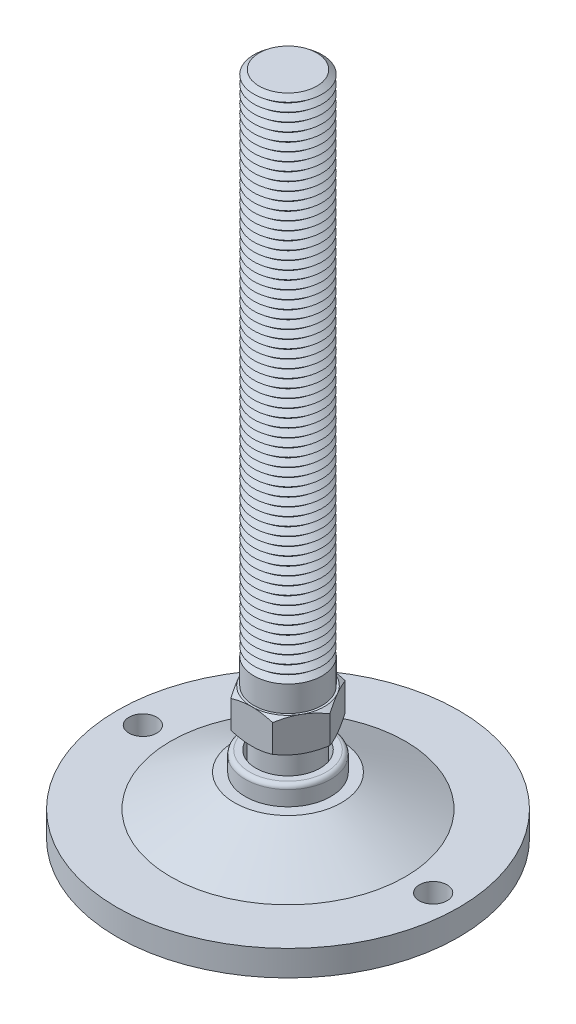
ISO-10303-21;
HEADER;
FILE_DESCRIPTION(('STEP AP214'),'2;1');
FILE_NAME('part.step','',(''),(''),'','','');
FILE_SCHEMA(('AUTOMOTIVE_DESIGN { 1 0 10303 214 1 1 1 1 }'));
ENDSEC;
DATA;
#1=APPLICATION_CONTEXT('core data for automotive mechanical design processes');
#2=APPLICATION_PROTOCOL_DEFINITION('international standard','automotive_design',2000,#1);
#3=PRODUCT_CONTEXT('',#1,'mechanical');
#4=PRODUCT('Part','Part','',(#3));
#5=PRODUCT_RELATED_PRODUCT_CATEGORY('part','',(#4));
#6=PRODUCT_DEFINITION_FORMATION('','',#4);
#7=PRODUCT_DEFINITION_CONTEXT('part definition',#1,'design');
#8=PRODUCT_DEFINITION('design','',#6,#7);
#9=PRODUCT_DEFINITION_SHAPE('','',#8);
#10=(LENGTH_UNIT() NAMED_UNIT(*) SI_UNIT(.MILLI.,.METRE.));
#11=(NAMED_UNIT(*) PLANE_ANGLE_UNIT() SI_UNIT($,.RADIAN.));
#12=(NAMED_UNIT(*) SI_UNIT($,.STERADIAN.) SOLID_ANGLE_UNIT());
#13=UNCERTAINTY_MEASURE_WITH_UNIT(LENGTH_MEASURE(1.E-05),#10,'distance_accuracy_value','');
#14=(GEOMETRIC_REPRESENTATION_CONTEXT(3) GLOBAL_UNCERTAINTY_ASSIGNED_CONTEXT((#13)) GLOBAL_UNIT_ASSIGNED_CONTEXT((#10,
#11,#12)) REPRESENTATION_CONTEXT('',''));
#15=CARTESIAN_POINT('',(0.,0.,0.));
#16=DIRECTION('',(0.,0.,1.));
#17=DIRECTION('',(1.,0.,0.));
#18=AXIS2_PLACEMENT_3D('',#15,#16,#17);
#19=CARTESIAN_POINT('',(0.,148.,0.));
#20=DIRECTION('',(0.,-1.,0.));
#21=DIRECTION('',(0.,0.,-1.));
#22=AXIS2_PLACEMENT_3D('',#19,#20,#21);
#23=CONICAL_SURFACE('',#22,6.75100040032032,0.895664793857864);
#24=CARTESIAN_POINT('',(0.,147.,0.));
#25=DIRECTION('',(0.,-1.,0.));
#26=DIRECTION('',(0.,0.,-1.));
#27=AXIS2_PLACEMENT_3D('',#24,#25,#26);
#28=CIRCLE('',#27,8.);
#29=CARTESIAN_POINT('',(0.,147.,-8.));
#30=VERTEX_POINT('',#29);
#31=EDGE_CURVE('P0_E2028',#30,#30,#28,.T.);
#32=ORIENTED_EDGE('',*,*,#31,.F.);
#33=EDGE_LOOP('',(#32));
#34=FACE_BOUND('',#33,.T.);
#35=CARTESIAN_POINT('',(0.,148.,0.));
#36=DIRECTION('',(0.,-1.,0.));
#37=DIRECTION('',(0.,0.,-1.));
#38=AXIS2_PLACEMENT_3D('',#35,#36,#37);
#39=CIRCLE('',#38,6.75100040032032);
#40=CARTESIAN_POINT('',(0.,148.,-6.75100040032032));
#41=VERTEX_POINT('',#40);
#42=EDGE_CURVE('P0_E2037',#41,#41,#39,.T.);
#43=ORIENTED_EDGE('',*,*,#42,.T.);
#44=EDGE_LOOP('',(#43));
#45=FACE_BOUND('',#44,.T.);
#46=ADVANCED_FACE('P0_F16',(#34,#45),#23,.T.);
#47=CARTESIAN_POINT('',(0.,149.,0.));
#48=DIRECTION('',(0.,1.,0.));
#49=DIRECTION('',(0.,0.,1.));
#50=AXIS2_PLACEMENT_3D('',#47,#48,#49);
#51=CONICAL_SURFACE('',#50,8.,0.895664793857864);
#52=ORIENTED_EDGE('',*,*,#42,.F.);
#53=EDGE_LOOP('',(#52));
#54=FACE_BOUND('',#53,.T.);
#55=CARTESIAN_POINT('',(0.,149.,0.));
#56=DIRECTION('',(0.,-1.,0.));
#57=DIRECTION('',(0.,0.,-1.));
#58=AXIS2_PLACEMENT_3D('',#55,#56,#57);
#59=CIRCLE('',#58,8.);
#60=CARTESIAN_POINT('',(0.,149.,-8.));
#61=VERTEX_POINT('',#60);
#62=EDGE_CURVE('P0_E2034',#61,#61,#59,.T.);
#63=ORIENTED_EDGE('',*,*,#62,.T.);
#64=EDGE_LOOP('',(#63));
#65=FACE_BOUND('',#64,.T.);
#66=ADVANCED_FACE('P0_F308',(#54,#65),#51,.T.);
#67=CARTESIAN_POINT('',(0.,156.,0.));
#68=DIRECTION('',(0.,1.,0.));
#69=DIRECTION('',(0.,0.,1.));
#70=AXIS2_PLACEMENT_3D('',#67,#68,#69);
#71=PLANE('',#70);
#72=CARTESIAN_POINT('',(0.,156.,0.));
#73=DIRECTION('',(0.,-1.,0.));
#74=DIRECTION('',(0.,0.,-1.));
#75=AXIS2_PLACEMENT_3D('',#72,#73,#74);
#76=CIRCLE('',#75,6.75100040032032);
#77=CARTESIAN_POINT('',(0.,156.,-6.75100040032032));
#78=VERTEX_POINT('',#77);
#79=EDGE_CURVE('P0_E143',#78,#78,#76,.T.);
#80=ORIENTED_EDGE('',*,*,#79,.F.);
#81=EDGE_LOOP('',(#80));
#82=FACE_BOUND('',#81,.T.);
#83=ADVANCED_FACE('P0_F314',(#82),#71,.T.);
#84=CARTESIAN_POINT('',(0.,156.,0.));
#85=DIRECTION('',(0.,-1.,0.));
#86=DIRECTION('',(0.,0.,-1.));
#87=AXIS2_PLACEMENT_3D('',#84,#85,#86);
#88=CONICAL_SURFACE('',#87,6.75100040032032,0.895664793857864);
#89=CARTESIAN_POINT('',(0.,155.,0.));
#90=DIRECTION('',(0.,-1.,0.));
#91=DIRECTION('',(0.,0.,-1.));
#92=AXIS2_PLACEMENT_3D('',#89,#90,#91);
#93=CIRCLE('',#92,8.);
#94=CARTESIAN_POINT('',(0.,155.,-8.));
#95=VERTEX_POINT('',#94);
#96=EDGE_CURVE('P0_E353',#95,#95,#93,.T.);
#97=ORIENTED_EDGE('',*,*,#96,.F.);
#98=EDGE_LOOP('',(#97));
#99=FACE_BOUND('',#98,.T.);
#100=ORIENTED_EDGE('',*,*,#79,.T.);
#101=EDGE_LOOP('',(#100));
#102=FACE_BOUND('',#101,.T.);
#103=ADVANCED_FACE('P0_F211',(#99,#102),#88,.T.);
#104=CARTESIAN_POINT('',(0.,155.,0.));
#105=DIRECTION('',(0.,1.,0.));
#106=DIRECTION('',(0.,0.,1.));
#107=AXIS2_PLACEMENT_3D('',#104,#105,#106);
#108=CONICAL_SURFACE('',#107,8.,0.895664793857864);
#109=CARTESIAN_POINT('',(0.,154.,0.));
#110=DIRECTION('',(0.,-1.,0.));
#111=DIRECTION('',(0.,0.,-1.));
#112=AXIS2_PLACEMENT_3D('',#109,#110,#111);
#113=CIRCLE('',#112,6.75100040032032);
#114=CARTESIAN_POINT('',(0.,154.,-6.75100040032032));
#115=VERTEX_POINT('',#114);
#116=EDGE_CURVE('P0_E352',#115,#115,#113,.T.);
#117=ORIENTED_EDGE('',*,*,#116,.F.);
#118=EDGE_LOOP('',(#117));
#119=FACE_BOUND('',#118,.T.);
#120=ORIENTED_EDGE('',*,*,#96,.T.);
#121=EDGE_LOOP('',(#120));
#122=FACE_BOUND('',#121,.T.);
#123=ADVANCED_FACE('P0_F339',(#119,#122),#108,.T.);
#124=CARTESIAN_POINT('',(0.,154.,0.));
#125=DIRECTION('',(0.,-1.,0.));
#126=DIRECTION('',(0.,0.,-1.));
#127=AXIS2_PLACEMENT_3D('',#124,#125,#126);
#128=CONICAL_SURFACE('',#127,6.75100040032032,0.895664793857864);
#129=CARTESIAN_POINT('',(0.,153.,0.));
#130=DIRECTION('',(0.,-1.,0.));
#131=DIRECTION('',(0.,0.,-1.));
#132=AXIS2_PLACEMENT_3D('',#129,#130,#131);
#133=CIRCLE('',#132,8.);
#134=CARTESIAN_POINT('',(0.,153.,-8.));
#135=VERTEX_POINT('',#134);
#136=EDGE_CURVE('P0_E349',#135,#135,#133,.T.);
#137=ORIENTED_EDGE('',*,*,#136,.F.);
#138=EDGE_LOOP('',(#137));
#139=FACE_BOUND('',#138,.T.);
#140=ORIENTED_EDGE('',*,*,#116,.T.);
#141=EDGE_LOOP('',(#140));
#142=FACE_BOUND('',#141,.T.);
#143=ADVANCED_FACE('P0_F334',(#139,#142),#128,.T.);
#144=CARTESIAN_POINT('',(0.,153.,0.));
#145=DIRECTION('',(0.,1.,0.));
#146=DIRECTION('',(0.,0.,1.));
#147=AXIS2_PLACEMENT_3D('',#144,#145,#146);
#148=CONICAL_SURFACE('',#147,8.,0.895664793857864);
#149=CARTESIAN_POINT('',(0.,152.,0.));
#150=DIRECTION('',(0.,-1.,0.));
#151=DIRECTION('',(0.,0.,-1.));
#152=AXIS2_PLACEMENT_3D('',#149,#150,#151);
#153=CIRCLE('',#152,6.75100040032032);
#154=CARTESIAN_POINT('',(0.,152.,-6.75100040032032));
#155=VERTEX_POINT('',#154);
#156=EDGE_CURVE('P0_E358',#155,#155,#153,.T.);
#157=ORIENTED_EDGE('',*,*,#156,.F.);
#158=EDGE_LOOP('',(#157));
#159=FACE_BOUND('',#158,.T.);
#160=ORIENTED_EDGE('',*,*,#136,.T.);
#161=EDGE_LOOP('',(#160));
#162=FACE_BOUND('',#161,.T.);
#163=ADVANCED_FACE('P0_F331',(#159,#162),#148,.T.);
#164=CARTESIAN_POINT('',(0.,152.,0.));
#165=DIRECTION('',(0.,-1.,0.));
#166=DIRECTION('',(0.,0.,-1.));
#167=AXIS2_PLACEMENT_3D('',#164,#165,#166);
#168=CONICAL_SURFACE('',#167,6.75100040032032,0.895664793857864);
#169=CARTESIAN_POINT('',(0.,151.,0.));
#170=DIRECTION('',(0.,-1.,0.));
#171=DIRECTION('',(0.,0.,-1.));
#172=AXIS2_PLACEMENT_3D('',#169,#170,#171);
#173=CIRCLE('',#172,8.);
#174=CARTESIAN_POINT('',(0.,151.,-8.));
#175=VERTEX_POINT('',#174);
#176=EDGE_CURVE('P0_E2040',#175,#175,#173,.T.);
#177=ORIENTED_EDGE('',*,*,#176,.F.);
#178=EDGE_LOOP('',(#177));
#179=FACE_BOUND('',#178,.T.);
#180=ORIENTED_EDGE('',*,*,#156,.T.);
#181=EDGE_LOOP('',(#180));
#182=FACE_BOUND('',#181,.T.);
#183=ADVANCED_FACE('P0_F325',(#179,#182),#168,.T.);
#184=CARTESIAN_POINT('',(0.,151.,0.));
#185=DIRECTION('',(0.,1.,0.));
#186=DIRECTION('',(0.,0.,1.));
#187=AXIS2_PLACEMENT_3D('',#184,#185,#186);
#188=CONICAL_SURFACE('',#187,8.,0.895664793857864);
#189=CARTESIAN_POINT('',(0.,150.,0.));
#190=DIRECTION('',(0.,-1.,0.));
#191=DIRECTION('',(0.,0.,-1.));
#192=AXIS2_PLACEMENT_3D('',#189,#190,#191);
#193=CIRCLE('',#192,6.75100040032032);
#194=CARTESIAN_POINT('',(0.,150.,-6.75100040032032));
#195=VERTEX_POINT('',#194);
#196=EDGE_CURVE('P0_E2043',#195,#195,#193,.T.);
#197=ORIENTED_EDGE('',*,*,#196,.F.);
#198=EDGE_LOOP('',(#197));
#199=FACE_BOUND('',#198,.T.);
#200=ORIENTED_EDGE('',*,*,#176,.T.);
#201=EDGE_LOOP('',(#200));
#202=FACE_BOUND('',#201,.T.);
#203=ADVANCED_FACE('P0_F321',(#199,#202),#188,.T.);
#204=CARTESIAN_POINT('',(0.,150.,0.));
#205=DIRECTION('',(0.,-1.,0.));
#206=DIRECTION('',(0.,0.,-1.));
#207=AXIS2_PLACEMENT_3D('',#204,#205,#206);
#208=CONICAL_SURFACE('',#207,6.75100040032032,0.895664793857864);
#209=ORIENTED_EDGE('',*,*,#62,.F.);
#210=EDGE_LOOP('',(#209));
#211=FACE_BOUND('',#210,.T.);
#212=ORIENTED_EDGE('',*,*,#196,.T.);
#213=EDGE_LOOP('',(#212));
#214=FACE_BOUND('',#213,.T.);
#215=ADVANCED_FACE('P0_F324',(#211,#214),#208,.T.);
#216=CARTESIAN_POINT('',(0.,146.,0.));
#217=DIRECTION('',(0.,-1.,0.));
#218=DIRECTION('',(0.,0.,-1.));
#219=AXIS2_PLACEMENT_3D('',#216,#217,#218);
#220=CONICAL_SURFACE('',#219,6.75100040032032,0.895664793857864);
#221=CARTESIAN_POINT('',(0.,145.,0.));
#222=DIRECTION('',(0.,-1.,0.));
#223=DIRECTION('',(0.,0.,-1.));
#224=AXIS2_PLACEMENT_3D('',#221,#222,#223);
#225=CIRCLE('',#224,8.);
#226=CARTESIAN_POINT('',(0.,145.,-8.));
#227=VERTEX_POINT('',#226);
#228=EDGE_CURVE('P0_E2022',#227,#227,#225,.T.);
#229=ORIENTED_EDGE('',*,*,#228,.F.);
#230=EDGE_LOOP('',(#229));
#231=FACE_BOUND('',#230,.T.);
#232=CARTESIAN_POINT('',(0.,146.,0.));
#233=DIRECTION('',(0.,-1.,0.));
#234=DIRECTION('',(0.,0.,-1.));
#235=AXIS2_PLACEMENT_3D('',#232,#233,#234);
#236=CIRCLE('',#235,6.75100040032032);
#237=CARTESIAN_POINT('',(0.,146.,-6.75100040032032));
#238=VERTEX_POINT('',#237);
#239=EDGE_CURVE('P0_E2031',#238,#238,#236,.T.);
#240=ORIENTED_EDGE('',*,*,#239,.T.);
#241=EDGE_LOOP('',(#240));
#242=FACE_BOUND('',#241,.T.);
#243=ADVANCED_FACE('P0_F329',(#231,#242),#220,.T.);
#244=CARTESIAN_POINT('',(0.,147.,0.));
#245=DIRECTION('',(0.,1.,0.));
#246=DIRECTION('',(0.,0.,1.));
#247=AXIS2_PLACEMENT_3D('',#244,#245,#246);
#248=CONICAL_SURFACE('',#247,8.,0.895664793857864);
#249=ORIENTED_EDGE('',*,*,#239,.F.);
#250=EDGE_LOOP('',(#249));
#251=FACE_BOUND('',#250,.T.);
#252=ORIENTED_EDGE('',*,*,#31,.T.);
#253=EDGE_LOOP('',(#252));
#254=FACE_BOUND('',#253,.T.);
#255=ADVANCED_FACE('P0_F1604',(#251,#254),#248,.T.);
#256=CARTESIAN_POINT('',(0.,144.,0.));
#257=DIRECTION('',(0.,-1.,0.));
#258=DIRECTION('',(0.,0.,-1.));
#259=AXIS2_PLACEMENT_3D('',#256,#257,#258);
#260=CONICAL_SURFACE('',#259,6.75100040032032,0.895664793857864);
#261=CARTESIAN_POINT('',(0.,143.,0.));
#262=DIRECTION('',(0.,-1.,0.));
#263=DIRECTION('',(0.,0.,-1.));
#264=AXIS2_PLACEMENT_3D('',#261,#262,#263);
#265=CIRCLE('',#264,8.);
#266=CARTESIAN_POINT('',(0.,143.,-8.));
#267=VERTEX_POINT('',#266);
#268=EDGE_CURVE('P0_E2016',#267,#267,#265,.T.);
#269=ORIENTED_EDGE('',*,*,#268,.F.);
#270=EDGE_LOOP('',(#269));
#271=FACE_BOUND('',#270,.T.);
#272=CARTESIAN_POINT('',(0.,144.,0.));
#273=DIRECTION('',(0.,-1.,0.));
#274=DIRECTION('',(0.,0.,-1.));
#275=AXIS2_PLACEMENT_3D('',#272,#273,#274);
#276=CIRCLE('',#275,6.75100040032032);
#277=CARTESIAN_POINT('',(0.,144.,-6.75100040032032));
#278=VERTEX_POINT('',#277);
#279=EDGE_CURVE('P0_E2025',#278,#278,#276,.T.);
#280=ORIENTED_EDGE('',*,*,#279,.T.);
#281=EDGE_LOOP('',(#280));
#282=FACE_BOUND('',#281,.T.);
#283=ADVANCED_FACE('P0_F1594',(#271,#282),#260,.T.);
#284=CARTESIAN_POINT('',(0.,145.,0.));
#285=DIRECTION('',(0.,1.,0.));
#286=DIRECTION('',(0.,0.,1.));
#287=AXIS2_PLACEMENT_3D('',#284,#285,#286);
#288=CONICAL_SURFACE('',#287,8.,0.895664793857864);
#289=ORIENTED_EDGE('',*,*,#279,.F.);
#290=EDGE_LOOP('',(#289));
#291=FACE_BOUND('',#290,.T.);
#292=ORIENTED_EDGE('',*,*,#228,.T.);
#293=EDGE_LOOP('',(#292));
#294=FACE_BOUND('',#293,.T.);
#295=ADVANCED_FACE('P0_F1584',(#291,#294),#288,.T.);
#296=CARTESIAN_POINT('',(0.,142.,0.));
#297=DIRECTION('',(0.,-1.,0.));
#298=DIRECTION('',(0.,0.,-1.));
#299=AXIS2_PLACEMENT_3D('',#296,#297,#298);
#300=CONICAL_SURFACE('',#299,6.75100040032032,0.895664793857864);
#301=CARTESIAN_POINT('',(0.,141.,0.));
#302=DIRECTION('',(0.,-1.,0.));
#303=DIRECTION('',(0.,0.,-1.));
#304=AXIS2_PLACEMENT_3D('',#301,#302,#303);
#305=CIRCLE('',#304,8.);
#306=CARTESIAN_POINT('',(0.,141.,-8.));
#307=VERTEX_POINT('',#306);
#308=EDGE_CURVE('P0_E2010',#307,#307,#305,.T.);
#309=ORIENTED_EDGE('',*,*,#308,.F.);
#310=EDGE_LOOP('',(#309));
#311=FACE_BOUND('',#310,.T.);
#312=CARTESIAN_POINT('',(0.,142.,0.));
#313=DIRECTION('',(0.,-1.,0.));
#314=DIRECTION('',(0.,0.,-1.));
#315=AXIS2_PLACEMENT_3D('',#312,#313,#314);
#316=CIRCLE('',#315,6.75100040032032);
#317=CARTESIAN_POINT('',(0.,142.,-6.75100040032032));
#318=VERTEX_POINT('',#317);
#319=EDGE_CURVE('P0_E2019',#318,#318,#316,.T.);
#320=ORIENTED_EDGE('',*,*,#319,.T.);
#321=EDGE_LOOP('',(#320));
#322=FACE_BOUND('',#321,.T.);
#323=ADVANCED_FACE('P0_F1574',(#311,#322),#300,.T.);
#324=CARTESIAN_POINT('',(0.,143.,0.));
#325=DIRECTION('',(0.,1.,0.));
#326=DIRECTION('',(0.,0.,1.));
#327=AXIS2_PLACEMENT_3D('',#324,#325,#326);
#328=CONICAL_SURFACE('',#327,8.,0.895664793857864);
#329=ORIENTED_EDGE('',*,*,#319,.F.);
#330=EDGE_LOOP('',(#329));
#331=FACE_BOUND('',#330,.T.);
#332=ORIENTED_EDGE('',*,*,#268,.T.);
#333=EDGE_LOOP('',(#332));
#334=FACE_BOUND('',#333,.T.);
#335=ADVANCED_FACE('P0_F1564',(#331,#334),#328,.T.);
#336=CARTESIAN_POINT('',(0.,140.,0.));
#337=DIRECTION('',(0.,-1.,0.));
#338=DIRECTION('',(0.,0.,-1.));
#339=AXIS2_PLACEMENT_3D('',#336,#337,#338);
#340=CONICAL_SURFACE('',#339,6.75100040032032,0.895664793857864);
#341=CARTESIAN_POINT('',(0.,139.,0.));
#342=DIRECTION('',(0.,-1.,0.));
#343=DIRECTION('',(0.,0.,-1.));
#344=AXIS2_PLACEMENT_3D('',#341,#342,#343);
#345=CIRCLE('',#344,8.);
#346=CARTESIAN_POINT('',(0.,139.,-8.));
#347=VERTEX_POINT('',#346);
#348=EDGE_CURVE('P0_E2004',#347,#347,#345,.T.);
#349=ORIENTED_EDGE('',*,*,#348,.F.);
#350=EDGE_LOOP('',(#349));
#351=FACE_BOUND('',#350,.T.);
#352=CARTESIAN_POINT('',(0.,140.,0.));
#353=DIRECTION('',(0.,-1.,0.));
#354=DIRECTION('',(0.,0.,-1.));
#355=AXIS2_PLACEMENT_3D('',#352,#353,#354);
#356=CIRCLE('',#355,6.75100040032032);
#357=CARTESIAN_POINT('',(0.,140.,-6.75100040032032));
#358=VERTEX_POINT('',#357);
#359=EDGE_CURVE('P0_E2013',#358,#358,#356,.T.);
#360=ORIENTED_EDGE('',*,*,#359,.T.);
#361=EDGE_LOOP('',(#360));
#362=FACE_BOUND('',#361,.T.);
#363=ADVANCED_FACE('P0_F1554',(#351,#362),#340,.T.);
#364=CARTESIAN_POINT('',(0.,141.,0.));
#365=DIRECTION('',(0.,1.,0.));
#366=DIRECTION('',(0.,0.,1.));
#367=AXIS2_PLACEMENT_3D('',#364,#365,#366);
#368=CONICAL_SURFACE('',#367,8.,0.895664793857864);
#369=ORIENTED_EDGE('',*,*,#359,.F.);
#370=EDGE_LOOP('',(#369));
#371=FACE_BOUND('',#370,.T.);
#372=ORIENTED_EDGE('',*,*,#308,.T.);
#373=EDGE_LOOP('',(#372));
#374=FACE_BOUND('',#373,.T.);
#375=ADVANCED_FACE('P0_F1544',(#371,#374),#368,.T.);
#376=CARTESIAN_POINT('',(0.,138.,0.));
#377=DIRECTION('',(0.,-1.,0.));
#378=DIRECTION('',(0.,0.,-1.));
#379=AXIS2_PLACEMENT_3D('',#376,#377,#378);
#380=CONICAL_SURFACE('',#379,6.75100040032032,0.895664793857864);
#381=CARTESIAN_POINT('',(0.,137.,0.));
#382=DIRECTION('',(0.,-1.,0.));
#383=DIRECTION('',(0.,0.,-1.));
#384=AXIS2_PLACEMENT_3D('',#381,#382,#383);
#385=CIRCLE('',#384,8.);
#386=CARTESIAN_POINT('',(0.,137.,-8.));
#387=VERTEX_POINT('',#386);
#388=EDGE_CURVE('P0_E1998',#387,#387,#385,.T.);
#389=ORIENTED_EDGE('',*,*,#388,.F.);
#390=EDGE_LOOP('',(#389));
#391=FACE_BOUND('',#390,.T.);
#392=CARTESIAN_POINT('',(0.,138.,0.));
#393=DIRECTION('',(0.,-1.,0.));
#394=DIRECTION('',(0.,0.,-1.));
#395=AXIS2_PLACEMENT_3D('',#392,#393,#394);
#396=CIRCLE('',#395,6.75100040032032);
#397=CARTESIAN_POINT('',(0.,138.,-6.75100040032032));
#398=VERTEX_POINT('',#397);
#399=EDGE_CURVE('P0_E2007',#398,#398,#396,.T.);
#400=ORIENTED_EDGE('',*,*,#399,.T.);
#401=EDGE_LOOP('',(#400));
#402=FACE_BOUND('',#401,.T.);
#403=ADVANCED_FACE('P0_F1534',(#391,#402),#380,.T.);
#404=CARTESIAN_POINT('',(0.,139.,0.));
#405=DIRECTION('',(0.,1.,0.));
#406=DIRECTION('',(0.,0.,1.));
#407=AXIS2_PLACEMENT_3D('',#404,#405,#406);
#408=CONICAL_SURFACE('',#407,8.,0.895664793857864);
#409=ORIENTED_EDGE('',*,*,#399,.F.);
#410=EDGE_LOOP('',(#409));
#411=FACE_BOUND('',#410,.T.);
#412=ORIENTED_EDGE('',*,*,#348,.T.);
#413=EDGE_LOOP('',(#412));
#414=FACE_BOUND('',#413,.T.);
#415=ADVANCED_FACE('P0_F1524',(#411,#414),#408,.T.);
#416=CARTESIAN_POINT('',(0.,136.,0.));
#417=DIRECTION('',(0.,-1.,0.));
#418=DIRECTION('',(0.,0.,-1.));
#419=AXIS2_PLACEMENT_3D('',#416,#417,#418);
#420=CONICAL_SURFACE('',#419,6.75100040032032,0.895664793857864);
#421=CARTESIAN_POINT('',(0.,135.,0.));
#422=DIRECTION('',(0.,-1.,0.));
#423=DIRECTION('',(0.,0.,-1.));
#424=AXIS2_PLACEMENT_3D('',#421,#422,#423);
#425=CIRCLE('',#424,8.);
#426=CARTESIAN_POINT('',(0.,135.,-8.));
#427=VERTEX_POINT('',#426);
#428=EDGE_CURVE('P0_E1992',#427,#427,#425,.T.);
#429=ORIENTED_EDGE('',*,*,#428,.F.);
#430=EDGE_LOOP('',(#429));
#431=FACE_BOUND('',#430,.T.);
#432=CARTESIAN_POINT('',(0.,136.,0.));
#433=DIRECTION('',(0.,-1.,0.));
#434=DIRECTION('',(0.,0.,-1.));
#435=AXIS2_PLACEMENT_3D('',#432,#433,#434);
#436=CIRCLE('',#435,6.75100040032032);
#437=CARTESIAN_POINT('',(0.,136.,-6.75100040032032));
#438=VERTEX_POINT('',#437);
#439=EDGE_CURVE('P0_E2001',#438,#438,#436,.T.);
#440=ORIENTED_EDGE('',*,*,#439,.T.);
#441=EDGE_LOOP('',(#440));
#442=FACE_BOUND('',#441,.T.);
#443=ADVANCED_FACE('P0_F1514',(#431,#442),#420,.T.);
#444=CARTESIAN_POINT('',(0.,137.,0.));
#445=DIRECTION('',(0.,1.,0.));
#446=DIRECTION('',(0.,0.,1.));
#447=AXIS2_PLACEMENT_3D('',#444,#445,#446);
#448=CONICAL_SURFACE('',#447,8.,0.895664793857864);
#449=ORIENTED_EDGE('',*,*,#439,.F.);
#450=EDGE_LOOP('',(#449));
#451=FACE_BOUND('',#450,.T.);
#452=ORIENTED_EDGE('',*,*,#388,.T.);
#453=EDGE_LOOP('',(#452));
#454=FACE_BOUND('',#453,.T.);
#455=ADVANCED_FACE('P0_F1504',(#451,#454),#448,.T.);
#456=CARTESIAN_POINT('',(0.,134.,0.));
#457=DIRECTION('',(0.,-1.,0.));
#458=DIRECTION('',(0.,0.,-1.));
#459=AXIS2_PLACEMENT_3D('',#456,#457,#458);
#460=CONICAL_SURFACE('',#459,6.75100040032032,0.895664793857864);
#461=CARTESIAN_POINT('',(0.,133.,0.));
#462=DIRECTION('',(0.,-1.,0.));
#463=DIRECTION('',(0.,0.,-1.));
#464=AXIS2_PLACEMENT_3D('',#461,#462,#463);
#465=CIRCLE('',#464,8.);
#466=CARTESIAN_POINT('',(0.,133.,-8.));
#467=VERTEX_POINT('',#466);
#468=EDGE_CURVE('P0_E1986',#467,#467,#465,.T.);
#469=ORIENTED_EDGE('',*,*,#468,.F.);
#470=EDGE_LOOP('',(#469));
#471=FACE_BOUND('',#470,.T.);
#472=CARTESIAN_POINT('',(0.,134.,0.));
#473=DIRECTION('',(0.,-1.,0.));
#474=DIRECTION('',(0.,0.,-1.));
#475=AXIS2_PLACEMENT_3D('',#472,#473,#474);
#476=CIRCLE('',#475,6.75100040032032);
#477=CARTESIAN_POINT('',(0.,134.,-6.75100040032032));
#478=VERTEX_POINT('',#477);
#479=EDGE_CURVE('P0_E1995',#478,#478,#476,.T.);
#480=ORIENTED_EDGE('',*,*,#479,.T.);
#481=EDGE_LOOP('',(#480));
#482=FACE_BOUND('',#481,.T.);
#483=ADVANCED_FACE('P0_F1494',(#471,#482),#460,.T.);
#484=CARTESIAN_POINT('',(0.,135.,0.));
#485=DIRECTION('',(0.,1.,0.));
#486=DIRECTION('',(0.,0.,1.));
#487=AXIS2_PLACEMENT_3D('',#484,#485,#486);
#488=CONICAL_SURFACE('',#487,8.,0.895664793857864);
#489=ORIENTED_EDGE('',*,*,#479,.F.);
#490=EDGE_LOOP('',(#489));
#491=FACE_BOUND('',#490,.T.);
#492=ORIENTED_EDGE('',*,*,#428,.T.);
#493=EDGE_LOOP('',(#492));
#494=FACE_BOUND('',#493,.T.);
#495=ADVANCED_FACE('P0_F1484',(#491,#494),#488,.T.);
#496=CARTESIAN_POINT('',(0.,132.,0.));
#497=DIRECTION('',(0.,-1.,0.));
#498=DIRECTION('',(0.,0.,-1.));
#499=AXIS2_PLACEMENT_3D('',#496,#497,#498);
#500=CONICAL_SURFACE('',#499,6.75100040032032,0.895664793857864);
#501=CARTESIAN_POINT('',(0.,131.,0.));
#502=DIRECTION('',(0.,-1.,0.));
#503=DIRECTION('',(0.,0.,-1.));
#504=AXIS2_PLACEMENT_3D('',#501,#502,#503);
#505=CIRCLE('',#504,8.);
#506=CARTESIAN_POINT('',(0.,131.,-8.));
#507=VERTEX_POINT('',#506);
#508=EDGE_CURVE('P0_E1980',#507,#507,#505,.T.);
#509=ORIENTED_EDGE('',*,*,#508,.F.);
#510=EDGE_LOOP('',(#509));
#511=FACE_BOUND('',#510,.T.);
#512=CARTESIAN_POINT('',(0.,132.,0.));
#513=DIRECTION('',(0.,-1.,0.));
#514=DIRECTION('',(0.,0.,-1.));
#515=AXIS2_PLACEMENT_3D('',#512,#513,#514);
#516=CIRCLE('',#515,6.75100040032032);
#517=CARTESIAN_POINT('',(0.,132.,-6.75100040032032));
#518=VERTEX_POINT('',#517);
#519=EDGE_CURVE('P0_E1989',#518,#518,#516,.T.);
#520=ORIENTED_EDGE('',*,*,#519,.T.);
#521=EDGE_LOOP('',(#520));
#522=FACE_BOUND('',#521,.T.);
#523=ADVANCED_FACE('P0_F1474',(#511,#522),#500,.T.);
#524=CARTESIAN_POINT('',(0.,133.,0.));
#525=DIRECTION('',(0.,1.,0.));
#526=DIRECTION('',(0.,0.,1.));
#527=AXIS2_PLACEMENT_3D('',#524,#525,#526);
#528=CONICAL_SURFACE('',#527,8.,0.895664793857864);
#529=ORIENTED_EDGE('',*,*,#519,.F.);
#530=EDGE_LOOP('',(#529));
#531=FACE_BOUND('',#530,.T.);
#532=ORIENTED_EDGE('',*,*,#468,.T.);
#533=EDGE_LOOP('',(#532));
#534=FACE_BOUND('',#533,.T.);
#535=ADVANCED_FACE('P0_F1464',(#531,#534),#528,.T.);
#536=CARTESIAN_POINT('',(0.,130.,0.));
#537=DIRECTION('',(0.,-1.,0.));
#538=DIRECTION('',(0.,0.,-1.));
#539=AXIS2_PLACEMENT_3D('',#536,#537,#538);
#540=CONICAL_SURFACE('',#539,6.75100040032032,0.895664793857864);
#541=CARTESIAN_POINT('',(0.,129.,0.));
#542=DIRECTION('',(0.,-1.,0.));
#543=DIRECTION('',(0.,0.,-1.));
#544=AXIS2_PLACEMENT_3D('',#541,#542,#543);
#545=CIRCLE('',#544,8.);
#546=CARTESIAN_POINT('',(0.,129.,-8.));
#547=VERTEX_POINT('',#546);
#548=EDGE_CURVE('P0_E1974',#547,#547,#545,.T.);
#549=ORIENTED_EDGE('',*,*,#548,.F.);
#550=EDGE_LOOP('',(#549));
#551=FACE_BOUND('',#550,.T.);
#552=CARTESIAN_POINT('',(0.,130.,0.));
#553=DIRECTION('',(0.,-1.,0.));
#554=DIRECTION('',(0.,0.,-1.));
#555=AXIS2_PLACEMENT_3D('',#552,#553,#554);
#556=CIRCLE('',#555,6.75100040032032);
#557=CARTESIAN_POINT('',(0.,130.,-6.75100040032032));
#558=VERTEX_POINT('',#557);
#559=EDGE_CURVE('P0_E1983',#558,#558,#556,.T.);
#560=ORIENTED_EDGE('',*,*,#559,.T.);
#561=EDGE_LOOP('',(#560));
#562=FACE_BOUND('',#561,.T.);
#563=ADVANCED_FACE('P0_F1454',(#551,#562),#540,.T.);
#564=CARTESIAN_POINT('',(0.,131.,0.));
#565=DIRECTION('',(0.,1.,0.));
#566=DIRECTION('',(0.,0.,1.));
#567=AXIS2_PLACEMENT_3D('',#564,#565,#566);
#568=CONICAL_SURFACE('',#567,8.,0.895664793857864);
#569=ORIENTED_EDGE('',*,*,#559,.F.);
#570=EDGE_LOOP('',(#569));
#571=FACE_BOUND('',#570,.T.);
#572=ORIENTED_EDGE('',*,*,#508,.T.);
#573=EDGE_LOOP('',(#572));
#574=FACE_BOUND('',#573,.T.);
#575=ADVANCED_FACE('P0_F1444',(#571,#574),#568,.T.);
#576=CARTESIAN_POINT('',(0.,128.,0.));
#577=DIRECTION('',(0.,-1.,0.));
#578=DIRECTION('',(0.,0.,-1.));
#579=AXIS2_PLACEMENT_3D('',#576,#577,#578);
#580=CONICAL_SURFACE('',#579,6.75100040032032,0.895664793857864);
#581=CARTESIAN_POINT('',(0.,127.,0.));
#582=DIRECTION('',(0.,-1.,0.));
#583=DIRECTION('',(0.,0.,-1.));
#584=AXIS2_PLACEMENT_3D('',#581,#582,#583);
#585=CIRCLE('',#584,8.);
#586=CARTESIAN_POINT('',(0.,127.,-8.));
#587=VERTEX_POINT('',#586);
#588=EDGE_CURVE('P0_E1968',#587,#587,#585,.T.);
#589=ORIENTED_EDGE('',*,*,#588,.F.);
#590=EDGE_LOOP('',(#589));
#591=FACE_BOUND('',#590,.T.);
#592=CARTESIAN_POINT('',(0.,128.,0.));
#593=DIRECTION('',(0.,-1.,0.));
#594=DIRECTION('',(0.,0.,-1.));
#595=AXIS2_PLACEMENT_3D('',#592,#593,#594);
#596=CIRCLE('',#595,6.75100040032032);
#597=CARTESIAN_POINT('',(0.,128.,-6.75100040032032));
#598=VERTEX_POINT('',#597);
#599=EDGE_CURVE('P0_E1977',#598,#598,#596,.T.);
#600=ORIENTED_EDGE('',*,*,#599,.T.);
#601=EDGE_LOOP('',(#600));
#602=FACE_BOUND('',#601,.T.);
#603=ADVANCED_FACE('P0_F1434',(#591,#602),#580,.T.);
#604=CARTESIAN_POINT('',(0.,129.,0.));
#605=DIRECTION('',(0.,1.,0.));
#606=DIRECTION('',(0.,0.,1.));
#607=AXIS2_PLACEMENT_3D('',#604,#605,#606);
#608=CONICAL_SURFACE('',#607,8.,0.895664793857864);
#609=ORIENTED_EDGE('',*,*,#599,.F.);
#610=EDGE_LOOP('',(#609));
#611=FACE_BOUND('',#610,.T.);
#612=ORIENTED_EDGE('',*,*,#548,.T.);
#613=EDGE_LOOP('',(#612));
#614=FACE_BOUND('',#613,.T.);
#615=ADVANCED_FACE('P0_F1424',(#611,#614),#608,.T.);
#616=CARTESIAN_POINT('',(0.,126.,0.));
#617=DIRECTION('',(0.,-1.,0.));
#618=DIRECTION('',(0.,0.,-1.));
#619=AXIS2_PLACEMENT_3D('',#616,#617,#618);
#620=CONICAL_SURFACE('',#619,6.75100040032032,0.895664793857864);
#621=CARTESIAN_POINT('',(0.,125.,0.));
#622=DIRECTION('',(0.,-1.,0.));
#623=DIRECTION('',(0.,0.,-1.));
#624=AXIS2_PLACEMENT_3D('',#621,#622,#623);
#625=CIRCLE('',#624,8.);
#626=CARTESIAN_POINT('',(0.,125.,-8.));
#627=VERTEX_POINT('',#626);
#628=EDGE_CURVE('P0_E1962',#627,#627,#625,.T.);
#629=ORIENTED_EDGE('',*,*,#628,.F.);
#630=EDGE_LOOP('',(#629));
#631=FACE_BOUND('',#630,.T.);
#632=CARTESIAN_POINT('',(0.,126.,0.));
#633=DIRECTION('',(0.,-1.,0.));
#634=DIRECTION('',(0.,0.,-1.));
#635=AXIS2_PLACEMENT_3D('',#632,#633,#634);
#636=CIRCLE('',#635,6.75100040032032);
#637=CARTESIAN_POINT('',(0.,126.,-6.75100040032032));
#638=VERTEX_POINT('',#637);
#639=EDGE_CURVE('P0_E1971',#638,#638,#636,.T.);
#640=ORIENTED_EDGE('',*,*,#639,.T.);
#641=EDGE_LOOP('',(#640));
#642=FACE_BOUND('',#641,.T.);
#643=ADVANCED_FACE('P0_F1414',(#631,#642),#620,.T.);
#644=CARTESIAN_POINT('',(0.,127.,0.));
#645=DIRECTION('',(0.,1.,0.));
#646=DIRECTION('',(0.,0.,1.));
#647=AXIS2_PLACEMENT_3D('',#644,#645,#646);
#648=CONICAL_SURFACE('',#647,8.,0.895664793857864);
#649=ORIENTED_EDGE('',*,*,#639,.F.);
#650=EDGE_LOOP('',(#649));
#651=FACE_BOUND('',#650,.T.);
#652=ORIENTED_EDGE('',*,*,#588,.T.);
#653=EDGE_LOOP('',(#652));
#654=FACE_BOUND('',#653,.T.);
#655=ADVANCED_FACE('P0_F1404',(#651,#654),#648,.T.);
#656=CARTESIAN_POINT('',(0.,124.,0.));
#657=DIRECTION('',(0.,-1.,0.));
#658=DIRECTION('',(0.,0.,-1.));
#659=AXIS2_PLACEMENT_3D('',#656,#657,#658);
#660=CONICAL_SURFACE('',#659,6.75100040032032,0.895664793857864);
#661=CARTESIAN_POINT('',(0.,123.,0.));
#662=DIRECTION('',(0.,-1.,0.));
#663=DIRECTION('',(0.,0.,-1.));
#664=AXIS2_PLACEMENT_3D('',#661,#662,#663);
#665=CIRCLE('',#664,8.);
#666=CARTESIAN_POINT('',(0.,123.,-8.));
#667=VERTEX_POINT('',#666);
#668=EDGE_CURVE('P0_E1956',#667,#667,#665,.T.);
#669=ORIENTED_EDGE('',*,*,#668,.F.);
#670=EDGE_LOOP('',(#669));
#671=FACE_BOUND('',#670,.T.);
#672=CARTESIAN_POINT('',(0.,124.,0.));
#673=DIRECTION('',(0.,-1.,0.));
#674=DIRECTION('',(0.,0.,-1.));
#675=AXIS2_PLACEMENT_3D('',#672,#673,#674);
#676=CIRCLE('',#675,6.75100040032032);
#677=CARTESIAN_POINT('',(0.,124.,-6.75100040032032));
#678=VERTEX_POINT('',#677);
#679=EDGE_CURVE('P0_E1965',#678,#678,#676,.T.);
#680=ORIENTED_EDGE('',*,*,#679,.T.);
#681=EDGE_LOOP('',(#680));
#682=FACE_BOUND('',#681,.T.);
#683=ADVANCED_FACE('P0_F1394',(#671,#682),#660,.T.);
#684=CARTESIAN_POINT('',(0.,125.,0.));
#685=DIRECTION('',(0.,1.,0.));
#686=DIRECTION('',(0.,0.,1.));
#687=AXIS2_PLACEMENT_3D('',#684,#685,#686);
#688=CONICAL_SURFACE('',#687,8.,0.895664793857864);
#689=ORIENTED_EDGE('',*,*,#679,.F.);
#690=EDGE_LOOP('',(#689));
#691=FACE_BOUND('',#690,.T.);
#692=ORIENTED_EDGE('',*,*,#628,.T.);
#693=EDGE_LOOP('',(#692));
#694=FACE_BOUND('',#693,.T.);
#695=ADVANCED_FACE('P0_F1384',(#691,#694),#688,.T.);
#696=CARTESIAN_POINT('',(0.,122.,0.));
#697=DIRECTION('',(0.,-1.,0.));
#698=DIRECTION('',(0.,0.,-1.));
#699=AXIS2_PLACEMENT_3D('',#696,#697,#698);
#700=CONICAL_SURFACE('',#699,6.75100040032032,0.895664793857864);
#701=CARTESIAN_POINT('',(0.,121.,0.));
#702=DIRECTION('',(0.,-1.,0.));
#703=DIRECTION('',(0.,0.,-1.));
#704=AXIS2_PLACEMENT_3D('',#701,#702,#703);
#705=CIRCLE('',#704,8.);
#706=CARTESIAN_POINT('',(0.,121.,-8.));
#707=VERTEX_POINT('',#706);
#708=EDGE_CURVE('P0_E1950',#707,#707,#705,.T.);
#709=ORIENTED_EDGE('',*,*,#708,.F.);
#710=EDGE_LOOP('',(#709));
#711=FACE_BOUND('',#710,.T.);
#712=CARTESIAN_POINT('',(0.,122.,0.));
#713=DIRECTION('',(0.,-1.,0.));
#714=DIRECTION('',(0.,0.,-1.));
#715=AXIS2_PLACEMENT_3D('',#712,#713,#714);
#716=CIRCLE('',#715,6.75100040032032);
#717=CARTESIAN_POINT('',(0.,122.,-6.75100040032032));
#718=VERTEX_POINT('',#717);
#719=EDGE_CURVE('P0_E1959',#718,#718,#716,.T.);
#720=ORIENTED_EDGE('',*,*,#719,.T.);
#721=EDGE_LOOP('',(#720));
#722=FACE_BOUND('',#721,.T.);
#723=ADVANCED_FACE('P0_F1374',(#711,#722),#700,.T.);
#724=CARTESIAN_POINT('',(0.,123.,0.));
#725=DIRECTION('',(0.,1.,0.));
#726=DIRECTION('',(0.,0.,1.));
#727=AXIS2_PLACEMENT_3D('',#724,#725,#726);
#728=CONICAL_SURFACE('',#727,8.,0.895664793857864);
#729=ORIENTED_EDGE('',*,*,#719,.F.);
#730=EDGE_LOOP('',(#729));
#731=FACE_BOUND('',#730,.T.);
#732=ORIENTED_EDGE('',*,*,#668,.T.);
#733=EDGE_LOOP('',(#732));
#734=FACE_BOUND('',#733,.T.);
#735=ADVANCED_FACE('P0_F1364',(#731,#734),#728,.T.);
#736=CARTESIAN_POINT('',(0.,120.,0.));
#737=DIRECTION('',(0.,-1.,0.));
#738=DIRECTION('',(0.,0.,-1.));
#739=AXIS2_PLACEMENT_3D('',#736,#737,#738);
#740=CONICAL_SURFACE('',#739,6.75100040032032,0.895664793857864);
#741=CARTESIAN_POINT('',(0.,119.,0.));
#742=DIRECTION('',(0.,-1.,0.));
#743=DIRECTION('',(0.,0.,-1.));
#744=AXIS2_PLACEMENT_3D('',#741,#742,#743);
#745=CIRCLE('',#744,8.);
#746=CARTESIAN_POINT('',(0.,119.,-8.));
#747=VERTEX_POINT('',#746);
#748=EDGE_CURVE('P0_E1944',#747,#747,#745,.T.);
#749=ORIENTED_EDGE('',*,*,#748,.F.);
#750=EDGE_LOOP('',(#749));
#751=FACE_BOUND('',#750,.T.);
#752=CARTESIAN_POINT('',(0.,120.,0.));
#753=DIRECTION('',(0.,-1.,0.));
#754=DIRECTION('',(0.,0.,-1.));
#755=AXIS2_PLACEMENT_3D('',#752,#753,#754);
#756=CIRCLE('',#755,6.75100040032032);
#757=CARTESIAN_POINT('',(0.,120.,-6.75100040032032));
#758=VERTEX_POINT('',#757);
#759=EDGE_CURVE('P0_E1953',#758,#758,#756,.T.);
#760=ORIENTED_EDGE('',*,*,#759,.T.);
#761=EDGE_LOOP('',(#760));
#762=FACE_BOUND('',#761,.T.);
#763=ADVANCED_FACE('P0_F1354',(#751,#762),#740,.T.);
#764=CARTESIAN_POINT('',(0.,121.,0.));
#765=DIRECTION('',(0.,1.,0.));
#766=DIRECTION('',(0.,0.,1.));
#767=AXIS2_PLACEMENT_3D('',#764,#765,#766);
#768=CONICAL_SURFACE('',#767,8.,0.895664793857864);
#769=ORIENTED_EDGE('',*,*,#759,.F.);
#770=EDGE_LOOP('',(#769));
#771=FACE_BOUND('',#770,.T.);
#772=ORIENTED_EDGE('',*,*,#708,.T.);
#773=EDGE_LOOP('',(#772));
#774=FACE_BOUND('',#773,.T.);
#775=ADVANCED_FACE('P0_F1344',(#771,#774),#768,.T.);
#776=CARTESIAN_POINT('',(0.,118.,0.));
#777=DIRECTION('',(0.,-1.,0.));
#778=DIRECTION('',(0.,0.,-1.));
#779=AXIS2_PLACEMENT_3D('',#776,#777,#778);
#780=CONICAL_SURFACE('',#779,6.75100040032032,0.895664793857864);
#781=CARTESIAN_POINT('',(0.,117.,0.));
#782=DIRECTION('',(0.,-1.,0.));
#783=DIRECTION('',(0.,0.,-1.));
#784=AXIS2_PLACEMENT_3D('',#781,#782,#783);
#785=CIRCLE('',#784,8.);
#786=CARTESIAN_POINT('',(0.,117.,-8.));
#787=VERTEX_POINT('',#786);
#788=EDGE_CURVE('P0_E1938',#787,#787,#785,.T.);
#789=ORIENTED_EDGE('',*,*,#788,.F.);
#790=EDGE_LOOP('',(#789));
#791=FACE_BOUND('',#790,.T.);
#792=CARTESIAN_POINT('',(0.,118.,0.));
#793=DIRECTION('',(0.,-1.,0.));
#794=DIRECTION('',(0.,0.,-1.));
#795=AXIS2_PLACEMENT_3D('',#792,#793,#794);
#796=CIRCLE('',#795,6.75100040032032);
#797=CARTESIAN_POINT('',(0.,118.,-6.75100040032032));
#798=VERTEX_POINT('',#797);
#799=EDGE_CURVE('P0_E1947',#798,#798,#796,.T.);
#800=ORIENTED_EDGE('',*,*,#799,.T.);
#801=EDGE_LOOP('',(#800));
#802=FACE_BOUND('',#801,.T.);
#803=ADVANCED_FACE('P0_F1334',(#791,#802),#780,.T.);
#804=CARTESIAN_POINT('',(0.,119.,0.));
#805=DIRECTION('',(0.,1.,0.));
#806=DIRECTION('',(0.,0.,1.));
#807=AXIS2_PLACEMENT_3D('',#804,#805,#806);
#808=CONICAL_SURFACE('',#807,8.,0.895664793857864);
#809=ORIENTED_EDGE('',*,*,#799,.F.);
#810=EDGE_LOOP('',(#809));
#811=FACE_BOUND('',#810,.T.);
#812=ORIENTED_EDGE('',*,*,#748,.T.);
#813=EDGE_LOOP('',(#812));
#814=FACE_BOUND('',#813,.T.);
#815=ADVANCED_FACE('P0_F1324',(#811,#814),#808,.T.);
#816=CARTESIAN_POINT('',(0.,116.,0.));
#817=DIRECTION('',(0.,-1.,0.));
#818=DIRECTION('',(0.,0.,-1.));
#819=AXIS2_PLACEMENT_3D('',#816,#817,#818);
#820=CONICAL_SURFACE('',#819,6.75100040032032,0.895664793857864);
#821=CARTESIAN_POINT('',(0.,115.,0.));
#822=DIRECTION('',(0.,-1.,0.));
#823=DIRECTION('',(0.,0.,-1.));
#824=AXIS2_PLACEMENT_3D('',#821,#822,#823);
#825=CIRCLE('',#824,8.);
#826=CARTESIAN_POINT('',(0.,115.,-8.));
#827=VERTEX_POINT('',#826);
#828=EDGE_CURVE('P0_E1932',#827,#827,#825,.T.);
#829=ORIENTED_EDGE('',*,*,#828,.F.);
#830=EDGE_LOOP('',(#829));
#831=FACE_BOUND('',#830,.T.);
#832=CARTESIAN_POINT('',(0.,116.,0.));
#833=DIRECTION('',(0.,-1.,0.));
#834=DIRECTION('',(0.,0.,-1.));
#835=AXIS2_PLACEMENT_3D('',#832,#833,#834);
#836=CIRCLE('',#835,6.75100040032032);
#837=CARTESIAN_POINT('',(0.,116.,-6.75100040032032));
#838=VERTEX_POINT('',#837);
#839=EDGE_CURVE('P0_E1941',#838,#838,#836,.T.);
#840=ORIENTED_EDGE('',*,*,#839,.T.);
#841=EDGE_LOOP('',(#840));
#842=FACE_BOUND('',#841,.T.);
#843=ADVANCED_FACE('P0_F1314',(#831,#842),#820,.T.);
#844=CARTESIAN_POINT('',(0.,117.,0.));
#845=DIRECTION('',(0.,1.,0.));
#846=DIRECTION('',(0.,0.,1.));
#847=AXIS2_PLACEMENT_3D('',#844,#845,#846);
#848=CONICAL_SURFACE('',#847,8.,0.895664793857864);
#849=ORIENTED_EDGE('',*,*,#839,.F.);
#850=EDGE_LOOP('',(#849));
#851=FACE_BOUND('',#850,.T.);
#852=ORIENTED_EDGE('',*,*,#788,.T.);
#853=EDGE_LOOP('',(#852));
#854=FACE_BOUND('',#853,.T.);
#855=ADVANCED_FACE('P0_F1304',(#851,#854),#848,.T.);
#856=CARTESIAN_POINT('',(0.,114.,0.));
#857=DIRECTION('',(0.,-1.,0.));
#858=DIRECTION('',(0.,0.,-1.));
#859=AXIS2_PLACEMENT_3D('',#856,#857,#858);
#860=CONICAL_SURFACE('',#859,6.75100040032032,0.895664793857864);
#861=CARTESIAN_POINT('',(0.,113.,0.));
#862=DIRECTION('',(0.,-1.,0.));
#863=DIRECTION('',(0.,0.,-1.));
#864=AXIS2_PLACEMENT_3D('',#861,#862,#863);
#865=CIRCLE('',#864,8.);
#866=CARTESIAN_POINT('',(0.,113.,-8.));
#867=VERTEX_POINT('',#866);
#868=EDGE_CURVE('P0_E1926',#867,#867,#865,.T.);
#869=ORIENTED_EDGE('',*,*,#868,.F.);
#870=EDGE_LOOP('',(#869));
#871=FACE_BOUND('',#870,.T.);
#872=CARTESIAN_POINT('',(0.,114.,0.));
#873=DIRECTION('',(0.,-1.,0.));
#874=DIRECTION('',(0.,0.,-1.));
#875=AXIS2_PLACEMENT_3D('',#872,#873,#874);
#876=CIRCLE('',#875,6.75100040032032);
#877=CARTESIAN_POINT('',(0.,114.,-6.75100040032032));
#878=VERTEX_POINT('',#877);
#879=EDGE_CURVE('P0_E1935',#878,#878,#876,.T.);
#880=ORIENTED_EDGE('',*,*,#879,.T.);
#881=EDGE_LOOP('',(#880));
#882=FACE_BOUND('',#881,.T.);
#883=ADVANCED_FACE('P0_F1294',(#871,#882),#860,.T.);
#884=CARTESIAN_POINT('',(0.,115.,0.));
#885=DIRECTION('',(0.,1.,0.));
#886=DIRECTION('',(0.,0.,1.));
#887=AXIS2_PLACEMENT_3D('',#884,#885,#886);
#888=CONICAL_SURFACE('',#887,8.,0.895664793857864);
#889=ORIENTED_EDGE('',*,*,#879,.F.);
#890=EDGE_LOOP('',(#889));
#891=FACE_BOUND('',#890,.T.);
#892=ORIENTED_EDGE('',*,*,#828,.T.);
#893=EDGE_LOOP('',(#892));
#894=FACE_BOUND('',#893,.T.);
#895=ADVANCED_FACE('P0_F1284',(#891,#894),#888,.T.);
#896=CARTESIAN_POINT('',(0.,112.,0.));
#897=DIRECTION('',(0.,-1.,0.));
#898=DIRECTION('',(0.,0.,-1.));
#899=AXIS2_PLACEMENT_3D('',#896,#897,#898);
#900=CONICAL_SURFACE('',#899,6.75100040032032,0.895664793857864);
#901=CARTESIAN_POINT('',(0.,111.,0.));
#902=DIRECTION('',(0.,-1.,0.));
#903=DIRECTION('',(0.,0.,-1.));
#904=AXIS2_PLACEMENT_3D('',#901,#902,#903);
#905=CIRCLE('',#904,8.);
#906=CARTESIAN_POINT('',(0.,111.,-8.));
#907=VERTEX_POINT('',#906);
#908=EDGE_CURVE('P0_E1920',#907,#907,#905,.T.);
#909=ORIENTED_EDGE('',*,*,#908,.F.);
#910=EDGE_LOOP('',(#909));
#911=FACE_BOUND('',#910,.T.);
#912=CARTESIAN_POINT('',(0.,112.,0.));
#913=DIRECTION('',(0.,-1.,0.));
#914=DIRECTION('',(0.,0.,-1.));
#915=AXIS2_PLACEMENT_3D('',#912,#913,#914);
#916=CIRCLE('',#915,6.75100040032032);
#917=CARTESIAN_POINT('',(0.,112.,-6.75100040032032));
#918=VERTEX_POINT('',#917);
#919=EDGE_CURVE('P0_E1929',#918,#918,#916,.T.);
#920=ORIENTED_EDGE('',*,*,#919,.T.);
#921=EDGE_LOOP('',(#920));
#922=FACE_BOUND('',#921,.T.);
#923=ADVANCED_FACE('P0_F1274',(#911,#922),#900,.T.);
#924=CARTESIAN_POINT('',(0.,113.,0.));
#925=DIRECTION('',(0.,1.,0.));
#926=DIRECTION('',(0.,0.,1.));
#927=AXIS2_PLACEMENT_3D('',#924,#925,#926);
#928=CONICAL_SURFACE('',#927,8.,0.895664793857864);
#929=ORIENTED_EDGE('',*,*,#919,.F.);
#930=EDGE_LOOP('',(#929));
#931=FACE_BOUND('',#930,.T.);
#932=ORIENTED_EDGE('',*,*,#868,.T.);
#933=EDGE_LOOP('',(#932));
#934=FACE_BOUND('',#933,.T.);
#935=ADVANCED_FACE('P0_F1264',(#931,#934),#928,.T.);
#936=CARTESIAN_POINT('',(0.,110.,0.));
#937=DIRECTION('',(0.,-1.,0.));
#938=DIRECTION('',(0.,0.,-1.));
#939=AXIS2_PLACEMENT_3D('',#936,#937,#938);
#940=CONICAL_SURFACE('',#939,6.75100040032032,0.895664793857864);
#941=CARTESIAN_POINT('',(0.,109.,0.));
#942=DIRECTION('',(0.,-1.,0.));
#943=DIRECTION('',(0.,0.,-1.));
#944=AXIS2_PLACEMENT_3D('',#941,#942,#943);
#945=CIRCLE('',#944,8.);
#946=CARTESIAN_POINT('',(0.,109.,-8.));
#947=VERTEX_POINT('',#946);
#948=EDGE_CURVE('P0_E1914',#947,#947,#945,.T.);
#949=ORIENTED_EDGE('',*,*,#948,.F.);
#950=EDGE_LOOP('',(#949));
#951=FACE_BOUND('',#950,.T.);
#952=CARTESIAN_POINT('',(0.,110.,0.));
#953=DIRECTION('',(0.,-1.,0.));
#954=DIRECTION('',(0.,0.,-1.));
#955=AXIS2_PLACEMENT_3D('',#952,#953,#954);
#956=CIRCLE('',#955,6.75100040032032);
#957=CARTESIAN_POINT('',(0.,110.,-6.75100040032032));
#958=VERTEX_POINT('',#957);
#959=EDGE_CURVE('P0_E1923',#958,#958,#956,.T.);
#960=ORIENTED_EDGE('',*,*,#959,.T.);
#961=EDGE_LOOP('',(#960));
#962=FACE_BOUND('',#961,.T.);
#963=ADVANCED_FACE('P0_F1254',(#951,#962),#940,.T.);
#964=CARTESIAN_POINT('',(0.,111.,0.));
#965=DIRECTION('',(0.,1.,0.));
#966=DIRECTION('',(0.,0.,1.));
#967=AXIS2_PLACEMENT_3D('',#964,#965,#966);
#968=CONICAL_SURFACE('',#967,8.,0.895664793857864);
#969=ORIENTED_EDGE('',*,*,#959,.F.);
#970=EDGE_LOOP('',(#969));
#971=FACE_BOUND('',#970,.T.);
#972=ORIENTED_EDGE('',*,*,#908,.T.);
#973=EDGE_LOOP('',(#972));
#974=FACE_BOUND('',#973,.T.);
#975=ADVANCED_FACE('P0_F1244',(#971,#974),#968,.T.);
#976=CARTESIAN_POINT('',(0.,108.,0.));
#977=DIRECTION('',(0.,-1.,0.));
#978=DIRECTION('',(0.,0.,-1.));
#979=AXIS2_PLACEMENT_3D('',#976,#977,#978);
#980=CONICAL_SURFACE('',#979,6.75100040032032,0.895664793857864);
#981=CARTESIAN_POINT('',(0.,107.,0.));
#982=DIRECTION('',(0.,-1.,0.));
#983=DIRECTION('',(0.,0.,-1.));
#984=AXIS2_PLACEMENT_3D('',#981,#982,#983);
#985=CIRCLE('',#984,8.);
#986=CARTESIAN_POINT('',(0.,107.,-8.));
#987=VERTEX_POINT('',#986);
#988=EDGE_CURVE('P0_E1908',#987,#987,#985,.T.);
#989=ORIENTED_EDGE('',*,*,#988,.F.);
#990=EDGE_LOOP('',(#989));
#991=FACE_BOUND('',#990,.T.);
#992=CARTESIAN_POINT('',(0.,108.,0.));
#993=DIRECTION('',(0.,-1.,0.));
#994=DIRECTION('',(0.,0.,-1.));
#995=AXIS2_PLACEMENT_3D('',#992,#993,#994);
#996=CIRCLE('',#995,6.75100040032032);
#997=CARTESIAN_POINT('',(0.,108.,-6.75100040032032));
#998=VERTEX_POINT('',#997);
#999=EDGE_CURVE('P0_E1917',#998,#998,#996,.T.);
#1000=ORIENTED_EDGE('',*,*,#999,.T.);
#1001=EDGE_LOOP('',(#1000));
#1002=FACE_BOUND('',#1001,.T.);
#1003=ADVANCED_FACE('P0_F1234',(#991,#1002),#980,.T.);
#1004=CARTESIAN_POINT('',(0.,109.,0.));
#1005=DIRECTION('',(0.,1.,0.));
#1006=DIRECTION('',(0.,0.,1.));
#1007=AXIS2_PLACEMENT_3D('',#1004,#1005,#1006);
#1008=CONICAL_SURFACE('',#1007,8.,0.895664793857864);
#1009=ORIENTED_EDGE('',*,*,#999,.F.);
#1010=EDGE_LOOP('',(#1009));
#1011=FACE_BOUND('',#1010,.T.);
#1012=ORIENTED_EDGE('',*,*,#948,.T.);
#1013=EDGE_LOOP('',(#1012));
#1014=FACE_BOUND('',#1013,.T.);
#1015=ADVANCED_FACE('P0_F1224',(#1011,#1014),#1008,.T.);
#1016=CARTESIAN_POINT('',(0.,106.,0.));
#1017=DIRECTION('',(0.,-1.,0.));
#1018=DIRECTION('',(0.,0.,-1.));
#1019=AXIS2_PLACEMENT_3D('',#1016,#1017,#1018);
#1020=CONICAL_SURFACE('',#1019,6.75100040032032,0.895664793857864);
#1021=CARTESIAN_POINT('',(0.,105.,0.));
#1022=DIRECTION('',(0.,-1.,0.));
#1023=DIRECTION('',(0.,0.,-1.));
#1024=AXIS2_PLACEMENT_3D('',#1021,#1022,#1023);
#1025=CIRCLE('',#1024,8.);
#1026=CARTESIAN_POINT('',(0.,105.,-8.));
#1027=VERTEX_POINT('',#1026);
#1028=EDGE_CURVE('P0_E1902',#1027,#1027,#1025,.T.);
#1029=ORIENTED_EDGE('',*,*,#1028,.F.);
#1030=EDGE_LOOP('',(#1029));
#1031=FACE_BOUND('',#1030,.T.);
#1032=CARTESIAN_POINT('',(0.,106.,0.));
#1033=DIRECTION('',(0.,-1.,0.));
#1034=DIRECTION('',(0.,0.,-1.));
#1035=AXIS2_PLACEMENT_3D('',#1032,#1033,#1034);
#1036=CIRCLE('',#1035,6.75100040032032);
#1037=CARTESIAN_POINT('',(0.,106.,-6.75100040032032));
#1038=VERTEX_POINT('',#1037);
#1039=EDGE_CURVE('P0_E1911',#1038,#1038,#1036,.T.);
#1040=ORIENTED_EDGE('',*,*,#1039,.T.);
#1041=EDGE_LOOP('',(#1040));
#1042=FACE_BOUND('',#1041,.T.);
#1043=ADVANCED_FACE('P0_F1214',(#1031,#1042),#1020,.T.);
#1044=CARTESIAN_POINT('',(0.,107.,0.));
#1045=DIRECTION('',(0.,1.,0.));
#1046=DIRECTION('',(0.,0.,1.));
#1047=AXIS2_PLACEMENT_3D('',#1044,#1045,#1046);
#1048=CONICAL_SURFACE('',#1047,8.,0.895664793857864);
#1049=ORIENTED_EDGE('',*,*,#1039,.F.);
#1050=EDGE_LOOP('',(#1049));
#1051=FACE_BOUND('',#1050,.T.);
#1052=ORIENTED_EDGE('',*,*,#988,.T.);
#1053=EDGE_LOOP('',(#1052));
#1054=FACE_BOUND('',#1053,.T.);
#1055=ADVANCED_FACE('P0_F1204',(#1051,#1054),#1048,.T.);
#1056=CARTESIAN_POINT('',(0.,104.,0.));
#1057=DIRECTION('',(0.,-1.,0.));
#1058=DIRECTION('',(0.,0.,-1.));
#1059=AXIS2_PLACEMENT_3D('',#1056,#1057,#1058);
#1060=CONICAL_SURFACE('',#1059,6.75100040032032,0.895664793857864);
#1061=CARTESIAN_POINT('',(0.,103.,0.));
#1062=DIRECTION('',(0.,-1.,0.));
#1063=DIRECTION('',(0.,0.,-1.));
#1064=AXIS2_PLACEMENT_3D('',#1061,#1062,#1063);
#1065=CIRCLE('',#1064,8.);
#1066=CARTESIAN_POINT('',(0.,103.,-8.));
#1067=VERTEX_POINT('',#1066);
#1068=EDGE_CURVE('P0_E1896',#1067,#1067,#1065,.T.);
#1069=ORIENTED_EDGE('',*,*,#1068,.F.);
#1070=EDGE_LOOP('',(#1069));
#1071=FACE_BOUND('',#1070,.T.);
#1072=CARTESIAN_POINT('',(0.,104.,0.));
#1073=DIRECTION('',(0.,-1.,0.));
#1074=DIRECTION('',(0.,0.,-1.));
#1075=AXIS2_PLACEMENT_3D('',#1072,#1073,#1074);
#1076=CIRCLE('',#1075,6.75100040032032);
#1077=CARTESIAN_POINT('',(0.,104.,-6.75100040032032));
#1078=VERTEX_POINT('',#1077);
#1079=EDGE_CURVE('P0_E1905',#1078,#1078,#1076,.T.);
#1080=ORIENTED_EDGE('',*,*,#1079,.T.);
#1081=EDGE_LOOP('',(#1080));
#1082=FACE_BOUND('',#1081,.T.);
#1083=ADVANCED_FACE('P0_F1194',(#1071,#1082),#1060,.T.);
#1084=CARTESIAN_POINT('',(0.,105.,0.));
#1085=DIRECTION('',(0.,1.,0.));
#1086=DIRECTION('',(0.,0.,1.));
#1087=AXIS2_PLACEMENT_3D('',#1084,#1085,#1086);
#1088=CONICAL_SURFACE('',#1087,8.,0.895664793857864);
#1089=ORIENTED_EDGE('',*,*,#1079,.F.);
#1090=EDGE_LOOP('',(#1089));
#1091=FACE_BOUND('',#1090,.T.);
#1092=ORIENTED_EDGE('',*,*,#1028,.T.);
#1093=EDGE_LOOP('',(#1092));
#1094=FACE_BOUND('',#1093,.T.);
#1095=ADVANCED_FACE('P0_F1184',(#1091,#1094),#1088,.T.);
#1096=CARTESIAN_POINT('',(0.,102.,0.));
#1097=DIRECTION('',(0.,-1.,0.));
#1098=DIRECTION('',(0.,0.,-1.));
#1099=AXIS2_PLACEMENT_3D('',#1096,#1097,#1098);
#1100=CONICAL_SURFACE('',#1099,6.75100040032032,0.895664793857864);
#1101=CARTESIAN_POINT('',(0.,101.,0.));
#1102=DIRECTION('',(0.,-1.,0.));
#1103=DIRECTION('',(0.,0.,-1.));
#1104=AXIS2_PLACEMENT_3D('',#1101,#1102,#1103);
#1105=CIRCLE('',#1104,8.);
#1106=CARTESIAN_POINT('',(0.,101.,-8.));
#1107=VERTEX_POINT('',#1106);
#1108=EDGE_CURVE('P0_E1890',#1107,#1107,#1105,.T.);
#1109=ORIENTED_EDGE('',*,*,#1108,.F.);
#1110=EDGE_LOOP('',(#1109));
#1111=FACE_BOUND('',#1110,.T.);
#1112=CARTESIAN_POINT('',(0.,102.,0.));
#1113=DIRECTION('',(0.,-1.,0.));
#1114=DIRECTION('',(0.,0.,-1.));
#1115=AXIS2_PLACEMENT_3D('',#1112,#1113,#1114);
#1116=CIRCLE('',#1115,6.75100040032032);
#1117=CARTESIAN_POINT('',(0.,102.,-6.75100040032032));
#1118=VERTEX_POINT('',#1117);
#1119=EDGE_CURVE('P0_E1899',#1118,#1118,#1116,.T.);
#1120=ORIENTED_EDGE('',*,*,#1119,.T.);
#1121=EDGE_LOOP('',(#1120));
#1122=FACE_BOUND('',#1121,.T.);
#1123=ADVANCED_FACE('P0_F1174',(#1111,#1122),#1100,.T.);
#1124=CARTESIAN_POINT('',(0.,103.,0.));
#1125=DIRECTION('',(0.,1.,0.));
#1126=DIRECTION('',(0.,0.,1.));
#1127=AXIS2_PLACEMENT_3D('',#1124,#1125,#1126);
#1128=CONICAL_SURFACE('',#1127,8.,0.895664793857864);
#1129=ORIENTED_EDGE('',*,*,#1119,.F.);
#1130=EDGE_LOOP('',(#1129));
#1131=FACE_BOUND('',#1130,.T.);
#1132=ORIENTED_EDGE('',*,*,#1068,.T.);
#1133=EDGE_LOOP('',(#1132));
#1134=FACE_BOUND('',#1133,.T.);
#1135=ADVANCED_FACE('P0_F1164',(#1131,#1134),#1128,.T.);
#1136=CARTESIAN_POINT('',(0.,100.,0.));
#1137=DIRECTION('',(0.,-1.,0.));
#1138=DIRECTION('',(0.,0.,-1.));
#1139=AXIS2_PLACEMENT_3D('',#1136,#1137,#1138);
#1140=CONICAL_SURFACE('',#1139,6.75100040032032,0.895664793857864);
#1141=CARTESIAN_POINT('',(0.,99.,0.));
#1142=DIRECTION('',(0.,-1.,0.));
#1143=DIRECTION('',(0.,0.,-1.));
#1144=AXIS2_PLACEMENT_3D('',#1141,#1142,#1143);
#1145=CIRCLE('',#1144,8.);
#1146=CARTESIAN_POINT('',(0.,99.,-8.));
#1147=VERTEX_POINT('',#1146);
#1148=EDGE_CURVE('P0_E1884',#1147,#1147,#1145,.T.);
#1149=ORIENTED_EDGE('',*,*,#1148,.F.);
#1150=EDGE_LOOP('',(#1149));
#1151=FACE_BOUND('',#1150,.T.);
#1152=CARTESIAN_POINT('',(0.,100.,0.));
#1153=DIRECTION('',(0.,-1.,0.));
#1154=DIRECTION('',(0.,0.,-1.));
#1155=AXIS2_PLACEMENT_3D('',#1152,#1153,#1154);
#1156=CIRCLE('',#1155,6.75100040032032);
#1157=CARTESIAN_POINT('',(0.,100.,-6.75100040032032));
#1158=VERTEX_POINT('',#1157);
#1159=EDGE_CURVE('P0_E1893',#1158,#1158,#1156,.T.);
#1160=ORIENTED_EDGE('',*,*,#1159,.T.);
#1161=EDGE_LOOP('',(#1160));
#1162=FACE_BOUND('',#1161,.T.);
#1163=ADVANCED_FACE('P0_F1154',(#1151,#1162),#1140,.T.);
#1164=CARTESIAN_POINT('',(0.,101.,0.));
#1165=DIRECTION('',(0.,1.,0.));
#1166=DIRECTION('',(0.,0.,1.));
#1167=AXIS2_PLACEMENT_3D('',#1164,#1165,#1166);
#1168=CONICAL_SURFACE('',#1167,8.,0.895664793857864);
#1169=ORIENTED_EDGE('',*,*,#1159,.F.);
#1170=EDGE_LOOP('',(#1169));
#1171=FACE_BOUND('',#1170,.T.);
#1172=ORIENTED_EDGE('',*,*,#1108,.T.);
#1173=EDGE_LOOP('',(#1172));
#1174=FACE_BOUND('',#1173,.T.);
#1175=ADVANCED_FACE('P0_F1144',(#1171,#1174),#1168,.T.);
#1176=CARTESIAN_POINT('',(0.,98.,0.));
#1177=DIRECTION('',(0.,-1.,0.));
#1178=DIRECTION('',(0.,0.,-1.));
#1179=AXIS2_PLACEMENT_3D('',#1176,#1177,#1178);
#1180=CONICAL_SURFACE('',#1179,6.75100040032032,0.895664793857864);
#1181=CARTESIAN_POINT('',(0.,97.,0.));
#1182=DIRECTION('',(0.,-1.,0.));
#1183=DIRECTION('',(0.,0.,-1.));
#1184=AXIS2_PLACEMENT_3D('',#1181,#1182,#1183);
#1185=CIRCLE('',#1184,8.);
#1186=CARTESIAN_POINT('',(0.,97.,-8.));
#1187=VERTEX_POINT('',#1186);
#1188=EDGE_CURVE('P0_E1878',#1187,#1187,#1185,.T.);
#1189=ORIENTED_EDGE('',*,*,#1188,.F.);
#1190=EDGE_LOOP('',(#1189));
#1191=FACE_BOUND('',#1190,.T.);
#1192=CARTESIAN_POINT('',(0.,98.,0.));
#1193=DIRECTION('',(0.,-1.,0.));
#1194=DIRECTION('',(0.,0.,-1.));
#1195=AXIS2_PLACEMENT_3D('',#1192,#1193,#1194);
#1196=CIRCLE('',#1195,6.75100040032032);
#1197=CARTESIAN_POINT('',(0.,98.,-6.75100040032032));
#1198=VERTEX_POINT('',#1197);
#1199=EDGE_CURVE('P0_E1887',#1198,#1198,#1196,.T.);
#1200=ORIENTED_EDGE('',*,*,#1199,.T.);
#1201=EDGE_LOOP('',(#1200));
#1202=FACE_BOUND('',#1201,.T.);
#1203=ADVANCED_FACE('P0_F1134',(#1191,#1202),#1180,.T.);
#1204=CARTESIAN_POINT('',(0.,99.,0.));
#1205=DIRECTION('',(0.,1.,0.));
#1206=DIRECTION('',(0.,0.,1.));
#1207=AXIS2_PLACEMENT_3D('',#1204,#1205,#1206);
#1208=CONICAL_SURFACE('',#1207,8.,0.895664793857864);
#1209=ORIENTED_EDGE('',*,*,#1199,.F.);
#1210=EDGE_LOOP('',(#1209));
#1211=FACE_BOUND('',#1210,.T.);
#1212=ORIENTED_EDGE('',*,*,#1148,.T.);
#1213=EDGE_LOOP('',(#1212));
#1214=FACE_BOUND('',#1213,.T.);
#1215=ADVANCED_FACE('P0_F1124',(#1211,#1214),#1208,.T.);
#1216=CARTESIAN_POINT('',(0.,96.,0.));
#1217=DIRECTION('',(0.,-1.,0.));
#1218=DIRECTION('',(0.,0.,-1.));
#1219=AXIS2_PLACEMENT_3D('',#1216,#1217,#1218);
#1220=CONICAL_SURFACE('',#1219,6.75100040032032,0.895664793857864);
#1221=CARTESIAN_POINT('',(0.,95.,0.));
#1222=DIRECTION('',(0.,-1.,0.));
#1223=DIRECTION('',(0.,0.,-1.));
#1224=AXIS2_PLACEMENT_3D('',#1221,#1222,#1223);
#1225=CIRCLE('',#1224,8.);
#1226=CARTESIAN_POINT('',(0.,95.,-8.));
#1227=VERTEX_POINT('',#1226);
#1228=EDGE_CURVE('P0_E1872',#1227,#1227,#1225,.T.);
#1229=ORIENTED_EDGE('',*,*,#1228,.F.);
#1230=EDGE_LOOP('',(#1229));
#1231=FACE_BOUND('',#1230,.T.);
#1232=CARTESIAN_POINT('',(0.,96.,0.));
#1233=DIRECTION('',(0.,-1.,0.));
#1234=DIRECTION('',(0.,0.,-1.));
#1235=AXIS2_PLACEMENT_3D('',#1232,#1233,#1234);
#1236=CIRCLE('',#1235,6.75100040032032);
#1237=CARTESIAN_POINT('',(0.,96.,-6.75100040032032));
#1238=VERTEX_POINT('',#1237);
#1239=EDGE_CURVE('P0_E1881',#1238,#1238,#1236,.T.);
#1240=ORIENTED_EDGE('',*,*,#1239,.T.);
#1241=EDGE_LOOP('',(#1240));
#1242=FACE_BOUND('',#1241,.T.);
#1243=ADVANCED_FACE('P0_F1114',(#1231,#1242),#1220,.T.);
#1244=CARTESIAN_POINT('',(0.,97.,0.));
#1245=DIRECTION('',(0.,1.,0.));
#1246=DIRECTION('',(0.,0.,1.));
#1247=AXIS2_PLACEMENT_3D('',#1244,#1245,#1246);
#1248=CONICAL_SURFACE('',#1247,8.,0.895664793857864);
#1249=ORIENTED_EDGE('',*,*,#1239,.F.);
#1250=EDGE_LOOP('',(#1249));
#1251=FACE_BOUND('',#1250,.T.);
#1252=ORIENTED_EDGE('',*,*,#1188,.T.);
#1253=EDGE_LOOP('',(#1252));
#1254=FACE_BOUND('',#1253,.T.);
#1255=ADVANCED_FACE('P0_F1104',(#1251,#1254),#1248,.T.);
#1256=CARTESIAN_POINT('',(0.,94.,0.));
#1257=DIRECTION('',(0.,-1.,0.));
#1258=DIRECTION('',(0.,0.,-1.));
#1259=AXIS2_PLACEMENT_3D('',#1256,#1257,#1258);
#1260=CONICAL_SURFACE('',#1259,6.75100040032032,0.895664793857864);
#1261=CARTESIAN_POINT('',(0.,93.,0.));
#1262=DIRECTION('',(0.,-1.,0.));
#1263=DIRECTION('',(0.,0.,-1.));
#1264=AXIS2_PLACEMENT_3D('',#1261,#1262,#1263);
#1265=CIRCLE('',#1264,8.);
#1266=CARTESIAN_POINT('',(0.,93.,-8.));
#1267=VERTEX_POINT('',#1266);
#1268=EDGE_CURVE('P0_E1866',#1267,#1267,#1265,.T.);
#1269=ORIENTED_EDGE('',*,*,#1268,.F.);
#1270=EDGE_LOOP('',(#1269));
#1271=FACE_BOUND('',#1270,.T.);
#1272=CARTESIAN_POINT('',(0.,94.,0.));
#1273=DIRECTION('',(0.,-1.,0.));
#1274=DIRECTION('',(0.,0.,-1.));
#1275=AXIS2_PLACEMENT_3D('',#1272,#1273,#1274);
#1276=CIRCLE('',#1275,6.75100040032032);
#1277=CARTESIAN_POINT('',(0.,94.,-6.75100040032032));
#1278=VERTEX_POINT('',#1277);
#1279=EDGE_CURVE('P0_E1875',#1278,#1278,#1276,.T.);
#1280=ORIENTED_EDGE('',*,*,#1279,.T.);
#1281=EDGE_LOOP('',(#1280));
#1282=FACE_BOUND('',#1281,.T.);
#1283=ADVANCED_FACE('P0_F1094',(#1271,#1282),#1260,.T.);
#1284=CARTESIAN_POINT('',(0.,95.,0.));
#1285=DIRECTION('',(0.,1.,0.));
#1286=DIRECTION('',(0.,0.,1.));
#1287=AXIS2_PLACEMENT_3D('',#1284,#1285,#1286);
#1288=CONICAL_SURFACE('',#1287,8.,0.895664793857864);
#1289=ORIENTED_EDGE('',*,*,#1279,.F.);
#1290=EDGE_LOOP('',(#1289));
#1291=FACE_BOUND('',#1290,.T.);
#1292=ORIENTED_EDGE('',*,*,#1228,.T.);
#1293=EDGE_LOOP('',(#1292));
#1294=FACE_BOUND('',#1293,.T.);
#1295=ADVANCED_FACE('P0_F1084',(#1291,#1294),#1288,.T.);
#1296=CARTESIAN_POINT('',(0.,92.,0.));
#1297=DIRECTION('',(0.,-1.,0.));
#1298=DIRECTION('',(0.,0.,-1.));
#1299=AXIS2_PLACEMENT_3D('',#1296,#1297,#1298);
#1300=CONICAL_SURFACE('',#1299,6.75100040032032,0.895664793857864);
#1301=CARTESIAN_POINT('',(0.,91.,0.));
#1302=DIRECTION('',(0.,-1.,0.));
#1303=DIRECTION('',(0.,0.,-1.));
#1304=AXIS2_PLACEMENT_3D('',#1301,#1302,#1303);
#1305=CIRCLE('',#1304,8.);
#1306=CARTESIAN_POINT('',(0.,91.,-8.));
#1307=VERTEX_POINT('',#1306);
#1308=EDGE_CURVE('P0_E1860',#1307,#1307,#1305,.T.);
#1309=ORIENTED_EDGE('',*,*,#1308,.F.);
#1310=EDGE_LOOP('',(#1309));
#1311=FACE_BOUND('',#1310,.T.);
#1312=CARTESIAN_POINT('',(0.,92.,0.));
#1313=DIRECTION('',(0.,-1.,0.));
#1314=DIRECTION('',(0.,0.,-1.));
#1315=AXIS2_PLACEMENT_3D('',#1312,#1313,#1314);
#1316=CIRCLE('',#1315,6.75100040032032);
#1317=CARTESIAN_POINT('',(0.,92.,-6.75100040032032));
#1318=VERTEX_POINT('',#1317);
#1319=EDGE_CURVE('P0_E1869',#1318,#1318,#1316,.T.);
#1320=ORIENTED_EDGE('',*,*,#1319,.T.);
#1321=EDGE_LOOP('',(#1320));
#1322=FACE_BOUND('',#1321,.T.);
#1323=ADVANCED_FACE('P0_F1074',(#1311,#1322),#1300,.T.);
#1324=CARTESIAN_POINT('',(0.,93.,0.));
#1325=DIRECTION('',(0.,1.,0.));
#1326=DIRECTION('',(0.,0.,1.));
#1327=AXIS2_PLACEMENT_3D('',#1324,#1325,#1326);
#1328=CONICAL_SURFACE('',#1327,8.,0.895664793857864);
#1329=ORIENTED_EDGE('',*,*,#1319,.F.);
#1330=EDGE_LOOP('',(#1329));
#1331=FACE_BOUND('',#1330,.T.);
#1332=ORIENTED_EDGE('',*,*,#1268,.T.);
#1333=EDGE_LOOP('',(#1332));
#1334=FACE_BOUND('',#1333,.T.);
#1335=ADVANCED_FACE('P0_F1064',(#1331,#1334),#1328,.T.);
#1336=CARTESIAN_POINT('',(0.,90.,0.));
#1337=DIRECTION('',(0.,-1.,0.));
#1338=DIRECTION('',(0.,0.,-1.));
#1339=AXIS2_PLACEMENT_3D('',#1336,#1337,#1338);
#1340=CONICAL_SURFACE('',#1339,6.75100040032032,0.895664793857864);
#1341=CARTESIAN_POINT('',(0.,89.,0.));
#1342=DIRECTION('',(0.,-1.,0.));
#1343=DIRECTION('',(0.,0.,-1.));
#1344=AXIS2_PLACEMENT_3D('',#1341,#1342,#1343);
#1345=CIRCLE('',#1344,8.);
#1346=CARTESIAN_POINT('',(0.,89.,-8.));
#1347=VERTEX_POINT('',#1346);
#1348=EDGE_CURVE('P0_E1854',#1347,#1347,#1345,.T.);
#1349=ORIENTED_EDGE('',*,*,#1348,.F.);
#1350=EDGE_LOOP('',(#1349));
#1351=FACE_BOUND('',#1350,.T.);
#1352=CARTESIAN_POINT('',(0.,90.,0.));
#1353=DIRECTION('',(0.,-1.,0.));
#1354=DIRECTION('',(0.,0.,-1.));
#1355=AXIS2_PLACEMENT_3D('',#1352,#1353,#1354);
#1356=CIRCLE('',#1355,6.75100040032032);
#1357=CARTESIAN_POINT('',(0.,90.,-6.75100040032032));
#1358=VERTEX_POINT('',#1357);
#1359=EDGE_CURVE('P0_E1863',#1358,#1358,#1356,.T.);
#1360=ORIENTED_EDGE('',*,*,#1359,.T.);
#1361=EDGE_LOOP('',(#1360));
#1362=FACE_BOUND('',#1361,.T.);
#1363=ADVANCED_FACE('P0_F1054',(#1351,#1362),#1340,.T.);
#1364=CARTESIAN_POINT('',(0.,91.,0.));
#1365=DIRECTION('',(0.,1.,0.));
#1366=DIRECTION('',(0.,0.,1.));
#1367=AXIS2_PLACEMENT_3D('',#1364,#1365,#1366);
#1368=CONICAL_SURFACE('',#1367,8.,0.895664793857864);
#1369=ORIENTED_EDGE('',*,*,#1359,.F.);
#1370=EDGE_LOOP('',(#1369));
#1371=FACE_BOUND('',#1370,.T.);
#1372=ORIENTED_EDGE('',*,*,#1308,.T.);
#1373=EDGE_LOOP('',(#1372));
#1374=FACE_BOUND('',#1373,.T.);
#1375=ADVANCED_FACE('P0_F1044',(#1371,#1374),#1368,.T.);
#1376=CARTESIAN_POINT('',(0.,88.,0.));
#1377=DIRECTION('',(0.,-1.,0.));
#1378=DIRECTION('',(0.,0.,-1.));
#1379=AXIS2_PLACEMENT_3D('',#1376,#1377,#1378);
#1380=CONICAL_SURFACE('',#1379,6.75100040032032,0.895664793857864);
#1381=CARTESIAN_POINT('',(0.,87.,0.));
#1382=DIRECTION('',(0.,-1.,0.));
#1383=DIRECTION('',(0.,0.,-1.));
#1384=AXIS2_PLACEMENT_3D('',#1381,#1382,#1383);
#1385=CIRCLE('',#1384,8.);
#1386=CARTESIAN_POINT('',(0.,87.,-8.));
#1387=VERTEX_POINT('',#1386);
#1388=EDGE_CURVE('P0_E1848',#1387,#1387,#1385,.T.);
#1389=ORIENTED_EDGE('',*,*,#1388,.F.);
#1390=EDGE_LOOP('',(#1389));
#1391=FACE_BOUND('',#1390,.T.);
#1392=CARTESIAN_POINT('',(0.,88.,0.));
#1393=DIRECTION('',(0.,-1.,0.));
#1394=DIRECTION('',(0.,0.,-1.));
#1395=AXIS2_PLACEMENT_3D('',#1392,#1393,#1394);
#1396=CIRCLE('',#1395,6.75100040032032);
#1397=CARTESIAN_POINT('',(0.,88.,-6.75100040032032));
#1398=VERTEX_POINT('',#1397);
#1399=EDGE_CURVE('P0_E1857',#1398,#1398,#1396,.T.);
#1400=ORIENTED_EDGE('',*,*,#1399,.T.);
#1401=EDGE_LOOP('',(#1400));
#1402=FACE_BOUND('',#1401,.T.);
#1403=ADVANCED_FACE('P0_F1034',(#1391,#1402),#1380,.T.);
#1404=CARTESIAN_POINT('',(0.,89.,0.));
#1405=DIRECTION('',(0.,1.,0.));
#1406=DIRECTION('',(0.,0.,1.));
#1407=AXIS2_PLACEMENT_3D('',#1404,#1405,#1406);
#1408=CONICAL_SURFACE('',#1407,8.,0.895664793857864);
#1409=ORIENTED_EDGE('',*,*,#1399,.F.);
#1410=EDGE_LOOP('',(#1409));
#1411=FACE_BOUND('',#1410,.T.);
#1412=ORIENTED_EDGE('',*,*,#1348,.T.);
#1413=EDGE_LOOP('',(#1412));
#1414=FACE_BOUND('',#1413,.T.);
#1415=ADVANCED_FACE('P0_F1024',(#1411,#1414),#1408,.T.);
#1416=CARTESIAN_POINT('',(0.,86.,0.));
#1417=DIRECTION('',(0.,-1.,0.));
#1418=DIRECTION('',(0.,0.,-1.));
#1419=AXIS2_PLACEMENT_3D('',#1416,#1417,#1418);
#1420=CONICAL_SURFACE('',#1419,6.75100040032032,0.895664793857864);
#1421=CARTESIAN_POINT('',(0.,85.,0.));
#1422=DIRECTION('',(0.,-1.,0.));
#1423=DIRECTION('',(0.,0.,-1.));
#1424=AXIS2_PLACEMENT_3D('',#1421,#1422,#1423);
#1425=CIRCLE('',#1424,8.);
#1426=CARTESIAN_POINT('',(0.,85.,-8.));
#1427=VERTEX_POINT('',#1426);
#1428=EDGE_CURVE('P0_E1842',#1427,#1427,#1425,.T.);
#1429=ORIENTED_EDGE('',*,*,#1428,.F.);
#1430=EDGE_LOOP('',(#1429));
#1431=FACE_BOUND('',#1430,.T.);
#1432=CARTESIAN_POINT('',(0.,86.,0.));
#1433=DIRECTION('',(0.,-1.,0.));
#1434=DIRECTION('',(0.,0.,-1.));
#1435=AXIS2_PLACEMENT_3D('',#1432,#1433,#1434);
#1436=CIRCLE('',#1435,6.75100040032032);
#1437=CARTESIAN_POINT('',(0.,86.,-6.75100040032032));
#1438=VERTEX_POINT('',#1437);
#1439=EDGE_CURVE('P0_E1851',#1438,#1438,#1436,.T.);
#1440=ORIENTED_EDGE('',*,*,#1439,.T.);
#1441=EDGE_LOOP('',(#1440));
#1442=FACE_BOUND('',#1441,.T.);
#1443=ADVANCED_FACE('P0_F1014',(#1431,#1442),#1420,.T.);
#1444=CARTESIAN_POINT('',(0.,87.,0.));
#1445=DIRECTION('',(0.,1.,0.));
#1446=DIRECTION('',(0.,0.,1.));
#1447=AXIS2_PLACEMENT_3D('',#1444,#1445,#1446);
#1448=CONICAL_SURFACE('',#1447,8.,0.895664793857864);
#1449=ORIENTED_EDGE('',*,*,#1439,.F.);
#1450=EDGE_LOOP('',(#1449));
#1451=FACE_BOUND('',#1450,.T.);
#1452=ORIENTED_EDGE('',*,*,#1388,.T.);
#1453=EDGE_LOOP('',(#1452));
#1454=FACE_BOUND('',#1453,.T.);
#1455=ADVANCED_FACE('P0_F1004',(#1451,#1454),#1448,.T.);
#1456=CARTESIAN_POINT('',(0.,84.,0.));
#1457=DIRECTION('',(0.,-1.,0.));
#1458=DIRECTION('',(0.,0.,-1.));
#1459=AXIS2_PLACEMENT_3D('',#1456,#1457,#1458);
#1460=CONICAL_SURFACE('',#1459,6.75100040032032,0.895664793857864);
#1461=CARTESIAN_POINT('',(0.,83.,0.));
#1462=DIRECTION('',(0.,-1.,0.));
#1463=DIRECTION('',(0.,0.,-1.));
#1464=AXIS2_PLACEMENT_3D('',#1461,#1462,#1463);
#1465=CIRCLE('',#1464,8.);
#1466=CARTESIAN_POINT('',(0.,83.,-8.));
#1467=VERTEX_POINT('',#1466);
#1468=EDGE_CURVE('P0_E1836',#1467,#1467,#1465,.T.);
#1469=ORIENTED_EDGE('',*,*,#1468,.F.);
#1470=EDGE_LOOP('',(#1469));
#1471=FACE_BOUND('',#1470,.T.);
#1472=CARTESIAN_POINT('',(0.,84.,0.));
#1473=DIRECTION('',(0.,-1.,0.));
#1474=DIRECTION('',(0.,0.,-1.));
#1475=AXIS2_PLACEMENT_3D('',#1472,#1473,#1474);
#1476=CIRCLE('',#1475,6.75100040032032);
#1477=CARTESIAN_POINT('',(0.,84.,-6.75100040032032));
#1478=VERTEX_POINT('',#1477);
#1479=EDGE_CURVE('P0_E1845',#1478,#1478,#1476,.T.);
#1480=ORIENTED_EDGE('',*,*,#1479,.T.);
#1481=EDGE_LOOP('',(#1480));
#1482=FACE_BOUND('',#1481,.T.);
#1483=ADVANCED_FACE('P0_F994',(#1471,#1482),#1460,.T.);
#1484=CARTESIAN_POINT('',(0.,85.,0.));
#1485=DIRECTION('',(0.,1.,0.));
#1486=DIRECTION('',(0.,0.,1.));
#1487=AXIS2_PLACEMENT_3D('',#1484,#1485,#1486);
#1488=CONICAL_SURFACE('',#1487,8.,0.895664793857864);
#1489=ORIENTED_EDGE('',*,*,#1479,.F.);
#1490=EDGE_LOOP('',(#1489));
#1491=FACE_BOUND('',#1490,.T.);
#1492=ORIENTED_EDGE('',*,*,#1428,.T.);
#1493=EDGE_LOOP('',(#1492));
#1494=FACE_BOUND('',#1493,.T.);
#1495=ADVANCED_FACE('P0_F984',(#1491,#1494),#1488,.T.);
#1496=CARTESIAN_POINT('',(0.,82.,0.));
#1497=DIRECTION('',(0.,-1.,0.));
#1498=DIRECTION('',(0.,0.,-1.));
#1499=AXIS2_PLACEMENT_3D('',#1496,#1497,#1498);
#1500=CONICAL_SURFACE('',#1499,6.75100040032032,0.895664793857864);
#1501=CARTESIAN_POINT('',(0.,81.,0.));
#1502=DIRECTION('',(0.,-1.,0.));
#1503=DIRECTION('',(0.,0.,-1.));
#1504=AXIS2_PLACEMENT_3D('',#1501,#1502,#1503);
#1505=CIRCLE('',#1504,8.);
#1506=CARTESIAN_POINT('',(0.,81.,-8.));
#1507=VERTEX_POINT('',#1506);
#1508=EDGE_CURVE('P0_E1830',#1507,#1507,#1505,.T.);
#1509=ORIENTED_EDGE('',*,*,#1508,.F.);
#1510=EDGE_LOOP('',(#1509));
#1511=FACE_BOUND('',#1510,.T.);
#1512=CARTESIAN_POINT('',(0.,82.,0.));
#1513=DIRECTION('',(0.,-1.,0.));
#1514=DIRECTION('',(0.,0.,-1.));
#1515=AXIS2_PLACEMENT_3D('',#1512,#1513,#1514);
#1516=CIRCLE('',#1515,6.75100040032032);
#1517=CARTESIAN_POINT('',(0.,82.,-6.75100040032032));
#1518=VERTEX_POINT('',#1517);
#1519=EDGE_CURVE('P0_E1839',#1518,#1518,#1516,.T.);
#1520=ORIENTED_EDGE('',*,*,#1519,.T.);
#1521=EDGE_LOOP('',(#1520));
#1522=FACE_BOUND('',#1521,.T.);
#1523=ADVANCED_FACE('P0_F974',(#1511,#1522),#1500,.T.);
#1524=CARTESIAN_POINT('',(0.,83.,0.));
#1525=DIRECTION('',(0.,1.,0.));
#1526=DIRECTION('',(0.,0.,1.));
#1527=AXIS2_PLACEMENT_3D('',#1524,#1525,#1526);
#1528=CONICAL_SURFACE('',#1527,8.,0.895664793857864);
#1529=ORIENTED_EDGE('',*,*,#1519,.F.);
#1530=EDGE_LOOP('',(#1529));
#1531=FACE_BOUND('',#1530,.T.);
#1532=ORIENTED_EDGE('',*,*,#1468,.T.);
#1533=EDGE_LOOP('',(#1532));
#1534=FACE_BOUND('',#1533,.T.);
#1535=ADVANCED_FACE('P0_F964',(#1531,#1534),#1528,.T.);
#1536=CARTESIAN_POINT('',(0.,80.,0.));
#1537=DIRECTION('',(0.,-1.,0.));
#1538=DIRECTION('',(0.,0.,-1.));
#1539=AXIS2_PLACEMENT_3D('',#1536,#1537,#1538);
#1540=CONICAL_SURFACE('',#1539,6.75100040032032,0.895664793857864);
#1541=CARTESIAN_POINT('',(0.,79.,0.));
#1542=DIRECTION('',(0.,-1.,0.));
#1543=DIRECTION('',(0.,0.,-1.));
#1544=AXIS2_PLACEMENT_3D('',#1541,#1542,#1543);
#1545=CIRCLE('',#1544,8.);
#1546=CARTESIAN_POINT('',(0.,79.,-8.));
#1547=VERTEX_POINT('',#1546);
#1548=EDGE_CURVE('P0_E1824',#1547,#1547,#1545,.T.);
#1549=ORIENTED_EDGE('',*,*,#1548,.F.);
#1550=EDGE_LOOP('',(#1549));
#1551=FACE_BOUND('',#1550,.T.);
#1552=CARTESIAN_POINT('',(0.,80.,0.));
#1553=DIRECTION('',(0.,-1.,0.));
#1554=DIRECTION('',(0.,0.,-1.));
#1555=AXIS2_PLACEMENT_3D('',#1552,#1553,#1554);
#1556=CIRCLE('',#1555,6.75100040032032);
#1557=CARTESIAN_POINT('',(0.,80.,-6.75100040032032));
#1558=VERTEX_POINT('',#1557);
#1559=EDGE_CURVE('P0_E1833',#1558,#1558,#1556,.T.);
#1560=ORIENTED_EDGE('',*,*,#1559,.T.);
#1561=EDGE_LOOP('',(#1560));
#1562=FACE_BOUND('',#1561,.T.);
#1563=ADVANCED_FACE('P0_F954',(#1551,#1562),#1540,.T.);
#1564=CARTESIAN_POINT('',(0.,81.,0.));
#1565=DIRECTION('',(0.,1.,0.));
#1566=DIRECTION('',(0.,0.,1.));
#1567=AXIS2_PLACEMENT_3D('',#1564,#1565,#1566);
#1568=CONICAL_SURFACE('',#1567,8.,0.895664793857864);
#1569=ORIENTED_EDGE('',*,*,#1559,.F.);
#1570=EDGE_LOOP('',(#1569));
#1571=FACE_BOUND('',#1570,.T.);
#1572=ORIENTED_EDGE('',*,*,#1508,.T.);
#1573=EDGE_LOOP('',(#1572));
#1574=FACE_BOUND('',#1573,.T.);
#1575=ADVANCED_FACE('P0_F944',(#1571,#1574),#1568,.T.);
#1576=CARTESIAN_POINT('',(0.,78.,0.));
#1577=DIRECTION('',(0.,-1.,0.));
#1578=DIRECTION('',(0.,0.,-1.));
#1579=AXIS2_PLACEMENT_3D('',#1576,#1577,#1578);
#1580=CONICAL_SURFACE('',#1579,6.75100040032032,0.895664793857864);
#1581=CARTESIAN_POINT('',(0.,77.,0.));
#1582=DIRECTION('',(0.,-1.,0.));
#1583=DIRECTION('',(0.,0.,-1.));
#1584=AXIS2_PLACEMENT_3D('',#1581,#1582,#1583);
#1585=CIRCLE('',#1584,8.);
#1586=CARTESIAN_POINT('',(0.,77.,-8.));
#1587=VERTEX_POINT('',#1586);
#1588=EDGE_CURVE('P0_E1818',#1587,#1587,#1585,.T.);
#1589=ORIENTED_EDGE('',*,*,#1588,.F.);
#1590=EDGE_LOOP('',(#1589));
#1591=FACE_BOUND('',#1590,.T.);
#1592=CARTESIAN_POINT('',(0.,78.,0.));
#1593=DIRECTION('',(0.,-1.,0.));
#1594=DIRECTION('',(0.,0.,-1.));
#1595=AXIS2_PLACEMENT_3D('',#1592,#1593,#1594);
#1596=CIRCLE('',#1595,6.75100040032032);
#1597=CARTESIAN_POINT('',(0.,78.,-6.75100040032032));
#1598=VERTEX_POINT('',#1597);
#1599=EDGE_CURVE('P0_E1827',#1598,#1598,#1596,.T.);
#1600=ORIENTED_EDGE('',*,*,#1599,.T.);
#1601=EDGE_LOOP('',(#1600));
#1602=FACE_BOUND('',#1601,.T.);
#1603=ADVANCED_FACE('P0_F934',(#1591,#1602),#1580,.T.);
#1604=CARTESIAN_POINT('',(0.,79.,0.));
#1605=DIRECTION('',(0.,1.,0.));
#1606=DIRECTION('',(0.,0.,1.));
#1607=AXIS2_PLACEMENT_3D('',#1604,#1605,#1606);
#1608=CONICAL_SURFACE('',#1607,8.,0.895664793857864);
#1609=ORIENTED_EDGE('',*,*,#1599,.F.);
#1610=EDGE_LOOP('',(#1609));
#1611=FACE_BOUND('',#1610,.T.);
#1612=ORIENTED_EDGE('',*,*,#1548,.T.);
#1613=EDGE_LOOP('',(#1612));
#1614=FACE_BOUND('',#1613,.T.);
#1615=ADVANCED_FACE('P0_F924',(#1611,#1614),#1608,.T.);
#1616=CARTESIAN_POINT('',(0.,76.,0.));
#1617=DIRECTION('',(0.,-1.,0.));
#1618=DIRECTION('',(0.,0.,-1.));
#1619=AXIS2_PLACEMENT_3D('',#1616,#1617,#1618);
#1620=CONICAL_SURFACE('',#1619,6.75100040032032,0.895664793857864);
#1621=CARTESIAN_POINT('',(0.,75.,0.));
#1622=DIRECTION('',(0.,-1.,0.));
#1623=DIRECTION('',(0.,0.,-1.));
#1624=AXIS2_PLACEMENT_3D('',#1621,#1622,#1623);
#1625=CIRCLE('',#1624,8.);
#1626=CARTESIAN_POINT('',(0.,75.,-8.));
#1627=VERTEX_POINT('',#1626);
#1628=EDGE_CURVE('P0_E1812',#1627,#1627,#1625,.T.);
#1629=ORIENTED_EDGE('',*,*,#1628,.F.);
#1630=EDGE_LOOP('',(#1629));
#1631=FACE_BOUND('',#1630,.T.);
#1632=CARTESIAN_POINT('',(0.,76.,0.));
#1633=DIRECTION('',(0.,-1.,0.));
#1634=DIRECTION('',(0.,0.,-1.));
#1635=AXIS2_PLACEMENT_3D('',#1632,#1633,#1634);
#1636=CIRCLE('',#1635,6.75100040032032);
#1637=CARTESIAN_POINT('',(0.,76.,-6.75100040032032));
#1638=VERTEX_POINT('',#1637);
#1639=EDGE_CURVE('P0_E1821',#1638,#1638,#1636,.T.);
#1640=ORIENTED_EDGE('',*,*,#1639,.T.);
#1641=EDGE_LOOP('',(#1640));
#1642=FACE_BOUND('',#1641,.T.);
#1643=ADVANCED_FACE('P0_F914',(#1631,#1642),#1620,.T.);
#1644=CARTESIAN_POINT('',(0.,77.,0.));
#1645=DIRECTION('',(0.,1.,0.));
#1646=DIRECTION('',(0.,0.,1.));
#1647=AXIS2_PLACEMENT_3D('',#1644,#1645,#1646);
#1648=CONICAL_SURFACE('',#1647,8.,0.895664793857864);
#1649=ORIENTED_EDGE('',*,*,#1639,.F.);
#1650=EDGE_LOOP('',(#1649));
#1651=FACE_BOUND('',#1650,.T.);
#1652=ORIENTED_EDGE('',*,*,#1588,.T.);
#1653=EDGE_LOOP('',(#1652));
#1654=FACE_BOUND('',#1653,.T.);
#1655=ADVANCED_FACE('P0_F904',(#1651,#1654),#1648,.T.);
#1656=CARTESIAN_POINT('',(0.,74.,0.));
#1657=DIRECTION('',(0.,-1.,0.));
#1658=DIRECTION('',(0.,0.,-1.));
#1659=AXIS2_PLACEMENT_3D('',#1656,#1657,#1658);
#1660=CONICAL_SURFACE('',#1659,6.75100040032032,0.895664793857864);
#1661=CARTESIAN_POINT('',(0.,73.,0.));
#1662=DIRECTION('',(0.,-1.,0.));
#1663=DIRECTION('',(0.,0.,-1.));
#1664=AXIS2_PLACEMENT_3D('',#1661,#1662,#1663);
#1665=CIRCLE('',#1664,8.);
#1666=CARTESIAN_POINT('',(0.,73.,-8.));
#1667=VERTEX_POINT('',#1666);
#1668=EDGE_CURVE('P0_E1806',#1667,#1667,#1665,.T.);
#1669=ORIENTED_EDGE('',*,*,#1668,.F.);
#1670=EDGE_LOOP('',(#1669));
#1671=FACE_BOUND('',#1670,.T.);
#1672=CARTESIAN_POINT('',(0.,74.,0.));
#1673=DIRECTION('',(0.,-1.,0.));
#1674=DIRECTION('',(0.,0.,-1.));
#1675=AXIS2_PLACEMENT_3D('',#1672,#1673,#1674);
#1676=CIRCLE('',#1675,6.75100040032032);
#1677=CARTESIAN_POINT('',(0.,74.,-6.75100040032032));
#1678=VERTEX_POINT('',#1677);
#1679=EDGE_CURVE('P0_E1815',#1678,#1678,#1676,.T.);
#1680=ORIENTED_EDGE('',*,*,#1679,.T.);
#1681=EDGE_LOOP('',(#1680));
#1682=FACE_BOUND('',#1681,.T.);
#1683=ADVANCED_FACE('P0_F894',(#1671,#1682),#1660,.T.);
#1684=CARTESIAN_POINT('',(0.,75.,0.));
#1685=DIRECTION('',(0.,1.,0.));
#1686=DIRECTION('',(0.,0.,1.));
#1687=AXIS2_PLACEMENT_3D('',#1684,#1685,#1686);
#1688=CONICAL_SURFACE('',#1687,8.,0.895664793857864);
#1689=ORIENTED_EDGE('',*,*,#1679,.F.);
#1690=EDGE_LOOP('',(#1689));
#1691=FACE_BOUND('',#1690,.T.);
#1692=ORIENTED_EDGE('',*,*,#1628,.T.);
#1693=EDGE_LOOP('',(#1692));
#1694=FACE_BOUND('',#1693,.T.);
#1695=ADVANCED_FACE('P0_F884',(#1691,#1694),#1688,.T.);
#1696=CARTESIAN_POINT('',(0.,72.,0.));
#1697=DIRECTION('',(0.,-1.,0.));
#1698=DIRECTION('',(0.,0.,-1.));
#1699=AXIS2_PLACEMENT_3D('',#1696,#1697,#1698);
#1700=CONICAL_SURFACE('',#1699,6.75100040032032,0.895664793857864);
#1701=CARTESIAN_POINT('',(0.,71.,0.));
#1702=DIRECTION('',(0.,-1.,0.));
#1703=DIRECTION('',(0.,0.,-1.));
#1704=AXIS2_PLACEMENT_3D('',#1701,#1702,#1703);
#1705=CIRCLE('',#1704,8.);
#1706=CARTESIAN_POINT('',(0.,71.,-8.));
#1707=VERTEX_POINT('',#1706);
#1708=EDGE_CURVE('P0_E1800',#1707,#1707,#1705,.T.);
#1709=ORIENTED_EDGE('',*,*,#1708,.F.);
#1710=EDGE_LOOP('',(#1709));
#1711=FACE_BOUND('',#1710,.T.);
#1712=CARTESIAN_POINT('',(0.,72.,0.));
#1713=DIRECTION('',(0.,-1.,0.));
#1714=DIRECTION('',(0.,0.,-1.));
#1715=AXIS2_PLACEMENT_3D('',#1712,#1713,#1714);
#1716=CIRCLE('',#1715,6.75100040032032);
#1717=CARTESIAN_POINT('',(0.,72.,-6.75100040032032));
#1718=VERTEX_POINT('',#1717);
#1719=EDGE_CURVE('P0_E1809',#1718,#1718,#1716,.T.);
#1720=ORIENTED_EDGE('',*,*,#1719,.T.);
#1721=EDGE_LOOP('',(#1720));
#1722=FACE_BOUND('',#1721,.T.);
#1723=ADVANCED_FACE('P0_F874',(#1711,#1722),#1700,.T.);
#1724=CARTESIAN_POINT('',(0.,73.,0.));
#1725=DIRECTION('',(0.,1.,0.));
#1726=DIRECTION('',(0.,0.,1.));
#1727=AXIS2_PLACEMENT_3D('',#1724,#1725,#1726);
#1728=CONICAL_SURFACE('',#1727,8.,0.895664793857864);
#1729=ORIENTED_EDGE('',*,*,#1719,.F.);
#1730=EDGE_LOOP('',(#1729));
#1731=FACE_BOUND('',#1730,.T.);
#1732=ORIENTED_EDGE('',*,*,#1668,.T.);
#1733=EDGE_LOOP('',(#1732));
#1734=FACE_BOUND('',#1733,.T.);
#1735=ADVANCED_FACE('P0_F864',(#1731,#1734),#1728,.T.);
#1736=CARTESIAN_POINT('',(0.,70.,0.));
#1737=DIRECTION('',(0.,-1.,0.));
#1738=DIRECTION('',(0.,0.,-1.));
#1739=AXIS2_PLACEMENT_3D('',#1736,#1737,#1738);
#1740=CONICAL_SURFACE('',#1739,6.75100040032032,0.895664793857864);
#1741=CARTESIAN_POINT('',(0.,69.,0.));
#1742=DIRECTION('',(0.,-1.,0.));
#1743=DIRECTION('',(0.,0.,-1.));
#1744=AXIS2_PLACEMENT_3D('',#1741,#1742,#1743);
#1745=CIRCLE('',#1744,8.);
#1746=CARTESIAN_POINT('',(0.,69.,-8.));
#1747=VERTEX_POINT('',#1746);
#1748=EDGE_CURVE('P0_E1794',#1747,#1747,#1745,.T.);
#1749=ORIENTED_EDGE('',*,*,#1748,.F.);
#1750=EDGE_LOOP('',(#1749));
#1751=FACE_BOUND('',#1750,.T.);
#1752=CARTESIAN_POINT('',(0.,70.,0.));
#1753=DIRECTION('',(0.,-1.,0.));
#1754=DIRECTION('',(0.,0.,-1.));
#1755=AXIS2_PLACEMENT_3D('',#1752,#1753,#1754);
#1756=CIRCLE('',#1755,6.75100040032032);
#1757=CARTESIAN_POINT('',(0.,70.,-6.75100040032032));
#1758=VERTEX_POINT('',#1757);
#1759=EDGE_CURVE('P0_E1803',#1758,#1758,#1756,.T.);
#1760=ORIENTED_EDGE('',*,*,#1759,.T.);
#1761=EDGE_LOOP('',(#1760));
#1762=FACE_BOUND('',#1761,.T.);
#1763=ADVANCED_FACE('P0_F854',(#1751,#1762),#1740,.T.);
#1764=CARTESIAN_POINT('',(0.,71.,0.));
#1765=DIRECTION('',(0.,1.,0.));
#1766=DIRECTION('',(0.,0.,1.));
#1767=AXIS2_PLACEMENT_3D('',#1764,#1765,#1766);
#1768=CONICAL_SURFACE('',#1767,8.,0.895664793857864);
#1769=ORIENTED_EDGE('',*,*,#1759,.F.);
#1770=EDGE_LOOP('',(#1769));
#1771=FACE_BOUND('',#1770,.T.);
#1772=ORIENTED_EDGE('',*,*,#1708,.T.);
#1773=EDGE_LOOP('',(#1772));
#1774=FACE_BOUND('',#1773,.T.);
#1775=ADVANCED_FACE('P0_F844',(#1771,#1774),#1768,.T.);
#1776=CARTESIAN_POINT('',(0.,68.,0.));
#1777=DIRECTION('',(0.,-1.,0.));
#1778=DIRECTION('',(0.,0.,-1.));
#1779=AXIS2_PLACEMENT_3D('',#1776,#1777,#1778);
#1780=CONICAL_SURFACE('',#1779,6.75100040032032,0.895664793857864);
#1781=CARTESIAN_POINT('',(0.,67.,0.));
#1782=DIRECTION('',(0.,-1.,0.));
#1783=DIRECTION('',(0.,0.,-1.));
#1784=AXIS2_PLACEMENT_3D('',#1781,#1782,#1783);
#1785=CIRCLE('',#1784,8.);
#1786=CARTESIAN_POINT('',(0.,67.,-8.));
#1787=VERTEX_POINT('',#1786);
#1788=EDGE_CURVE('P0_E1788',#1787,#1787,#1785,.T.);
#1789=ORIENTED_EDGE('',*,*,#1788,.F.);
#1790=EDGE_LOOP('',(#1789));
#1791=FACE_BOUND('',#1790,.T.);
#1792=CARTESIAN_POINT('',(0.,68.,0.));
#1793=DIRECTION('',(0.,-1.,0.));
#1794=DIRECTION('',(0.,0.,-1.));
#1795=AXIS2_PLACEMENT_3D('',#1792,#1793,#1794);
#1796=CIRCLE('',#1795,6.75100040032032);
#1797=CARTESIAN_POINT('',(0.,68.,-6.75100040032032));
#1798=VERTEX_POINT('',#1797);
#1799=EDGE_CURVE('P0_E1797',#1798,#1798,#1796,.T.);
#1800=ORIENTED_EDGE('',*,*,#1799,.T.);
#1801=EDGE_LOOP('',(#1800));
#1802=FACE_BOUND('',#1801,.T.);
#1803=ADVANCED_FACE('P0_F834',(#1791,#1802),#1780,.T.);
#1804=CARTESIAN_POINT('',(0.,69.,0.));
#1805=DIRECTION('',(0.,1.,0.));
#1806=DIRECTION('',(0.,0.,1.));
#1807=AXIS2_PLACEMENT_3D('',#1804,#1805,#1806);
#1808=CONICAL_SURFACE('',#1807,8.,0.895664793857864);
#1809=ORIENTED_EDGE('',*,*,#1799,.F.);
#1810=EDGE_LOOP('',(#1809));
#1811=FACE_BOUND('',#1810,.T.);
#1812=ORIENTED_EDGE('',*,*,#1748,.T.);
#1813=EDGE_LOOP('',(#1812));
#1814=FACE_BOUND('',#1813,.T.);
#1815=ADVANCED_FACE('P0_F824',(#1811,#1814),#1808,.T.);
#1816=CARTESIAN_POINT('',(0.,66.,0.));
#1817=DIRECTION('',(0.,-1.,0.));
#1818=DIRECTION('',(0.,0.,-1.));
#1819=AXIS2_PLACEMENT_3D('',#1816,#1817,#1818);
#1820=CONICAL_SURFACE('',#1819,6.75100040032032,0.895664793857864);
#1821=CARTESIAN_POINT('',(0.,65.,0.));
#1822=DIRECTION('',(0.,-1.,0.));
#1823=DIRECTION('',(0.,0.,-1.));
#1824=AXIS2_PLACEMENT_3D('',#1821,#1822,#1823);
#1825=CIRCLE('',#1824,8.);
#1826=CARTESIAN_POINT('',(0.,65.,-8.));
#1827=VERTEX_POINT('',#1826);
#1828=EDGE_CURVE('P0_E1782',#1827,#1827,#1825,.T.);
#1829=ORIENTED_EDGE('',*,*,#1828,.F.);
#1830=EDGE_LOOP('',(#1829));
#1831=FACE_BOUND('',#1830,.T.);
#1832=CARTESIAN_POINT('',(0.,66.,0.));
#1833=DIRECTION('',(0.,-1.,0.));
#1834=DIRECTION('',(0.,0.,-1.));
#1835=AXIS2_PLACEMENT_3D('',#1832,#1833,#1834);
#1836=CIRCLE('',#1835,6.75100040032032);
#1837=CARTESIAN_POINT('',(0.,66.,-6.75100040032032));
#1838=VERTEX_POINT('',#1837);
#1839=EDGE_CURVE('P0_E1791',#1838,#1838,#1836,.T.);
#1840=ORIENTED_EDGE('',*,*,#1839,.T.);
#1841=EDGE_LOOP('',(#1840));
#1842=FACE_BOUND('',#1841,.T.);
#1843=ADVANCED_FACE('P0_F814',(#1831,#1842),#1820,.T.);
#1844=CARTESIAN_POINT('',(0.,67.,0.));
#1845=DIRECTION('',(0.,1.,0.));
#1846=DIRECTION('',(0.,0.,1.));
#1847=AXIS2_PLACEMENT_3D('',#1844,#1845,#1846);
#1848=CONICAL_SURFACE('',#1847,8.,0.895664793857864);
#1849=ORIENTED_EDGE('',*,*,#1839,.F.);
#1850=EDGE_LOOP('',(#1849));
#1851=FACE_BOUND('',#1850,.T.);
#1852=ORIENTED_EDGE('',*,*,#1788,.T.);
#1853=EDGE_LOOP('',(#1852));
#1854=FACE_BOUND('',#1853,.T.);
#1855=ADVANCED_FACE('P0_F804',(#1851,#1854),#1848,.T.);
#1856=CARTESIAN_POINT('',(0.,64.,0.));
#1857=DIRECTION('',(0.,-1.,0.));
#1858=DIRECTION('',(0.,0.,-1.));
#1859=AXIS2_PLACEMENT_3D('',#1856,#1857,#1858);
#1860=CONICAL_SURFACE('',#1859,6.75100040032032,0.895664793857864);
#1861=CARTESIAN_POINT('',(0.,63.,0.));
#1862=DIRECTION('',(0.,-1.,0.));
#1863=DIRECTION('',(0.,0.,-1.));
#1864=AXIS2_PLACEMENT_3D('',#1861,#1862,#1863);
#1865=CIRCLE('',#1864,8.);
#1866=CARTESIAN_POINT('',(0.,63.,-8.));
#1867=VERTEX_POINT('',#1866);
#1868=EDGE_CURVE('P0_E1776',#1867,#1867,#1865,.T.);
#1869=ORIENTED_EDGE('',*,*,#1868,.F.);
#1870=EDGE_LOOP('',(#1869));
#1871=FACE_BOUND('',#1870,.T.);
#1872=CARTESIAN_POINT('',(0.,64.,0.));
#1873=DIRECTION('',(0.,-1.,0.));
#1874=DIRECTION('',(0.,0.,-1.));
#1875=AXIS2_PLACEMENT_3D('',#1872,#1873,#1874);
#1876=CIRCLE('',#1875,6.75100040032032);
#1877=CARTESIAN_POINT('',(0.,64.,-6.75100040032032));
#1878=VERTEX_POINT('',#1877);
#1879=EDGE_CURVE('P0_E1785',#1878,#1878,#1876,.T.);
#1880=ORIENTED_EDGE('',*,*,#1879,.T.);
#1881=EDGE_LOOP('',(#1880));
#1882=FACE_BOUND('',#1881,.T.);
#1883=ADVANCED_FACE('P0_F794',(#1871,#1882),#1860,.T.);
#1884=CARTESIAN_POINT('',(0.,65.,0.));
#1885=DIRECTION('',(0.,1.,0.));
#1886=DIRECTION('',(0.,0.,1.));
#1887=AXIS2_PLACEMENT_3D('',#1884,#1885,#1886);
#1888=CONICAL_SURFACE('',#1887,8.,0.895664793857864);
#1889=ORIENTED_EDGE('',*,*,#1879,.F.);
#1890=EDGE_LOOP('',(#1889));
#1891=FACE_BOUND('',#1890,.T.);
#1892=ORIENTED_EDGE('',*,*,#1828,.T.);
#1893=EDGE_LOOP('',(#1892));
#1894=FACE_BOUND('',#1893,.T.);
#1895=ADVANCED_FACE('P0_F784',(#1891,#1894),#1888,.T.);
#1896=CARTESIAN_POINT('',(0.,62.,0.));
#1897=DIRECTION('',(0.,-1.,0.));
#1898=DIRECTION('',(0.,0.,-1.));
#1899=AXIS2_PLACEMENT_3D('',#1896,#1897,#1898);
#1900=CONICAL_SURFACE('',#1899,6.75100040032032,0.895664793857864);
#1901=CARTESIAN_POINT('',(0.,61.,0.));
#1902=DIRECTION('',(0.,-1.,0.));
#1903=DIRECTION('',(0.,0.,-1.));
#1904=AXIS2_PLACEMENT_3D('',#1901,#1902,#1903);
#1905=CIRCLE('',#1904,8.);
#1906=CARTESIAN_POINT('',(0.,61.,-8.));
#1907=VERTEX_POINT('',#1906);
#1908=EDGE_CURVE('P0_E1770',#1907,#1907,#1905,.T.);
#1909=ORIENTED_EDGE('',*,*,#1908,.F.);
#1910=EDGE_LOOP('',(#1909));
#1911=FACE_BOUND('',#1910,.T.);
#1912=CARTESIAN_POINT('',(0.,62.,0.));
#1913=DIRECTION('',(0.,-1.,0.));
#1914=DIRECTION('',(0.,0.,-1.));
#1915=AXIS2_PLACEMENT_3D('',#1912,#1913,#1914);
#1916=CIRCLE('',#1915,6.75100040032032);
#1917=CARTESIAN_POINT('',(0.,62.,-6.75100040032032));
#1918=VERTEX_POINT('',#1917);
#1919=EDGE_CURVE('P0_E1779',#1918,#1918,#1916,.T.);
#1920=ORIENTED_EDGE('',*,*,#1919,.T.);
#1921=EDGE_LOOP('',(#1920));
#1922=FACE_BOUND('',#1921,.T.);
#1923=ADVANCED_FACE('P0_F774',(#1911,#1922),#1900,.T.);
#1924=CARTESIAN_POINT('',(0.,63.,0.));
#1925=DIRECTION('',(0.,1.,0.));
#1926=DIRECTION('',(0.,0.,1.));
#1927=AXIS2_PLACEMENT_3D('',#1924,#1925,#1926);
#1928=CONICAL_SURFACE('',#1927,8.,0.895664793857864);
#1929=ORIENTED_EDGE('',*,*,#1919,.F.);
#1930=EDGE_LOOP('',(#1929));
#1931=FACE_BOUND('',#1930,.T.);
#1932=ORIENTED_EDGE('',*,*,#1868,.T.);
#1933=EDGE_LOOP('',(#1932));
#1934=FACE_BOUND('',#1933,.T.);
#1935=ADVANCED_FACE('P0_F764',(#1931,#1934),#1928,.T.);
#1936=CARTESIAN_POINT('',(0.,60.,0.));
#1937=DIRECTION('',(0.,-1.,0.));
#1938=DIRECTION('',(0.,0.,-1.));
#1939=AXIS2_PLACEMENT_3D('',#1936,#1937,#1938);
#1940=CONICAL_SURFACE('',#1939,6.75100040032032,0.895664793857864);
#1941=CARTESIAN_POINT('',(0.,59.,0.));
#1942=DIRECTION('',(0.,-1.,0.));
#1943=DIRECTION('',(0.,0.,-1.));
#1944=AXIS2_PLACEMENT_3D('',#1941,#1942,#1943);
#1945=CIRCLE('',#1944,8.);
#1946=CARTESIAN_POINT('',(0.,59.,-8.));
#1947=VERTEX_POINT('',#1946);
#1948=EDGE_CURVE('P0_E1764',#1947,#1947,#1945,.T.);
#1949=ORIENTED_EDGE('',*,*,#1948,.F.);
#1950=EDGE_LOOP('',(#1949));
#1951=FACE_BOUND('',#1950,.T.);
#1952=CARTESIAN_POINT('',(0.,60.,0.));
#1953=DIRECTION('',(0.,-1.,0.));
#1954=DIRECTION('',(0.,0.,-1.));
#1955=AXIS2_PLACEMENT_3D('',#1952,#1953,#1954);
#1956=CIRCLE('',#1955,6.75100040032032);
#1957=CARTESIAN_POINT('',(0.,60.,-6.75100040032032));
#1958=VERTEX_POINT('',#1957);
#1959=EDGE_CURVE('P0_E1773',#1958,#1958,#1956,.T.);
#1960=ORIENTED_EDGE('',*,*,#1959,.T.);
#1961=EDGE_LOOP('',(#1960));
#1962=FACE_BOUND('',#1961,.T.);
#1963=ADVANCED_FACE('P0_F754',(#1951,#1962),#1940,.T.);
#1964=CARTESIAN_POINT('',(0.,61.,0.));
#1965=DIRECTION('',(0.,1.,0.));
#1966=DIRECTION('',(0.,0.,1.));
#1967=AXIS2_PLACEMENT_3D('',#1964,#1965,#1966);
#1968=CONICAL_SURFACE('',#1967,8.,0.895664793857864);
#1969=ORIENTED_EDGE('',*,*,#1959,.F.);
#1970=EDGE_LOOP('',(#1969));
#1971=FACE_BOUND('',#1970,.T.);
#1972=ORIENTED_EDGE('',*,*,#1908,.T.);
#1973=EDGE_LOOP('',(#1972));
#1974=FACE_BOUND('',#1973,.T.);
#1975=ADVANCED_FACE('P0_F744',(#1971,#1974),#1968,.T.);
#1976=CARTESIAN_POINT('',(0.,58.,0.));
#1977=DIRECTION('',(0.,-1.,0.));
#1978=DIRECTION('',(0.,0.,-1.));
#1979=AXIS2_PLACEMENT_3D('',#1976,#1977,#1978);
#1980=CONICAL_SURFACE('',#1979,6.75100040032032,0.895664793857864);
#1981=CARTESIAN_POINT('',(0.,57.,0.));
#1982=DIRECTION('',(0.,-1.,0.));
#1983=DIRECTION('',(0.,0.,-1.));
#1984=AXIS2_PLACEMENT_3D('',#1981,#1982,#1983);
#1985=CIRCLE('',#1984,8.);
#1986=CARTESIAN_POINT('',(0.,57.,-8.));
#1987=VERTEX_POINT('',#1986);
#1988=EDGE_CURVE('P0_E1758',#1987,#1987,#1985,.T.);
#1989=ORIENTED_EDGE('',*,*,#1988,.F.);
#1990=EDGE_LOOP('',(#1989));
#1991=FACE_BOUND('',#1990,.T.);
#1992=CARTESIAN_POINT('',(0.,58.,0.));
#1993=DIRECTION('',(0.,-1.,0.));
#1994=DIRECTION('',(0.,0.,-1.));
#1995=AXIS2_PLACEMENT_3D('',#1992,#1993,#1994);
#1996=CIRCLE('',#1995,6.75100040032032);
#1997=CARTESIAN_POINT('',(0.,58.,-6.75100040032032));
#1998=VERTEX_POINT('',#1997);
#1999=EDGE_CURVE('P0_E1767',#1998,#1998,#1996,.T.);
#2000=ORIENTED_EDGE('',*,*,#1999,.T.);
#2001=EDGE_LOOP('',(#2000));
#2002=FACE_BOUND('',#2001,.T.);
#2003=ADVANCED_FACE('P0_F734',(#1991,#2002),#1980,.T.);
#2004=CARTESIAN_POINT('',(0.,59.,0.));
#2005=DIRECTION('',(0.,1.,0.));
#2006=DIRECTION('',(0.,0.,1.));
#2007=AXIS2_PLACEMENT_3D('',#2004,#2005,#2006);
#2008=CONICAL_SURFACE('',#2007,8.,0.895664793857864);
#2009=ORIENTED_EDGE('',*,*,#1999,.F.);
#2010=EDGE_LOOP('',(#2009));
#2011=FACE_BOUND('',#2010,.T.);
#2012=ORIENTED_EDGE('',*,*,#1948,.T.);
#2013=EDGE_LOOP('',(#2012));
#2014=FACE_BOUND('',#2013,.T.);
#2015=ADVANCED_FACE('P0_F724',(#2011,#2014),#2008,.T.);
#2016=CARTESIAN_POINT('',(0.,56.,0.));
#2017=DIRECTION('',(0.,-1.,0.));
#2018=DIRECTION('',(0.,0.,-1.));
#2019=AXIS2_PLACEMENT_3D('',#2016,#2017,#2018);
#2020=CONICAL_SURFACE('',#2019,6.75100040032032,0.895664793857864);
#2021=CARTESIAN_POINT('',(0.,55.,0.));
#2022=DIRECTION('',(0.,-1.,0.));
#2023=DIRECTION('',(0.,0.,-1.));
#2024=AXIS2_PLACEMENT_3D('',#2021,#2022,#2023);
#2025=CIRCLE('',#2024,8.);
#2026=CARTESIAN_POINT('',(0.,55.,-8.));
#2027=VERTEX_POINT('',#2026);
#2028=EDGE_CURVE('P0_E1752',#2027,#2027,#2025,.T.);
#2029=ORIENTED_EDGE('',*,*,#2028,.F.);
#2030=EDGE_LOOP('',(#2029));
#2031=FACE_BOUND('',#2030,.T.);
#2032=CARTESIAN_POINT('',(0.,56.,0.));
#2033=DIRECTION('',(0.,-1.,0.));
#2034=DIRECTION('',(0.,0.,-1.));
#2035=AXIS2_PLACEMENT_3D('',#2032,#2033,#2034);
#2036=CIRCLE('',#2035,6.75100040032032);
#2037=CARTESIAN_POINT('',(0.,56.,-6.75100040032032));
#2038=VERTEX_POINT('',#2037);
#2039=EDGE_CURVE('P0_E1761',#2038,#2038,#2036,.T.);
#2040=ORIENTED_EDGE('',*,*,#2039,.T.);
#2041=EDGE_LOOP('',(#2040));
#2042=FACE_BOUND('',#2041,.T.);
#2043=ADVANCED_FACE('P0_F714',(#2031,#2042),#2020,.T.);
#2044=CARTESIAN_POINT('',(0.,57.,0.));
#2045=DIRECTION('',(0.,1.,0.));
#2046=DIRECTION('',(0.,0.,1.));
#2047=AXIS2_PLACEMENT_3D('',#2044,#2045,#2046);
#2048=CONICAL_SURFACE('',#2047,8.,0.895664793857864);
#2049=ORIENTED_EDGE('',*,*,#2039,.F.);
#2050=EDGE_LOOP('',(#2049));
#2051=FACE_BOUND('',#2050,.T.);
#2052=ORIENTED_EDGE('',*,*,#1988,.T.);
#2053=EDGE_LOOP('',(#2052));
#2054=FACE_BOUND('',#2053,.T.);
#2055=ADVANCED_FACE('P0_F704',(#2051,#2054),#2048,.T.);
#2056=CARTESIAN_POINT('',(0.,54.,0.));
#2057=DIRECTION('',(0.,-1.,0.));
#2058=DIRECTION('',(0.,0.,-1.));
#2059=AXIS2_PLACEMENT_3D('',#2056,#2057,#2058);
#2060=CONICAL_SURFACE('',#2059,6.75100040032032,0.895664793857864);
#2061=CARTESIAN_POINT('',(0.,53.,0.));
#2062=DIRECTION('',(0.,-1.,0.));
#2063=DIRECTION('',(0.,0.,-1.));
#2064=AXIS2_PLACEMENT_3D('',#2061,#2062,#2063);
#2065=CIRCLE('',#2064,8.);
#2066=CARTESIAN_POINT('',(0.,53.,-8.));
#2067=VERTEX_POINT('',#2066);
#2068=EDGE_CURVE('P0_E1746',#2067,#2067,#2065,.T.);
#2069=ORIENTED_EDGE('',*,*,#2068,.F.);
#2070=EDGE_LOOP('',(#2069));
#2071=FACE_BOUND('',#2070,.T.);
#2072=CARTESIAN_POINT('',(0.,54.,0.));
#2073=DIRECTION('',(0.,-1.,0.));
#2074=DIRECTION('',(0.,0.,-1.));
#2075=AXIS2_PLACEMENT_3D('',#2072,#2073,#2074);
#2076=CIRCLE('',#2075,6.75100040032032);
#2077=CARTESIAN_POINT('',(0.,54.,-6.75100040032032));
#2078=VERTEX_POINT('',#2077);
#2079=EDGE_CURVE('P0_E1755',#2078,#2078,#2076,.T.);
#2080=ORIENTED_EDGE('',*,*,#2079,.T.);
#2081=EDGE_LOOP('',(#2080));
#2082=FACE_BOUND('',#2081,.T.);
#2083=ADVANCED_FACE('P0_F694',(#2071,#2082),#2060,.T.);
#2084=CARTESIAN_POINT('',(0.,55.,0.));
#2085=DIRECTION('',(0.,1.,0.));
#2086=DIRECTION('',(0.,0.,1.));
#2087=AXIS2_PLACEMENT_3D('',#2084,#2085,#2086);
#2088=CONICAL_SURFACE('',#2087,8.,0.895664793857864);
#2089=ORIENTED_EDGE('',*,*,#2079,.F.);
#2090=EDGE_LOOP('',(#2089));
#2091=FACE_BOUND('',#2090,.T.);
#2092=ORIENTED_EDGE('',*,*,#2028,.T.);
#2093=EDGE_LOOP('',(#2092));
#2094=FACE_BOUND('',#2093,.T.);
#2095=ADVANCED_FACE('P0_F684',(#2091,#2094),#2088,.T.);
#2096=CARTESIAN_POINT('',(0.,52.,0.));
#2097=DIRECTION('',(0.,-1.,0.));
#2098=DIRECTION('',(0.,0.,-1.));
#2099=AXIS2_PLACEMENT_3D('',#2096,#2097,#2098);
#2100=CONICAL_SURFACE('',#2099,6.75100040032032,0.895664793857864);
#2101=CARTESIAN_POINT('',(0.,51.,0.));
#2102=DIRECTION('',(0.,-1.,0.));
#2103=DIRECTION('',(0.,0.,-1.));
#2104=AXIS2_PLACEMENT_3D('',#2101,#2102,#2103);
#2105=CIRCLE('',#2104,8.);
#2106=CARTESIAN_POINT('',(0.,51.,-8.));
#2107=VERTEX_POINT('',#2106);
#2108=EDGE_CURVE('P0_E1740',#2107,#2107,#2105,.T.);
#2109=ORIENTED_EDGE('',*,*,#2108,.F.);
#2110=EDGE_LOOP('',(#2109));
#2111=FACE_BOUND('',#2110,.T.);
#2112=CARTESIAN_POINT('',(0.,52.,0.));
#2113=DIRECTION('',(0.,-1.,0.));
#2114=DIRECTION('',(0.,0.,-1.));
#2115=AXIS2_PLACEMENT_3D('',#2112,#2113,#2114);
#2116=CIRCLE('',#2115,6.75100040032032);
#2117=CARTESIAN_POINT('',(0.,52.,-6.75100040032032));
#2118=VERTEX_POINT('',#2117);
#2119=EDGE_CURVE('P0_E1749',#2118,#2118,#2116,.T.);
#2120=ORIENTED_EDGE('',*,*,#2119,.T.);
#2121=EDGE_LOOP('',(#2120));
#2122=FACE_BOUND('',#2121,.T.);
#2123=ADVANCED_FACE('P0_F674',(#2111,#2122),#2100,.T.);
#2124=CARTESIAN_POINT('',(0.,53.,0.));
#2125=DIRECTION('',(0.,1.,0.));
#2126=DIRECTION('',(0.,0.,1.));
#2127=AXIS2_PLACEMENT_3D('',#2124,#2125,#2126);
#2128=CONICAL_SURFACE('',#2127,8.,0.895664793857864);
#2129=ORIENTED_EDGE('',*,*,#2119,.F.);
#2130=EDGE_LOOP('',(#2129));
#2131=FACE_BOUND('',#2130,.T.);
#2132=ORIENTED_EDGE('',*,*,#2068,.T.);
#2133=EDGE_LOOP('',(#2132));
#2134=FACE_BOUND('',#2133,.T.);
#2135=ADVANCED_FACE('P0_F664',(#2131,#2134),#2128,.T.);
#2136=CARTESIAN_POINT('',(0.,50.,0.));
#2137=DIRECTION('',(0.,-1.,0.));
#2138=DIRECTION('',(0.,0.,-1.));
#2139=AXIS2_PLACEMENT_3D('',#2136,#2137,#2138);
#2140=CONICAL_SURFACE('',#2139,6.75100040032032,0.895664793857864);
#2141=CARTESIAN_POINT('',(0.,49.,0.));
#2142=DIRECTION('',(0.,-1.,0.));
#2143=DIRECTION('',(0.,0.,-1.));
#2144=AXIS2_PLACEMENT_3D('',#2141,#2142,#2143);
#2145=CIRCLE('',#2144,8.);
#2146=CARTESIAN_POINT('',(0.,49.,-8.));
#2147=VERTEX_POINT('',#2146);
#2148=EDGE_CURVE('P0_E1734',#2147,#2147,#2145,.T.);
#2149=ORIENTED_EDGE('',*,*,#2148,.F.);
#2150=EDGE_LOOP('',(#2149));
#2151=FACE_BOUND('',#2150,.T.);
#2152=CARTESIAN_POINT('',(0.,50.,0.));
#2153=DIRECTION('',(0.,-1.,0.));
#2154=DIRECTION('',(0.,0.,-1.));
#2155=AXIS2_PLACEMENT_3D('',#2152,#2153,#2154);
#2156=CIRCLE('',#2155,6.75100040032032);
#2157=CARTESIAN_POINT('',(0.,50.,-6.75100040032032));
#2158=VERTEX_POINT('',#2157);
#2159=EDGE_CURVE('P0_E1743',#2158,#2158,#2156,.T.);
#2160=ORIENTED_EDGE('',*,*,#2159,.T.);
#2161=EDGE_LOOP('',(#2160));
#2162=FACE_BOUND('',#2161,.T.);
#2163=ADVANCED_FACE('P0_F654',(#2151,#2162),#2140,.T.);
#2164=CARTESIAN_POINT('',(0.,51.,0.));
#2165=DIRECTION('',(0.,1.,0.));
#2166=DIRECTION('',(0.,0.,1.));
#2167=AXIS2_PLACEMENT_3D('',#2164,#2165,#2166);
#2168=CONICAL_SURFACE('',#2167,8.,0.895664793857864);
#2169=ORIENTED_EDGE('',*,*,#2159,.F.);
#2170=EDGE_LOOP('',(#2169));
#2171=FACE_BOUND('',#2170,.T.);
#2172=ORIENTED_EDGE('',*,*,#2108,.T.);
#2173=EDGE_LOOP('',(#2172));
#2174=FACE_BOUND('',#2173,.T.);
#2175=ADVANCED_FACE('P0_F644',(#2171,#2174),#2168,.T.);
#2176=CARTESIAN_POINT('',(0.,48.,0.));
#2177=DIRECTION('',(0.,-1.,0.));
#2178=DIRECTION('',(0.,0.,-1.));
#2179=AXIS2_PLACEMENT_3D('',#2176,#2177,#2178);
#2180=CONICAL_SURFACE('',#2179,6.75100040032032,0.895664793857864);
#2181=CARTESIAN_POINT('',(0.,47.,0.));
#2182=DIRECTION('',(0.,-1.,0.));
#2183=DIRECTION('',(0.,0.,-1.));
#2184=AXIS2_PLACEMENT_3D('',#2181,#2182,#2183);
#2185=CIRCLE('',#2184,8.);
#2186=CARTESIAN_POINT('',(0.,47.,-8.));
#2187=VERTEX_POINT('',#2186);
#2188=EDGE_CURVE('P0_E1728',#2187,#2187,#2185,.T.);
#2189=ORIENTED_EDGE('',*,*,#2188,.F.);
#2190=EDGE_LOOP('',(#2189));
#2191=FACE_BOUND('',#2190,.T.);
#2192=CARTESIAN_POINT('',(0.,48.,0.));
#2193=DIRECTION('',(0.,-1.,0.));
#2194=DIRECTION('',(0.,0.,-1.));
#2195=AXIS2_PLACEMENT_3D('',#2192,#2193,#2194);
#2196=CIRCLE('',#2195,6.75100040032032);
#2197=CARTESIAN_POINT('',(0.,48.,-6.75100040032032));
#2198=VERTEX_POINT('',#2197);
#2199=EDGE_CURVE('P0_E1737',#2198,#2198,#2196,.T.);
#2200=ORIENTED_EDGE('',*,*,#2199,.T.);
#2201=EDGE_LOOP('',(#2200));
#2202=FACE_BOUND('',#2201,.T.);
#2203=ADVANCED_FACE('P0_F634',(#2191,#2202),#2180,.T.);
#2204=CARTESIAN_POINT('',(0.,49.,0.));
#2205=DIRECTION('',(0.,1.,0.));
#2206=DIRECTION('',(0.,0.,1.));
#2207=AXIS2_PLACEMENT_3D('',#2204,#2205,#2206);
#2208=CONICAL_SURFACE('',#2207,8.,0.895664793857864);
#2209=ORIENTED_EDGE('',*,*,#2199,.F.);
#2210=EDGE_LOOP('',(#2209));
#2211=FACE_BOUND('',#2210,.T.);
#2212=ORIENTED_EDGE('',*,*,#2148,.T.);
#2213=EDGE_LOOP('',(#2212));
#2214=FACE_BOUND('',#2213,.T.);
#2215=ADVANCED_FACE('P0_F624',(#2211,#2214),#2208,.T.);
#2216=CARTESIAN_POINT('',(0.,46.,0.));
#2217=DIRECTION('',(0.,-1.,0.));
#2218=DIRECTION('',(0.,0.,-1.));
#2219=AXIS2_PLACEMENT_3D('',#2216,#2217,#2218);
#2220=CONICAL_SURFACE('',#2219,6.75100040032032,0.895664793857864);
#2221=CARTESIAN_POINT('',(0.,45.,0.));
#2222=DIRECTION('',(0.,-1.,0.));
#2223=DIRECTION('',(0.,0.,-1.));
#2224=AXIS2_PLACEMENT_3D('',#2221,#2222,#2223);
#2225=CIRCLE('',#2224,8.);
#2226=CARTESIAN_POINT('',(0.,45.,-8.));
#2227=VERTEX_POINT('',#2226);
#2228=EDGE_CURVE('P0_E1722',#2227,#2227,#2225,.T.);
#2229=ORIENTED_EDGE('',*,*,#2228,.F.);
#2230=EDGE_LOOP('',(#2229));
#2231=FACE_BOUND('',#2230,.T.);
#2232=CARTESIAN_POINT('',(0.,46.,0.));
#2233=DIRECTION('',(0.,-1.,0.));
#2234=DIRECTION('',(0.,0.,-1.));
#2235=AXIS2_PLACEMENT_3D('',#2232,#2233,#2234);
#2236=CIRCLE('',#2235,6.75100040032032);
#2237=CARTESIAN_POINT('',(0.,46.,-6.75100040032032));
#2238=VERTEX_POINT('',#2237);
#2239=EDGE_CURVE('P0_E1731',#2238,#2238,#2236,.T.);
#2240=ORIENTED_EDGE('',*,*,#2239,.T.);
#2241=EDGE_LOOP('',(#2240));
#2242=FACE_BOUND('',#2241,.T.);
#2243=ADVANCED_FACE('P0_F614',(#2231,#2242),#2220,.T.);
#2244=CARTESIAN_POINT('',(0.,47.,0.));
#2245=DIRECTION('',(0.,1.,0.));
#2246=DIRECTION('',(0.,0.,1.));
#2247=AXIS2_PLACEMENT_3D('',#2244,#2245,#2246);
#2248=CONICAL_SURFACE('',#2247,8.,0.895664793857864);
#2249=ORIENTED_EDGE('',*,*,#2239,.F.);
#2250=EDGE_LOOP('',(#2249));
#2251=FACE_BOUND('',#2250,.T.);
#2252=ORIENTED_EDGE('',*,*,#2188,.T.);
#2253=EDGE_LOOP('',(#2252));
#2254=FACE_BOUND('',#2253,.T.);
#2255=ADVANCED_FACE('P0_F604',(#2251,#2254),#2248,.T.);
#2256=CARTESIAN_POINT('',(0.,44.,0.));
#2257=DIRECTION('',(0.,-1.,0.));
#2258=DIRECTION('',(0.,0.,-1.));
#2259=AXIS2_PLACEMENT_3D('',#2256,#2257,#2258);
#2260=CONICAL_SURFACE('',#2259,6.75100040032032,0.895664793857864);
#2261=CARTESIAN_POINT('',(0.,43.,0.));
#2262=DIRECTION('',(0.,-1.,0.));
#2263=DIRECTION('',(0.,0.,-1.));
#2264=AXIS2_PLACEMENT_3D('',#2261,#2262,#2263);
#2265=CIRCLE('',#2264,8.);
#2266=CARTESIAN_POINT('',(0.,43.,-8.));
#2267=VERTEX_POINT('',#2266);
#2268=EDGE_CURVE('P0_E1716',#2267,#2267,#2265,.T.);
#2269=ORIENTED_EDGE('',*,*,#2268,.F.);
#2270=EDGE_LOOP('',(#2269));
#2271=FACE_BOUND('',#2270,.T.);
#2272=CARTESIAN_POINT('',(0.,44.,0.));
#2273=DIRECTION('',(0.,-1.,0.));
#2274=DIRECTION('',(0.,0.,-1.));
#2275=AXIS2_PLACEMENT_3D('',#2272,#2273,#2274);
#2276=CIRCLE('',#2275,6.75100040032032);
#2277=CARTESIAN_POINT('',(0.,44.,-6.75100040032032));
#2278=VERTEX_POINT('',#2277);
#2279=EDGE_CURVE('P0_E1725',#2278,#2278,#2276,.T.);
#2280=ORIENTED_EDGE('',*,*,#2279,.T.);
#2281=EDGE_LOOP('',(#2280));
#2282=FACE_BOUND('',#2281,.T.);
#2283=ADVANCED_FACE('P0_F594',(#2271,#2282),#2260,.T.);
#2284=CARTESIAN_POINT('',(0.,45.,0.));
#2285=DIRECTION('',(0.,1.,0.));
#2286=DIRECTION('',(0.,0.,1.));
#2287=AXIS2_PLACEMENT_3D('',#2284,#2285,#2286);
#2288=CONICAL_SURFACE('',#2287,8.,0.895664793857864);
#2289=ORIENTED_EDGE('',*,*,#2279,.F.);
#2290=EDGE_LOOP('',(#2289));
#2291=FACE_BOUND('',#2290,.T.);
#2292=ORIENTED_EDGE('',*,*,#2228,.T.);
#2293=EDGE_LOOP('',(#2292));
#2294=FACE_BOUND('',#2293,.T.);
#2295=ADVANCED_FACE('P0_F584',(#2291,#2294),#2288,.T.);
#2296=CARTESIAN_POINT('',(0.,42.,0.));
#2297=DIRECTION('',(0.,-1.,0.));
#2298=DIRECTION('',(0.,0.,-1.));
#2299=AXIS2_PLACEMENT_3D('',#2296,#2297,#2298);
#2300=CONICAL_SURFACE('',#2299,6.75100040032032,0.895664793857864);
#2301=CARTESIAN_POINT('',(0.,41.,0.));
#2302=DIRECTION('',(0.,-1.,0.));
#2303=DIRECTION('',(0.,0.,-1.));
#2304=AXIS2_PLACEMENT_3D('',#2301,#2302,#2303);
#2305=CIRCLE('',#2304,8.);
#2306=CARTESIAN_POINT('',(0.,41.,-8.));
#2307=VERTEX_POINT('',#2306);
#2308=EDGE_CURVE('P0_E1710',#2307,#2307,#2305,.T.);
#2309=ORIENTED_EDGE('',*,*,#2308,.F.);
#2310=EDGE_LOOP('',(#2309));
#2311=FACE_BOUND('',#2310,.T.);
#2312=CARTESIAN_POINT('',(0.,42.,0.));
#2313=DIRECTION('',(0.,-1.,0.));
#2314=DIRECTION('',(0.,0.,-1.));
#2315=AXIS2_PLACEMENT_3D('',#2312,#2313,#2314);
#2316=CIRCLE('',#2315,6.75100040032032);
#2317=CARTESIAN_POINT('',(0.,42.,-6.75100040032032));
#2318=VERTEX_POINT('',#2317);
#2319=EDGE_CURVE('P0_E1719',#2318,#2318,#2316,.T.);
#2320=ORIENTED_EDGE('',*,*,#2319,.T.);
#2321=EDGE_LOOP('',(#2320));
#2322=FACE_BOUND('',#2321,.T.);
#2323=ADVANCED_FACE('P0_F574',(#2311,#2322),#2300,.T.);
#2324=CARTESIAN_POINT('',(0.,43.,0.));
#2325=DIRECTION('',(0.,1.,0.));
#2326=DIRECTION('',(0.,0.,1.));
#2327=AXIS2_PLACEMENT_3D('',#2324,#2325,#2326);
#2328=CONICAL_SURFACE('',#2327,8.,0.895664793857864);
#2329=ORIENTED_EDGE('',*,*,#2319,.F.);
#2330=EDGE_LOOP('',(#2329));
#2331=FACE_BOUND('',#2330,.T.);
#2332=ORIENTED_EDGE('',*,*,#2268,.T.);
#2333=EDGE_LOOP('',(#2332));
#2334=FACE_BOUND('',#2333,.T.);
#2335=ADVANCED_FACE('P0_F564',(#2331,#2334),#2328,.T.);
#2336=CARTESIAN_POINT('',(0.,40.,0.));
#2337=DIRECTION('',(0.,-1.,0.));
#2338=DIRECTION('',(0.,0.,-1.));
#2339=AXIS2_PLACEMENT_3D('',#2336,#2337,#2338);
#2340=CONICAL_SURFACE('',#2339,6.75100040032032,0.895664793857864);
#2341=CARTESIAN_POINT('',(0.,39.,0.));
#2342=DIRECTION('',(0.,-1.,0.));
#2343=DIRECTION('',(0.,0.,-1.));
#2344=AXIS2_PLACEMENT_3D('',#2341,#2342,#2343);
#2345=CIRCLE('',#2344,8.);
#2346=CARTESIAN_POINT('',(0.,39.,-8.));
#2347=VERTEX_POINT('',#2346);
#2348=EDGE_CURVE('P0_E1702',#2347,#2347,#2345,.T.);
#2349=ORIENTED_EDGE('',*,*,#2348,.F.);
#2350=EDGE_LOOP('',(#2349));
#2351=FACE_BOUND('',#2350,.T.);
#2352=CARTESIAN_POINT('',(0.,40.,0.));
#2353=DIRECTION('',(0.,-1.,0.));
#2354=DIRECTION('',(0.,0.,-1.));
#2355=AXIS2_PLACEMENT_3D('',#2352,#2353,#2354);
#2356=CIRCLE('',#2355,6.75100040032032);
#2357=CARTESIAN_POINT('',(0.,40.,-6.75100040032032));
#2358=VERTEX_POINT('',#2357);
#2359=EDGE_CURVE('P0_E1713',#2358,#2358,#2356,.T.);
#2360=ORIENTED_EDGE('',*,*,#2359,.T.);
#2361=EDGE_LOOP('',(#2360));
#2362=FACE_BOUND('',#2361,.T.);
#2363=ADVANCED_FACE('P0_F554',(#2351,#2362),#2340,.T.);
#2364=CARTESIAN_POINT('',(0.,41.,0.));
#2365=DIRECTION('',(0.,1.,0.));
#2366=DIRECTION('',(0.,0.,1.));
#2367=AXIS2_PLACEMENT_3D('',#2364,#2365,#2366);
#2368=CONICAL_SURFACE('',#2367,8.,0.895664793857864);
#2369=ORIENTED_EDGE('',*,*,#2359,.F.);
#2370=EDGE_LOOP('',(#2369));
#2371=FACE_BOUND('',#2370,.T.);
#2372=ORIENTED_EDGE('',*,*,#2308,.T.);
#2373=EDGE_LOOP('',(#2372));
#2374=FACE_BOUND('',#2373,.T.);
#2375=ADVANCED_FACE('P0_F544',(#2371,#2374),#2368,.T.);
#2376=CARTESIAN_POINT('',(0.,38.,0.));
#2377=DIRECTION('',(0.,-1.,0.));
#2378=DIRECTION('',(0.,0.,-1.));
#2379=AXIS2_PLACEMENT_3D('',#2376,#2377,#2378);
#2380=CONICAL_SURFACE('',#2379,6.75100040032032,0.895664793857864);
#2381=CARTESIAN_POINT('',(0.,37.,0.));
#2382=DIRECTION('',(0.,-1.,0.));
#2383=DIRECTION('',(0.,0.,-1.));
#2384=AXIS2_PLACEMENT_3D('',#2381,#2382,#2383);
#2385=CIRCLE('',#2384,8.);
#2386=CARTESIAN_POINT('',(0.,37.,-8.));
#2387=VERTEX_POINT('',#2386);
#2388=EDGE_CURVE('P0_E1700',#2387,#2387,#2385,.T.);
#2389=ORIENTED_EDGE('',*,*,#2388,.F.);
#2390=EDGE_LOOP('',(#2389));
#2391=FACE_BOUND('',#2390,.T.);
#2392=CARTESIAN_POINT('',(0.,38.,0.));
#2393=DIRECTION('',(0.,-1.,0.));
#2394=DIRECTION('',(0.,0.,-1.));
#2395=AXIS2_PLACEMENT_3D('',#2392,#2393,#2394);
#2396=CIRCLE('',#2395,6.75100040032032);
#2397=CARTESIAN_POINT('',(0.,38.,-6.75100040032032));
#2398=VERTEX_POINT('',#2397);
#2399=EDGE_CURVE('P0_E1705',#2398,#2398,#2396,.T.);
#2400=ORIENTED_EDGE('',*,*,#2399,.T.);
#2401=EDGE_LOOP('',(#2400));
#2402=FACE_BOUND('',#2401,.T.);
#2403=ADVANCED_FACE('P0_F304',(#2391,#2402),#2380,.T.);
#2404=CARTESIAN_POINT('',(0.,39.,0.));
#2405=DIRECTION('',(0.,1.,0.));
#2406=DIRECTION('',(0.,0.,1.));
#2407=AXIS2_PLACEMENT_3D('',#2404,#2405,#2406);
#2408=CONICAL_SURFACE('',#2407,8.,0.895664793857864);
#2409=ORIENTED_EDGE('',*,*,#2399,.F.);
#2410=EDGE_LOOP('',(#2409));
#2411=FACE_BOUND('',#2410,.T.);
#2412=ORIENTED_EDGE('',*,*,#2348,.T.);
#2413=EDGE_LOOP('',(#2412));
#2414=FACE_BOUND('',#2413,.T.);
#2415=ADVANCED_FACE('P0_F297',(#2411,#2414),#2408,.T.);
#2416=CARTESIAN_POINT('',(0.,9.,0.));
#2417=DIRECTION('',(-1.,0.,0.));
#2418=DIRECTION('',(0.,1.,0.));
#2419=AXIS2_PLACEMENT_3D('',#2416,#2417,#2418);
#2420=SPHERICAL_SURFACE('',#2419,8.);
#2421=CARTESIAN_POINT('',(0.,9.,0.));
#2422=DIRECTION('',(0.,-1.,0.));
#2423=DIRECTION('',(0.,0.,-1.));
#2424=AXIS2_PLACEMENT_3D('',#2421,#2422,#2423);
#2425=SPHERICAL_SURFACE('',#2424,8.);
#2426=CARTESIAN_POINT('',(0.,13.2938910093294,0.));
#2427=DIRECTION('',(0.,-1.,0.));
#2428=DIRECTION('',(0.,0.,-1.));
#2429=AXIS2_PLACEMENT_3D('',#2426,#2427,#2428);
#2430=CIRCLE('',#2429,6.75);
#2431=CARTESIAN_POINT('',(0.,13.2938910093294,-6.75));
#2432=VERTEX_POINT('',#2431);
#2433=EDGE_CURVE('P0_E137',#2432,#2432,#2430,.F.);
#2434=ORIENTED_EDGE('',*,*,#2433,.F.);
#2435=EDGE_LOOP('',(#2434));
#2436=FACE_BOUND('',#2435,.T.);
#2437=ADVANCED_FACE('P0_F18',(#2436),#2425,.T.);
#2438=CARTESIAN_POINT('',(0.,-499991.,0.));
#2439=DIRECTION('',(0.,1.,0.));
#2440=DIRECTION('',(0.,0.,1.));
#2441=AXIS2_PLACEMENT_3D('',#2438,#2439,#2440);
#2442=CYLINDRICAL_SURFACE('',#2441,6.75);
#2443=ORIENTED_EDGE('',*,*,#2433,.T.);
#2444=EDGE_LOOP('',(#2443));
#2445=FACE_BOUND('',#2444,.T.);
#2446=CARTESIAN_POINT('',(0.,23.00000000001,0.));
#2447=DIRECTION('',(0.,-1.,0.));
#2448=DIRECTION('',(0.,0.,-1.));
#2449=AXIS2_PLACEMENT_3D('',#2446,#2447,#2448);
#2450=CIRCLE('',#2449,6.75);
#2451=CARTESIAN_POINT('',(0.,23.00000000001,-6.75));
#2452=VERTEX_POINT('',#2451);
#2453=EDGE_CURVE('P0_E287',#2452,#2452,#2450,.T.);
#2454=ORIENTED_EDGE('',*,*,#2453,.T.);
#2455=EDGE_LOOP('',(#2454));
#2456=FACE_BOUND('',#2455,.T.);
#2457=ADVANCED_FACE('P0_F293',(#2445,#2456),#2442,.T.);
#2458=CARTESIAN_POINT('',(4.90747728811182,23.,8.5));
#2459=DIRECTION('',(0.,-1.,0.));
#2460=DIRECTION('',(0.,0.,-1.));
#2461=AXIS2_PLACEMENT_3D('',#2458,#2459,#2460);
#2462=PLANE('',#2461);
#2463=ORIENTED_EDGE('',*,*,#2453,.F.);
#2464=EDGE_LOOP('',(#2463));
#2465=FACE_BOUND('',#2464,.T.);
#2466=CARTESIAN_POINT('',(0.,23.,0.));
#2467=DIRECTION('',(0.,-1.,0.));
#2468=DIRECTION('',(0.,0.,-1.));
#2469=AXIS2_PLACEMENT_3D('',#2466,#2467,#2468);
#2470=CIRCLE('',#2469,8.5);
#2471=CARTESIAN_POINT('',(-7.36121593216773,23.,-4.25));
#2472=VERTEX_POINT('',#2471);
#2473=CARTESIAN_POINT('',(0.,23.,-8.5));
#2474=VERTEX_POINT('',#2473);
#2475=EDGE_CURVE('P0_E142',#2472,#2474,#2470,.T.);
#2476=ORIENTED_EDGE('',*,*,#2475,.T.);
#2477=CARTESIAN_POINT('',(7.36121593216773,23.,-4.25));
#2478=VERTEX_POINT('',#2477);
#2479=EDGE_CURVE('P0_E361',#2474,#2478,#2470,.T.);
#2480=ORIENTED_EDGE('',*,*,#2479,.T.);
#2481=CARTESIAN_POINT('',(7.36121593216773,23.,4.25));
#2482=VERTEX_POINT('',#2481);
#2483=EDGE_CURVE('P0_E363',#2478,#2482,#2470,.T.);
#2484=ORIENTED_EDGE('',*,*,#2483,.T.);
#2485=CARTESIAN_POINT('',(0.,23.,8.5));
#2486=VERTEX_POINT('',#2485);
#2487=EDGE_CURVE('P0_E368',#2482,#2486,#2470,.T.);
#2488=ORIENTED_EDGE('',*,*,#2487,.T.);
#2489=CARTESIAN_POINT('',(-7.36121593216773,23.,4.25));
#2490=VERTEX_POINT('',#2489);
#2491=EDGE_CURVE('P0_E36',#2486,#2490,#2470,.T.);
#2492=ORIENTED_EDGE('',*,*,#2491,.T.);
#2493=EDGE_CURVE('P0_E44',#2490,#2472,#2470,.T.);
#2494=ORIENTED_EDGE('',*,*,#2493,.T.);
#2495=EDGE_LOOP('',(#2476,#2480,#2484,#2488,#2492,#2494));
#2496=FACE_BOUND('',#2495,.T.);
#2497=ADVANCED_FACE('P0_F303',(#2465,#2496),#2462,.T.);
#2498=CARTESIAN_POINT('',(0.,23.,0.));
#2499=DIRECTION('',(0.,1.,0.));
#2500=DIRECTION('',(0.,0.,1.));
#2501=AXIS2_PLACEMENT_3D('',#2498,#2499,#2500);
#2502=CONICAL_SURFACE('',#2501,8.5,1.0471975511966);
#2503=CARTESIAN_POINT('',(9.81507004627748,23.759256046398,-0.000199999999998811));
#2504=CARTESIAN_POINT('',(9.70719836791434,23.6969861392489,0.186639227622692));
#2505=CARTESIAN_POINT('',(9.59892450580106,23.6375422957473,0.374175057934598));
#2506=CARTESIAN_POINT('',(9.3814974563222,23.5250851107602,0.750769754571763));
#2507=CARTESIAN_POINT('',(9.27234391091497,23.4720745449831,0.939829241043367));
#2508=CARTESIAN_POINT('',(8.94313560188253,23.3237333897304,1.5100347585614));
#2509=CARTESIAN_POINT('',(8.72178130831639,23.2393589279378,1.89343164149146));
#2510=CARTESIAN_POINT('',(8.39052888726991,23.1404200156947,2.46717766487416));
#2511=CARTESIAN_POINT('',(8.28162036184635,23.1122351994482,2.65581276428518));
#2512=CARTESIAN_POINT('',(8.06331079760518,23.0649740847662,3.03393602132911));
#2513=CARTESIAN_POINT('',(7.95390980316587,23.0458969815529,3.22342410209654));
#2514=CARTESIAN_POINT('',(7.73491944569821,23.0173347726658,3.6027265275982));
#2515=CARTESIAN_POINT('',(7.62533043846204,23.0078387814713,3.79254025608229));
#2516=CARTESIAN_POINT('',(7.40605119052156,22.998642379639,4.17234305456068));
#2517=CARTESIAN_POINT('',(7.29636095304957,22.9989416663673,4.36233211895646));
#2518=CARTESIAN_POINT('',(7.09129139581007,23.0086544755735,4.71752301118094));
#2519=CARTESIAN_POINT('',(6.99589760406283,23.0168831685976,4.88274990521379));
#2520=CARTESIAN_POINT('',(6.80533344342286,23.0405892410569,5.21281671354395));
#2521=CARTESIAN_POINT('',(6.71016309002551,23.0560671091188,5.37765660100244));
#2522=CARTESIAN_POINT('',(6.42502047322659,23.1130086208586,5.87153810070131));
#2523=CARTESIAN_POINT('',(6.23555293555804,23.1649730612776,6.19970550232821));
#2524=CARTESIAN_POINT('',(5.8546080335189,23.2948849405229,6.85952142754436));
#2525=CARTESIAN_POINT('',(5.66317928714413,23.373383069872,7.19108574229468));
#2526=CARTESIAN_POINT('',(5.28317649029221,23.5515413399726,7.84926989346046));
#2527=CARTESIAN_POINT('',(5.09459757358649,23.65115963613,8.17589815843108));
#2528=CARTESIAN_POINT('',(4.90736181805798,23.759256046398,8.5002));
#2529=B_SPLINE_CURVE_WITH_KNOTS('',3,(#2503,#2504,#2505,#2506,#2507,#2508,#2509,#2510,#2511,
#2512,#2513,#2514,#2515,#2516,#2517,#2518,#2519,#2520,#2521,#2522,#2523,#2524,#2525,#2526,#2527,
#2528),.UNSPECIFIED.,.F.,.F.,(4,2,2,2,2,2,2,2,2,2,2,2,4),(0.,0.673596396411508,1.34748239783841,
2.69805431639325,3.35679995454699,4.01548737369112,4.67342558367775,5.33134346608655,
5.90409556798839,6.47688628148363,7.62328361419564,8.79510569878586,9.9646274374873),.UNSPECIFIED.);
#2530=CARTESIAN_POINT('',(4.90747728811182,23.7591893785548,8.5));
#2531=VERTEX_POINT('',#2530);
#2532=EDGE_CURVE('P0_E231',#2482,#2531,#2529,.T.);
#2533=ORIENTED_EDGE('',*,*,#2532,.T.);
#2534=CARTESIAN_POINT('',(-13.1882453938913,27.1512168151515,8.5));
#2535=CARTESIAN_POINT('',(-12.8168894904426,26.9710511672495,8.5));
#2536=CARTESIAN_POINT('',(-12.4446816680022,26.7926114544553,8.5));
#2537=CARTESIAN_POINT('',(-11.6981090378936,26.4401546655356,8.5));
#2538=CARTESIAN_POINT('',(-11.3237439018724,26.2661382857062,8.5));
#2539=CARTESIAN_POINT('',(-10.5704782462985,25.9226250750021,8.5));
#2540=CARTESIAN_POINT('',(-10.1915641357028,25.753157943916,8.5));
#2541=CARTESIAN_POINT('',(-9.43072374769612,25.4211523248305,8.5));
#2542=CARTESIAN_POINT('',(-9.04879761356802,25.2586135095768,8.5));
#2543=CARTESIAN_POINT('',(-8.26908474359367,24.937248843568,8.5));
#2544=CARTESIAN_POINT('',(-7.87118050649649,24.7787065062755,8.5));
#2545=CARTESIAN_POINT('',(-7.07072042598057,24.4736059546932,8.5));
#2546=CARTESIAN_POINT('',(-6.66816406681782,24.3270490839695,8.5));
#2547=CARTESIAN_POINT('',(-5.85850534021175,24.0497619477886,8.5));
#2548=CARTESIAN_POINT('',(-5.45141403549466,23.9189997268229,8.5));
#2549=CARTESIAN_POINT('',(-4.631407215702,23.6774914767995,8.5));
#2550=CARTESIAN_POINT('',(-4.21849357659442,23.5667391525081,8.5));
#2551=CARTESIAN_POINT('',(-3.3887738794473,23.3711432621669,8.5));
#2552=CARTESIAN_POINT('',(-2.97200107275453,23.2861624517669,8.5));
#2553=CARTESIAN_POINT('',(-2.34304225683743,23.1817089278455,8.5));
#2554=CARTESIAN_POINT('',(-2.13274098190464,23.1507259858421,8.5));
#2555=CARTESIAN_POINT('',(-1.71109102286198,23.0970401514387,8.5));
#2556=CARTESIAN_POINT('',(-1.49974244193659,23.0743364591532,8.5));
#2557=CARTESIAN_POINT('',(-1.07904663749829,23.0379466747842,8.5));
#2558=CARTESIAN_POINT('',(-0.869709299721,23.0241467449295,8.5));
#2559=CARTESIAN_POINT('',(-0.45063866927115,23.0054118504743,8.5));
#2560=CARTESIAN_POINT('',(-0.240905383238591,23.000476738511,8.5));
#2561=CARTESIAN_POINT('',(0.178583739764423,22.9995892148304,8.5));
#2562=CARTESIAN_POINT('',(0.388339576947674,23.0036368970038,8.5));
#2563=CARTESIAN_POINT('',(0.807494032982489,23.0206161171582,8.5));
#2564=CARTESIAN_POINT('',(1.01689263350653,23.0335480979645,8.5));
#2565=CARTESIAN_POINT('',(1.51985842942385,23.0750064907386,8.5));
#2566=CARTESIAN_POINT('',(1.81308678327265,23.1077322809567,8.5));
#2567=CARTESIAN_POINT('',(2.39735826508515,23.1888222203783,8.5));
#2568=CARTESIAN_POINT('',(2.68840109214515,23.2371884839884,8.5));
#2569=CARTESIAN_POINT('',(3.55791573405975,23.4031824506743,8.5));
#2570=CARTESIAN_POINT('',(4.13245640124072,23.5416757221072,8.5));
#2571=CARTESIAN_POINT('',(4.99174740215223,23.7817738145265,8.5));
#2572=CARTESIAN_POINT('',(5.28095319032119,23.8683485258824,8.5));
#2573=CARTESIAN_POINT('',(5.85655462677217,24.0504669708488,8.5));
#2574=CARTESIAN_POINT('',(6.14295025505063,24.1460107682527,8.5));
#2575=CARTESIAN_POINT('',(6.71302439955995,24.3445359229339,8.5));
#2576=CARTESIAN_POINT('',(6.99670376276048,24.4475148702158,8.5));
#2577=CARTESIAN_POINT('',(7.5617109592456,24.6597006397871,8.5));
#2578=CARTESIAN_POINT('',(7.84303883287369,24.7689073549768,8.5));
#2579=CARTESIAN_POINT('',(8.55737294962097,25.0538431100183,8.5));
#2580=CARTESIAN_POINT('',(8.98892937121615,25.233202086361,8.5));
#2581=CARTESIAN_POINT('',(9.84798793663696,25.6014104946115,8.5));
#2582=CARTESIAN_POINT('',(10.2754897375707,25.7902607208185,8.5));
#2583=CARTESIAN_POINT('',(11.1272937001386,26.1753543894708,8.5));
#2584=CARTESIAN_POINT('',(11.5515948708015,26.3716000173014,8.5));
#2585=CARTESIAN_POINT('',(12.3974686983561,26.769836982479,8.5));
#2586=CARTESIAN_POINT('',(12.8190414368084,26.9718281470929,8.5));
#2587=CARTESIAN_POINT('',(13.6605228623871,27.380654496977,8.5));
#2588=CARTESIAN_POINT('',(14.0804285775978,27.5874957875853,8.5));
#2589=CARTESIAN_POINT('',(14.918401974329,28.0048693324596,8.5));
#2590=CARTESIAN_POINT('',(15.3364696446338,28.2154016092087,8.5));
#2591=CARTESIAN_POINT('',(16.1710042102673,28.6394358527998,8.5));
#2592=CARTESIAN_POINT('',(16.5874713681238,28.8529373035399,8.5));
#2593=CARTESIAN_POINT('',(17.419125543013,29.2824204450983,8.5));
#2594=CARTESIAN_POINT('',(17.8343125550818,29.4984021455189,8.5));
#2595=CARTESIAN_POINT('',(18.9990928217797,30.1079964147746,8.5));
#2596=CARTESIAN_POINT('',(19.7474639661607,30.5039438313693,8.5));
#2597=CARTESIAN_POINT('',(21.2416092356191,31.300782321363,8.5));
#2598=CARTESIAN_POINT('',(21.9873832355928,31.7016736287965,8.5));
#2599=CARTESIAN_POINT('',(23.4747671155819,32.5060240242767,8.5));
#2600=CARTESIAN_POINT('',(24.2163828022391,32.9094723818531,8.5));
#2601=CARTESIAN_POINT('',(25.3276052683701,33.5167829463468,8.5));
#2602=CARTESIAN_POINT('',(25.6978006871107,33.7195695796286,8.5));
#2603=CARTESIAN_POINT('',(26.437839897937,34.1257823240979,8.5));
#2604=CARTESIAN_POINT('',(26.8076836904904,34.3292084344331,8.5));
#2605=CARTESIAN_POINT('',(27.1773725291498,34.5329158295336,8.5));
#2606=B_SPLINE_CURVE_WITH_KNOTS('',3,(#2534,#2535,#2536,#2537,#2538,#2539,#2540,#2541,#2542,
#2543,#2544,#2545,#2546,#2547,#2548,#2549,#2550,#2551,#2552,#2553,#2554,#2555,#2556,#2557,#2558,
#2559,#2560,#2561,#2562,#2563,#2564,#2565,#2566,#2567,#2568,#2569,#2570,#2571,#2572,#2573,#2574,
#2575,#2576,#2577,#2578,#2579,#2580,#2581,#2582,#2583,#2584,#2585,#2586,#2587,#2588,#2589,#2590,
#2591,#2592,#2593,#2594,#2595,#2596,#2597,#2598,#2599,#2600,#2601,#2602,#2603,#2604,#2605),
.UNSPECIFIED.,.F.,.F.,(4,2,2,2,2,2,2,2,2,2,2,2,2,2,2,2,2,2,2,2,2,2,2,2,2,2,2,2,2,2,2,2,2,2,2,4),
(0.,1.23827347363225,2.47674067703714,3.72193812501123,4.96707669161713,6.25190588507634,
7.53687891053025,8.81920703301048,10.1011310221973,11.376103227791,12.0136798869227,
12.6511949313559,13.2803885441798,13.9095716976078,14.5387614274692,15.167982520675,
16.0526297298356,16.9373965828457,18.7078820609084,19.6134645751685,20.519053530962,
21.4243502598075,22.3296314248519,23.7315013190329,25.1334887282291,26.5358937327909,
27.9382566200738,29.3424911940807,30.7467343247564,32.1507363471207,33.5547438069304,
36.0946962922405,38.6347694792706,41.1675219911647,42.4338167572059,43.7001098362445),.UNSPECIFIED.);
#2607=EDGE_CURVE('P0_E229',#2531,#2486,#2606,.F.);
#2608=ORIENTED_EDGE('',*,*,#2607,.T.);
#2609=ORIENTED_EDGE('',*,*,#2487,.F.);
#2610=EDGE_LOOP('',(#2533,#2608,#2609));
#2611=FACE_BOUND('',#2610,.T.);
#2612=ADVANCED_FACE('P0_F209',(#2611),#2502,.T.);
#2613=CARTESIAN_POINT('',(-4.90747728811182,23.7591893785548,8.5));
#2614=VERTEX_POINT('',#2613);
#2615=EDGE_CURVE('P0_E224',#2486,#2614,#2606,.F.);
#2616=ORIENTED_EDGE('',*,*,#2615,.T.);
#2617=CARTESIAN_POINT('',(-4.90736181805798,23.759256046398,8.5002));
#2618=CARTESIAN_POINT('',(-5.01523349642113,23.6969861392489,8.31336077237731));
#2619=CARTESIAN_POINT('',(-5.1235073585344,23.6375422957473,8.1258249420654));
#2620=CARTESIAN_POINT('',(-5.34093440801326,23.5250851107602,7.74923024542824));
#2621=CARTESIAN_POINT('',(-5.45008795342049,23.4720745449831,7.56017075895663));
#2622=CARTESIAN_POINT('',(-5.77929626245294,23.3237333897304,6.9899652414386));
#2623=CARTESIAN_POINT('',(-6.00065055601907,23.2393589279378,6.60656835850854));
#2624=CARTESIAN_POINT('',(-6.33190297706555,23.1404200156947,6.03282233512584));
#2625=CARTESIAN_POINT('',(-6.44081150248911,23.1122351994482,5.84418723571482));
#2626=CARTESIAN_POINT('',(-6.65912106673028,23.0649740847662,5.46606397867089));
#2627=CARTESIAN_POINT('',(-6.76852206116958,23.0458969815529,5.27657589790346));
#2628=CARTESIAN_POINT('',(-6.98751241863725,23.0173347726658,4.8972734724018));
#2629=CARTESIAN_POINT('',(-7.09710142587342,23.0078387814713,4.70745974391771));
#2630=CARTESIAN_POINT('',(-7.3163806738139,22.998642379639,4.32765694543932));
#2631=CARTESIAN_POINT('',(-7.42607091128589,22.9989416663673,4.13766788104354));
#2632=CARTESIAN_POINT('',(-7.63114046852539,23.0086544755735,3.78247698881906));
#2633=CARTESIAN_POINT('',(-7.72653426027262,23.0168831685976,3.6172500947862));
#2634=CARTESIAN_POINT('',(-7.9170984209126,23.0405892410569,3.28718328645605));
#2635=CARTESIAN_POINT('',(-8.01226877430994,23.0560671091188,3.12234339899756));
#2636=CARTESIAN_POINT('',(-8.29741139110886,23.1130086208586,2.62846189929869));
#2637=CARTESIAN_POINT('',(-8.48687892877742,23.1649730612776,2.30029449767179));
#2638=CARTESIAN_POINT('',(-8.86782383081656,23.2948849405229,1.64047857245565));
#2639=CARTESIAN_POINT('',(-9.05925257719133,23.373383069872,1.30891425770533));
#2640=CARTESIAN_POINT('',(-9.43925537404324,23.5515413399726,0.650730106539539));
#2641=CARTESIAN_POINT('',(-9.62783429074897,23.65115963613,0.324101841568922));
#2642=CARTESIAN_POINT('',(-9.81507004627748,23.759256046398,-0.000199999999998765));
#2643=B_SPLINE_CURVE_WITH_KNOTS('',3,(#2617,#2618,#2619,#2620,#2621,#2622,#2623,#2624,#2625,
#2626,#2627,#2628,#2629,#2630,#2631,#2632,#2633,#2634,#2635,#2636,#2637,#2638,#2639,#2640,#2641,
#2642),.UNSPECIFIED.,.F.,.F.,(4,2,2,2,2,2,2,2,2,2,2,2,4),(0.,0.673596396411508,1.34748239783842,
2.69805431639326,3.35679995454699,4.01548737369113,4.67342558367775,5.33134346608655,
5.90409556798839,6.47688628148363,7.62328361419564,8.79510569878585,9.9646274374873),.UNSPECIFIED.);
#2644=EDGE_CURVE('P0_E230',#2614,#2490,#2643,.T.);
#2645=ORIENTED_EDGE('',*,*,#2644,.T.);
#2646=ORIENTED_EDGE('',*,*,#2491,.F.);
#2647=EDGE_LOOP('',(#2616,#2645,#2646));
#2648=FACE_BOUND('',#2647,.T.);
#2649=ADVANCED_FACE('P0_F384',(#2648),#2502,.T.);
#2650=CARTESIAN_POINT('',(-9.81495457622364,23.7591893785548,0.));
#2651=VERTEX_POINT('',#2650);
#2652=EDGE_CURVE('P0_E219',#2490,#2651,#2643,.T.);
#2653=ORIENTED_EDGE('',*,*,#2652,.T.);
#2654=CARTESIAN_POINT('',(-9.81507004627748,23.759256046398,0.000200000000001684));
#2655=CARTESIAN_POINT('',(-9.70719836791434,23.6969861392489,-0.186639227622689));
#2656=CARTESIAN_POINT('',(-9.59892450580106,23.6375422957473,-0.374175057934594));
#2657=CARTESIAN_POINT('',(-9.3814974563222,23.5250851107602,-0.750769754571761));
#2658=CARTESIAN_POINT('',(-9.27234391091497,23.4720745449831,-0.939829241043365));
#2659=CARTESIAN_POINT('',(-8.94313560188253,23.3237333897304,-1.5100347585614));
#2660=CARTESIAN_POINT('',(-8.72178130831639,23.2393589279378,-1.89343164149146));
#2661=CARTESIAN_POINT('',(-8.39052888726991,23.1404200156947,-2.46717766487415));
#2662=CARTESIAN_POINT('',(-8.28162036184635,23.1122351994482,-2.65581276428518));
#2663=CARTESIAN_POINT('',(-8.06331079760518,23.0649740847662,-3.0339360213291));
#2664=CARTESIAN_POINT('',(-7.95390980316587,23.0458969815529,-3.22342410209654));
#2665=CARTESIAN_POINT('',(-7.73491944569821,23.0173347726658,-3.6027265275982));
#2666=CARTESIAN_POINT('',(-7.62533043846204,23.0078387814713,-3.79254025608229));
#2667=CARTESIAN_POINT('',(-7.40605119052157,22.998642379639,-4.17234305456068));
#2668=CARTESIAN_POINT('',(-7.29636095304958,22.9989416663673,-4.36233211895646));
#2669=CARTESIAN_POINT('',(-7.09129139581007,23.0086544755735,-4.71752301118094));
#2670=CARTESIAN_POINT('',(-6.99589760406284,23.0168831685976,-4.88274990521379));
#2671=CARTESIAN_POINT('',(-6.80533344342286,23.0405892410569,-5.21281671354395));
#2672=CARTESIAN_POINT('',(-6.71016309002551,23.0560671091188,-5.37765660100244));
#2673=CARTESIAN_POINT('',(-6.42502047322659,23.1130086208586,-5.87153810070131));
#2674=CARTESIAN_POINT('',(-6.23555293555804,23.1649730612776,-6.19970550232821));
#2675=CARTESIAN_POINT('',(-5.8546080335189,23.2948849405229,-6.85952142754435));
#2676=CARTESIAN_POINT('',(-5.66317928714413,23.373383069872,-7.19108574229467));
#2677=CARTESIAN_POINT('',(-5.28317649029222,23.5515413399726,-7.84926989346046));
#2678=CARTESIAN_POINT('',(-5.09459757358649,23.65115963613,-8.17589815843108));
#2679=CARTESIAN_POINT('',(-4.90736181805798,23.759256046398,-8.5002));
#2680=B_SPLINE_CURVE_WITH_KNOTS('',3,(#2654,#2655,#2656,#2657,#2658,#2659,#2660,#2661,#2662,
#2663,#2664,#2665,#2666,#2667,#2668,#2669,#2670,#2671,#2672,#2673,#2674,#2675,#2676,#2677,#2678,
#2679),.UNSPECIFIED.,.F.,.F.,(4,2,2,2,2,2,2,2,2,2,2,2,4),(0.,0.673596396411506,1.34748239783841,
2.69805431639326,3.35679995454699,4.01548737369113,4.67342558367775,5.33134346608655,
5.90409556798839,6.47688628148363,7.62328361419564,8.79510569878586,9.9646274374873),.UNSPECIFIED.);
#2681=EDGE_CURVE('P0_E386',#2651,#2472,#2680,.T.);
#2682=ORIENTED_EDGE('',*,*,#2681,.T.);
#2683=ORIENTED_EDGE('',*,*,#2493,.F.);
#2684=EDGE_LOOP('',(#2653,#2682,#2683));
#2685=FACE_BOUND('',#2684,.T.);
#2686=ADVANCED_FACE('P0_F207',(#2685),#2502,.T.);
#2687=CARTESIAN_POINT('',(9.81495457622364,23.7591893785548,0.));
#2688=VERTEX_POINT('',#2687);
#2689=EDGE_CURVE('P0_E376',#2688,#2482,#2529,.T.);
#2690=ORIENTED_EDGE('',*,*,#2689,.T.);
#2691=ORIENTED_EDGE('',*,*,#2483,.F.);
#2692=CARTESIAN_POINT('',(4.90736181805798,23.759256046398,-8.5002));
#2693=CARTESIAN_POINT('',(5.01523349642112,23.6969861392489,-8.31336077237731));
#2694=CARTESIAN_POINT('',(5.1235073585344,23.6375422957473,-8.1258249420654));
#2695=CARTESIAN_POINT('',(5.34093440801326,23.5250851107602,-7.74923024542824));
#2696=CARTESIAN_POINT('',(5.45008795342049,23.4720745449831,-7.56017075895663));
#2697=CARTESIAN_POINT('',(5.77929626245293,23.3237333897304,-6.9899652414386));
#2698=CARTESIAN_POINT('',(6.00065055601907,23.2393589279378,-6.60656835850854));
#2699=CARTESIAN_POINT('',(6.33190297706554,23.1404200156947,-6.03282233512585));
#2700=CARTESIAN_POINT('',(6.44081150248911,23.1122351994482,-5.84418723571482));
#2701=CARTESIAN_POINT('',(6.65912106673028,23.0649740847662,-5.4660639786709));
#2702=CARTESIAN_POINT('',(6.76852206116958,23.0458969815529,-5.27657589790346));
#2703=CARTESIAN_POINT('',(6.98751241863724,23.0173347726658,-4.8972734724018));
#2704=CARTESIAN_POINT('',(7.09710142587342,23.0078387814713,-4.70745974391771));
#2705=CARTESIAN_POINT('',(7.31638067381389,22.998642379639,-4.32765694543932));
#2706=CARTESIAN_POINT('',(7.42607091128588,22.9989416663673,-4.13766788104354));
#2707=CARTESIAN_POINT('',(7.63114046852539,23.0086544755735,-3.78247698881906));
#2708=CARTESIAN_POINT('',(7.72653426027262,23.0168831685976,-3.61725009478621));
#2709=CARTESIAN_POINT('',(7.9170984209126,23.0405892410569,-3.28718328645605));
#2710=CARTESIAN_POINT('',(8.01226877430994,23.0560671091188,-3.12234339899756));
#2711=CARTESIAN_POINT('',(8.29741139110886,23.1130086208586,-2.62846189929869));
#2712=CARTESIAN_POINT('',(8.48687892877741,23.1649730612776,-2.30029449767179));
#2713=CARTESIAN_POINT('',(8.86782383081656,23.2948849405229,-1.64047857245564));
#2714=CARTESIAN_POINT('',(9.05925257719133,23.373383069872,-1.30891425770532));
#2715=CARTESIAN_POINT('',(9.43925537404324,23.5515413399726,-0.650730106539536));
#2716=CARTESIAN_POINT('',(9.62783429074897,23.65115963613,-0.324101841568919));
#2717=CARTESIAN_POINT('',(9.81507004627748,23.759256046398,0.000200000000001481));
#2718=B_SPLINE_CURVE_WITH_KNOTS('',3,(#2692,#2693,#2694,#2695,#2696,#2697,#2698,#2699,#2700,
#2701,#2702,#2703,#2704,#2705,#2706,#2707,#2708,#2709,#2710,#2711,#2712,#2713,#2714,#2715,#2716,
#2717),.UNSPECIFIED.,.F.,.F.,(4,2,2,2,2,2,2,2,2,2,2,2,4),(0.,0.673596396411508,1.34748239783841,
2.69805431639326,3.35679995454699,4.01548737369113,4.67342558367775,5.33134346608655,
5.90409556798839,6.47688628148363,7.62328361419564,8.79510569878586,9.9646274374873),.UNSPECIFIED.);
#2719=EDGE_CURVE('P0_E20',#2478,#2688,#2718,.T.);
#2720=ORIENTED_EDGE('',*,*,#2719,.T.);
#2721=EDGE_LOOP('',(#2690,#2691,#2720));
#2722=FACE_BOUND('',#2721,.T.);
#2723=ADVANCED_FACE('P0_F202',(#2722),#2502,.T.);
#2724=CARTESIAN_POINT('',(-4.90747728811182,23.7591893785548,-8.5));
#2725=VERTEX_POINT('',#2724);
#2726=EDGE_CURVE('P0_E197',#2472,#2725,#2680,.T.);
#2727=ORIENTED_EDGE('',*,*,#2726,.T.);
#2728=CARTESIAN_POINT('',(-13.1882453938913,27.1512168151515,-8.5));
#2729=CARTESIAN_POINT('',(-12.8168894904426,26.9710511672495,-8.5));
#2730=CARTESIAN_POINT('',(-12.4446816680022,26.7926114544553,-8.5));
#2731=CARTESIAN_POINT('',(-11.6981090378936,26.4401546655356,-8.5));
#2732=CARTESIAN_POINT('',(-11.3237439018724,26.2661382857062,-8.5));
#2733=CARTESIAN_POINT('',(-10.5704782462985,25.9226250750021,-8.5));
#2734=CARTESIAN_POINT('',(-10.1915641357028,25.753157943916,-8.5));
#2735=CARTESIAN_POINT('',(-9.43072374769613,25.4211523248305,-8.5));
#2736=CARTESIAN_POINT('',(-9.04879761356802,25.2586135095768,-8.5));
#2737=CARTESIAN_POINT('',(-8.26908474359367,24.937248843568,-8.5));
#2738=CARTESIAN_POINT('',(-7.87118050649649,24.7787065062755,-8.5));
#2739=CARTESIAN_POINT('',(-7.07072042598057,24.4736059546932,-8.5));
#2740=CARTESIAN_POINT('',(-6.66816406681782,24.3270490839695,-8.5));
#2741=CARTESIAN_POINT('',(-5.85850534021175,24.0497619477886,-8.5));
#2742=CARTESIAN_POINT('',(-5.45141403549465,23.9189997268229,-8.5));
#2743=CARTESIAN_POINT('',(-4.631407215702,23.6774914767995,-8.5));
#2744=CARTESIAN_POINT('',(-4.21849357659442,23.5667391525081,-8.5));
#2745=CARTESIAN_POINT('',(-3.3887738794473,23.3711432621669,-8.5));
#2746=CARTESIAN_POINT('',(-2.97200107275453,23.2861624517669,-8.5));
#2747=CARTESIAN_POINT('',(-2.34304225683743,23.1817089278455,-8.5));
#2748=CARTESIAN_POINT('',(-2.13274098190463,23.1507259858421,-8.5));
#2749=CARTESIAN_POINT('',(-1.71109102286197,23.0970401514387,-8.5));
#2750=CARTESIAN_POINT('',(-1.49974244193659,23.0743364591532,-8.5));
#2751=CARTESIAN_POINT('',(-1.07904663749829,23.0379466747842,-8.5));
#2752=CARTESIAN_POINT('',(-0.869709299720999,23.0241467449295,-8.5));
#2753=CARTESIAN_POINT('',(-0.45063866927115,23.0054118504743,-8.5));
#2754=CARTESIAN_POINT('',(-0.24090538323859,23.000476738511,-8.5));
#2755=CARTESIAN_POINT('',(0.178583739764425,22.9995892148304,-8.5));
#2756=CARTESIAN_POINT('',(0.388339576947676,23.0036368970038,-8.5));
#2757=CARTESIAN_POINT('',(0.807494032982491,23.0206161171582,-8.5));
#2758=CARTESIAN_POINT('',(1.01689263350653,23.0335480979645,-8.5));
#2759=CARTESIAN_POINT('',(1.51985842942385,23.0750064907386,-8.5));
#2760=CARTESIAN_POINT('',(1.81308678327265,23.1077322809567,-8.5));
#2761=CARTESIAN_POINT('',(2.39735826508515,23.1888222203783,-8.5));
#2762=CARTESIAN_POINT('',(2.68840109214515,23.2371884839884,-8.5));
#2763=CARTESIAN_POINT('',(3.55791573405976,23.4031824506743,-8.5));
#2764=CARTESIAN_POINT('',(4.13245640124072,23.5416757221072,-8.5));
#2765=CARTESIAN_POINT('',(4.99174740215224,23.7817738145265,-8.5));
#2766=CARTESIAN_POINT('',(5.2809531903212,23.8683485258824,-8.5));
#2767=CARTESIAN_POINT('',(5.85655462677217,24.0504669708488,-8.5));
#2768=CARTESIAN_POINT('',(6.14295025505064,24.1460107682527,-8.5));
#2769=CARTESIAN_POINT('',(6.71302439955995,24.3445359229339,-8.5));
#2770=CARTESIAN_POINT('',(6.99670376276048,24.4475148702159,-8.5));
#2771=CARTESIAN_POINT('',(7.5617109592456,24.6597006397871,-8.5));
#2772=CARTESIAN_POINT('',(7.84303883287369,24.7689073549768,-8.5));
#2773=CARTESIAN_POINT('',(8.55737294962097,25.0538431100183,-8.5));
#2774=CARTESIAN_POINT('',(8.98892937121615,25.233202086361,-8.5));
#2775=CARTESIAN_POINT('',(9.84798793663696,25.6014104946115,-8.5));
#2776=CARTESIAN_POINT('',(10.2754897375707,25.7902607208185,-8.5));
#2777=CARTESIAN_POINT('',(11.1272937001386,26.1753543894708,-8.5));
#2778=CARTESIAN_POINT('',(11.5515948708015,26.3716000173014,-8.5));
#2779=CARTESIAN_POINT('',(12.3974686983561,26.769836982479,-8.5));
#2780=CARTESIAN_POINT('',(12.8190414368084,26.9718281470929,-8.5));
#2781=CARTESIAN_POINT('',(13.6605228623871,27.380654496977,-8.5));
#2782=CARTESIAN_POINT('',(14.0804285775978,27.5874957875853,-8.5));
#2783=CARTESIAN_POINT('',(14.918401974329,28.0048693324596,-8.5));
#2784=CARTESIAN_POINT('',(15.3364696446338,28.2154016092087,-8.5));
#2785=CARTESIAN_POINT('',(16.1710042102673,28.6394358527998,-8.5));
#2786=CARTESIAN_POINT('',(16.5874713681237,28.8529373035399,-8.5));
#2787=CARTESIAN_POINT('',(17.419125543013,29.2824204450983,-8.5));
#2788=CARTESIAN_POINT('',(17.8343125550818,29.4984021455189,-8.5));
#2789=CARTESIAN_POINT('',(18.9990928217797,30.1079964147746,-8.5));
#2790=CARTESIAN_POINT('',(19.7474639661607,30.5039438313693,-8.5));
#2791=CARTESIAN_POINT('',(21.2416092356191,31.300782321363,-8.5));
#2792=CARTESIAN_POINT('',(21.9873832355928,31.7016736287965,-8.5));
#2793=CARTESIAN_POINT('',(23.4747671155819,32.5060240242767,-8.5));
#2794=CARTESIAN_POINT('',(24.2163828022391,32.9094723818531,-8.5));
#2795=CARTESIAN_POINT('',(25.3276052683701,33.5167829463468,-8.5));
#2796=CARTESIAN_POINT('',(25.6978006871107,33.7195695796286,-8.5));
#2797=CARTESIAN_POINT('',(26.437839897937,34.1257823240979,-8.5));
#2798=CARTESIAN_POINT('',(26.8076836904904,34.3292084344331,-8.5));
#2799=CARTESIAN_POINT('',(27.1773725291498,34.5329158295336,-8.5));
#2800=B_SPLINE_CURVE_WITH_KNOTS('',3,(#2728,#2729,#2730,#2731,#2732,#2733,#2734,#2735,#2736,
#2737,#2738,#2739,#2740,#2741,#2742,#2743,#2744,#2745,#2746,#2747,#2748,#2749,#2750,#2751,#2752,
#2753,#2754,#2755,#2756,#2757,#2758,#2759,#2760,#2761,#2762,#2763,#2764,#2765,#2766,#2767,#2768,
#2769,#2770,#2771,#2772,#2773,#2774,#2775,#2776,#2777,#2778,#2779,#2780,#2781,#2782,#2783,#2784,
#2785,#2786,#2787,#2788,#2789,#2790,#2791,#2792,#2793,#2794,#2795,#2796,#2797,#2798,#2799),
.UNSPECIFIED.,.F.,.F.,(4,2,2,2,2,2,2,2,2,2,2,2,2,2,2,2,2,2,2,2,2,2,2,2,2,2,2,2,2,2,2,2,2,2,2,4),
(0.,1.23827347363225,2.47674067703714,3.72193812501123,4.96707669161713,6.25190588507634,
7.53687891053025,8.81920703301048,10.1011310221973,11.376103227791,12.0136798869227,
12.6511949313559,13.2803885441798,13.9095716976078,14.5387614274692,15.167982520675,
16.0526297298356,16.9373965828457,18.7078820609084,19.6134645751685,20.519053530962,
21.4243502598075,22.3296314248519,23.7315013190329,25.1334887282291,26.5358937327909,
27.9382566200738,29.3424911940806,30.7467343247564,32.1507363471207,33.5547438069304,
36.0946962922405,38.6347694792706,41.1675219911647,42.4338167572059,43.7001098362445),.UNSPECIFIED.);
#2801=EDGE_CURVE('P0_E190',#2725,#2474,#2800,.T.);
#2802=ORIENTED_EDGE('',*,*,#2801,.T.);
#2803=ORIENTED_EDGE('',*,*,#2475,.F.);
#2804=EDGE_LOOP('',(#2727,#2802,#2803));
#2805=FACE_BOUND('',#2804,.T.);
#2806=ADVANCED_FACE('P0_F206',(#2805),#2502,.T.);
#2807=CARTESIAN_POINT('',(4.90747728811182,23.7591893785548,-8.5));
#2808=VERTEX_POINT('',#2807);
#2809=EDGE_CURVE('P0_E184',#2474,#2808,#2800,.T.);
#2810=ORIENTED_EDGE('',*,*,#2809,.T.);
#2811=EDGE_CURVE('P0_E11',#2808,#2478,#2718,.T.);
#2812=ORIENTED_EDGE('',*,*,#2811,.T.);
#2813=ORIENTED_EDGE('',*,*,#2479,.F.);
#2814=EDGE_LOOP('',(#2810,#2812,#2813));
#2815=FACE_BOUND('',#2814,.T.);
#2816=ADVANCED_FACE('P0_F210',(#2815),#2502,.T.);
#2817=CARTESIAN_POINT('',(9.81495457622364,23.,0.));
#2818=DIRECTION('',(-0.866025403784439,0.,-0.5));
#2819=DIRECTION('',(-0.5,0.,0.866025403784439));
#2820=AXIS2_PLACEMENT_3D('',#2817,#2818,#2819);
#2821=PLANE('',#2820);
#2822=CARTESIAN_POINT('',(4.90736181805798,30.240743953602,8.5002));
#2823=CARTESIAN_POINT('',(5.01523349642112,30.3030138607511,8.31336077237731));
#2824=CARTESIAN_POINT('',(5.1235073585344,30.3624577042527,8.1258249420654));
#2825=CARTESIAN_POINT('',(5.34093440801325,30.4749148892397,7.74923024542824));
#2826=CARTESIAN_POINT('',(5.45008795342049,30.5279254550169,7.56017075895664));
#2827=CARTESIAN_POINT('',(5.77929626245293,30.6762666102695,6.9899652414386));
#2828=CARTESIAN_POINT('',(6.00065055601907,30.7606410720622,6.60656835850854));
#2829=CARTESIAN_POINT('',(6.33190297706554,30.8595799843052,6.03282233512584));
#2830=CARTESIAN_POINT('',(6.44081150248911,30.8877648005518,5.84418723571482));
#2831=CARTESIAN_POINT('',(6.65912106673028,30.9350259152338,5.4660639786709));
#2832=CARTESIAN_POINT('',(6.76852206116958,30.954103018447,5.27657589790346));
#2833=CARTESIAN_POINT('',(6.98751241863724,30.9826652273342,4.8972734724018));
#2834=CARTESIAN_POINT('',(7.09710142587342,30.9921612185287,4.70745974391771));
#2835=CARTESIAN_POINT('',(7.31638067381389,31.0013576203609,4.32765694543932));
#2836=CARTESIAN_POINT('',(7.42607091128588,31.0010583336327,4.13766788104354));
#2837=CARTESIAN_POINT('',(7.63114046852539,30.9913455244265,3.78247698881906));
#2838=CARTESIAN_POINT('',(7.72653426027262,30.9831168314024,3.61725009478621));
#2839=CARTESIAN_POINT('',(7.9170984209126,30.9594107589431,3.28718328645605));
#2840=CARTESIAN_POINT('',(8.01226877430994,30.9439328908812,3.12234339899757));
#2841=CARTESIAN_POINT('',(8.29741139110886,30.8869913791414,2.6284618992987));
#2842=CARTESIAN_POINT('',(8.48687892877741,30.8350269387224,2.30029449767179));
#2843=CARTESIAN_POINT('',(8.86782383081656,30.705115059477,1.64047857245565));
#2844=CARTESIAN_POINT('',(9.05925257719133,30.626616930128,1.30891425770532));
#2845=CARTESIAN_POINT('',(9.43925537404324,30.4484586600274,0.650730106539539));
#2846=CARTESIAN_POINT('',(9.62783429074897,30.34884036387,0.324101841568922));
#2847=CARTESIAN_POINT('',(9.81507004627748,30.240743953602,-0.00019999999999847));
#2848=B_SPLINE_CURVE_WITH_KNOTS('',3,(#2822,#2823,#2824,#2825,#2826,#2827,#2828,#2829,#2830,
#2831,#2832,#2833,#2834,#2835,#2836,#2837,#2838,#2839,#2840,#2841,#2842,#2843,#2844,#2845,#2846,
#2847),.UNSPECIFIED.,.F.,.F.,(4,2,2,2,2,2,2,2,2,2,2,2,4),(0.,0.673596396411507,1.34748239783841,
2.69805431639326,3.35679995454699,4.01548737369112,4.67342558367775,5.33134346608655,
5.90409556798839,6.47688628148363,7.62328361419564,8.79510569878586,9.9646274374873),.UNSPECIFIED.);
#2849=CARTESIAN_POINT('',(4.90747728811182,30.2408106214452,8.5));
#2850=VERTEX_POINT('',#2849);
#2851=CARTESIAN_POINT('',(7.36121593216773,31.,4.25));
#2852=VERTEX_POINT('',#2851);
#2853=EDGE_CURVE('P0_E150',#2850,#2852,#2848,.T.);
#2854=ORIENTED_EDGE('',*,*,#2853,.F.);
#2855=DIRECTION('',(0.,1.,0.));
#2856=VECTOR('',#2855,1.);
#2857=CARTESIAN_POINT('',(4.90747728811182,23.,8.5));
#2858=LINE('',#2857,#2856);
#2859=EDGE_CURVE('P0_E276',#2531,#2850,#2858,.T.);
#2860=ORIENTED_EDGE('',*,*,#2859,.F.);
#2861=ORIENTED_EDGE('',*,*,#2532,.F.);
#2862=ORIENTED_EDGE('',*,*,#2689,.F.);
#2863=DIRECTION('',(0.,1.,0.));
#2864=VECTOR('',#2863,1.);
#2865=CARTESIAN_POINT('',(9.81495457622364,23.,0.));
#2866=LINE('',#2865,#2864);
#2867=CARTESIAN_POINT('',(9.81495457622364,30.2408106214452,0.));
#2868=VERTEX_POINT('',#2867);
#2869=EDGE_CURVE('P0_E381',#2688,#2868,#2866,.T.);
#2870=ORIENTED_EDGE('',*,*,#2869,.T.);
#2871=EDGE_CURVE('P0_E122',#2852,#2868,#2848,.T.);
#2872=ORIENTED_EDGE('',*,*,#2871,.F.);
#2873=EDGE_LOOP('',(#2854,#2860,#2861,#2862,#2870,#2872));
#2874=FACE_BOUND('',#2873,.T.);
#2875=ADVANCED_FACE('P0_F240',(#2874),#2821,.F.);
#2876=CARTESIAN_POINT('',(4.90747728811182,23.,8.5));
#2877=DIRECTION('',(0.,0.,-1.));
#2878=DIRECTION('',(-1.,0.,0.));
#2879=AXIS2_PLACEMENT_3D('',#2876,#2877,#2878);
#2880=PLANE('',#2879);
#2881=CARTESIAN_POINT('',(-13.1882453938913,26.8487831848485,8.5));
#2882=CARTESIAN_POINT('',(-12.8168894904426,27.0289488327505,8.5));
#2883=CARTESIAN_POINT('',(-12.4446816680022,27.2073885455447,8.5));
#2884=CARTESIAN_POINT('',(-11.6981090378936,27.5598453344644,8.5));
#2885=CARTESIAN_POINT('',(-11.3237439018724,27.7338617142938,8.5));
#2886=CARTESIAN_POINT('',(-10.5704782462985,28.0773749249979,8.5));
#2887=CARTESIAN_POINT('',(-10.1915641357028,28.246842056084,8.5));
#2888=CARTESIAN_POINT('',(-9.43072374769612,28.5788476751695,8.5));
#2889=CARTESIAN_POINT('',(-9.04879761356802,28.7413864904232,8.5));
#2890=CARTESIAN_POINT('',(-8.26908474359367,29.062751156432,8.5));
#2891=CARTESIAN_POINT('',(-7.87118050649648,29.2212934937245,8.5));
#2892=CARTESIAN_POINT('',(-7.07072042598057,29.5263940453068,8.5));
#2893=CARTESIAN_POINT('',(-6.66816406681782,29.6729509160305,8.5));
#2894=CARTESIAN_POINT('',(-5.85850534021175,29.9502380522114,8.5));
#2895=CARTESIAN_POINT('',(-5.45141403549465,30.081000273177,8.5));
#2896=CARTESIAN_POINT('',(-4.631407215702,30.3225085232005,8.5));
#2897=CARTESIAN_POINT('',(-4.21849357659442,30.4332608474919,8.5));
#2898=CARTESIAN_POINT('',(-3.38877387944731,30.6288567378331,8.5));
#2899=CARTESIAN_POINT('',(-2.97200107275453,30.7138375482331,8.5));
#2900=CARTESIAN_POINT('',(-2.34304225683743,30.8182910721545,8.5));
#2901=CARTESIAN_POINT('',(-2.13274098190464,30.8492740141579,8.5));
#2902=CARTESIAN_POINT('',(-1.71109102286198,30.9029598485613,8.5));
#2903=CARTESIAN_POINT('',(-1.49974244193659,30.9256635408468,8.5));
#2904=CARTESIAN_POINT('',(-1.07904663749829,30.9620533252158,8.5));
#2905=CARTESIAN_POINT('',(-0.869709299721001,30.9758532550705,8.5));
#2906=CARTESIAN_POINT('',(-0.450638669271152,30.9945881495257,8.5));
#2907=CARTESIAN_POINT('',(-0.240905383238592,30.999523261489,8.5));
#2908=CARTESIAN_POINT('',(0.178583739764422,31.0004107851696,8.5));
#2909=CARTESIAN_POINT('',(0.388339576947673,30.9963631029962,8.5));
#2910=CARTESIAN_POINT('',(0.807494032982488,30.9793838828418,8.5));
#2911=CARTESIAN_POINT('',(1.01689263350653,30.9664519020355,8.5));
#2912=CARTESIAN_POINT('',(1.51985842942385,30.9249935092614,8.5));
#2913=CARTESIAN_POINT('',(1.81308678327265,30.8922677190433,8.5));
#2914=CARTESIAN_POINT('',(2.39735826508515,30.8111777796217,8.5));
#2915=CARTESIAN_POINT('',(2.68840109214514,30.7628115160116,8.5));
#2916=CARTESIAN_POINT('',(3.55791573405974,30.5968175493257,8.5));
#2917=CARTESIAN_POINT('',(4.13245640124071,30.4583242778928,8.5));
#2918=CARTESIAN_POINT('',(4.99174740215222,30.2182261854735,8.5));
#2919=CARTESIAN_POINT('',(5.28095319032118,30.1316514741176,8.5));
#2920=CARTESIAN_POINT('',(5.85655462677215,29.9495330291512,8.5));
#2921=CARTESIAN_POINT('',(6.14295025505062,29.8539892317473,8.5));
#2922=CARTESIAN_POINT('',(6.71302439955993,29.6554640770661,8.5));
#2923=CARTESIAN_POINT('',(6.99670376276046,29.5524851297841,8.5));
#2924=CARTESIAN_POINT('',(7.56171095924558,29.3402993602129,8.5));
#2925=CARTESIAN_POINT('',(7.84303883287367,29.2310926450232,8.5));
#2926=CARTESIAN_POINT('',(8.55737294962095,28.9461568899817,8.5));
#2927=CARTESIAN_POINT('',(8.98892937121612,28.766797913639,8.5));
#2928=CARTESIAN_POINT('',(9.84798793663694,28.3985895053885,8.5));
#2929=CARTESIAN_POINT('',(10.2754897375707,28.2097392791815,8.5));
#2930=CARTESIAN_POINT('',(11.1272937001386,27.8246456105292,8.5));
#2931=CARTESIAN_POINT('',(11.5515948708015,27.6283999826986,8.5));
#2932=CARTESIAN_POINT('',(12.3974686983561,27.2301630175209,8.5));
#2933=CARTESIAN_POINT('',(12.8190414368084,27.0281718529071,8.5));
#2934=CARTESIAN_POINT('',(13.6605228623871,26.619345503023,8.5));
#2935=CARTESIAN_POINT('',(14.0804285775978,26.4125042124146,8.5));
#2936=CARTESIAN_POINT('',(14.918401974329,25.9951306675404,8.5));
#2937=CARTESIAN_POINT('',(15.3364696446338,25.7845983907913,8.5));
#2938=CARTESIAN_POINT('',(16.1710042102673,25.3605641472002,8.5));
#2939=CARTESIAN_POINT('',(16.5874713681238,25.1470626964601,8.5));
#2940=CARTESIAN_POINT('',(17.419125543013,24.7175795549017,8.5));
#2941=CARTESIAN_POINT('',(17.8343125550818,24.501597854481,8.5));
#2942=CARTESIAN_POINT('',(18.9990928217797,23.8920035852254,8.5));
#2943=CARTESIAN_POINT('',(19.7474639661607,23.4960561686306,8.5));
#2944=CARTESIAN_POINT('',(21.2416092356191,22.699217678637,8.5));
#2945=CARTESIAN_POINT('',(21.9873832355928,22.2983263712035,8.5));
#2946=CARTESIAN_POINT('',(23.4747671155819,21.4939759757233,8.5));
#2947=CARTESIAN_POINT('',(24.2163828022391,21.0905276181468,8.5));
#2948=CARTESIAN_POINT('',(25.3276052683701,20.4832170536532,8.5));
#2949=CARTESIAN_POINT('',(25.6978006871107,20.2804304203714,8.5));
#2950=CARTESIAN_POINT('',(26.4378398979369,19.8742176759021,8.5));
#2951=CARTESIAN_POINT('',(26.8076836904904,19.6707915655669,8.5));
#2952=CARTESIAN_POINT('',(27.1773725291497,19.4670841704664,8.5));
#2953=B_SPLINE_CURVE_WITH_KNOTS('',3,(#2881,#2882,#2883,#2884,#2885,#2886,#2887,#2888,#2889,
#2890,#2891,#2892,#2893,#2894,#2895,#2896,#2897,#2898,#2899,#2900,#2901,#2902,#2903,#2904,#2905,
#2906,#2907,#2908,#2909,#2910,#2911,#2912,#2913,#2914,#2915,#2916,#2917,#2918,#2919,#2920,#2921,
#2922,#2923,#2924,#2925,#2926,#2927,#2928,#2929,#2930,#2931,#2932,#2933,#2934,#2935,#2936,#2937,
#2938,#2939,#2940,#2941,#2942,#2943,#2944,#2945,#2946,#2947,#2948,#2949,#2950,#2951,#2952),
.UNSPECIFIED.,.F.,.F.,(4,2,2,2,2,2,2,2,2,2,2,2,2,2,2,2,2,2,2,2,2,2,2,2,2,2,2,2,2,2,2,2,2,2,2,4),
(0.,1.23827347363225,2.47674067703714,3.72193812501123,4.96707669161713,6.25190588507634,
7.53687891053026,8.81920703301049,10.1011310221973,11.376103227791,12.0136798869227,
12.6511949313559,13.2803885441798,13.9095716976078,14.5387614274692,15.167982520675,
16.0526297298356,16.9373965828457,18.7078820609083,19.6134645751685,20.519053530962,
21.4243502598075,22.3296314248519,23.7315013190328,25.1334887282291,26.5358937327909,
27.9382566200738,29.3424911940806,30.7467343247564,32.1507363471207,33.5547438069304,
36.0946962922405,38.6347694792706,41.1675219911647,42.4338167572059,43.7001098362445),.UNSPECIFIED.);
#2954=CARTESIAN_POINT('',(-4.90747728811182,30.2408106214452,8.5));
#2955=VERTEX_POINT('',#2954);
#2956=CARTESIAN_POINT('',(0.,31.,8.5));
#2957=VERTEX_POINT('',#2956);
#2958=EDGE_CURVE('P0_E249',#2955,#2957,#2953,.T.);
#2959=ORIENTED_EDGE('',*,*,#2958,.F.);
#2960=DIRECTION('',(0.,1.,0.));
#2961=VECTOR('',#2960,1.);
#2962=CARTESIAN_POINT('',(-4.90747728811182,23.,8.5));
#2963=LINE('',#2962,#2961);
#2964=EDGE_CURVE('P0_E273',#2614,#2955,#2963,.T.);
#2965=ORIENTED_EDGE('',*,*,#2964,.F.);
#2966=ORIENTED_EDGE('',*,*,#2615,.F.);
#2967=ORIENTED_EDGE('',*,*,#2607,.F.);
#2968=ORIENTED_EDGE('',*,*,#2859,.T.);
#2969=EDGE_CURVE('P0_E151',#2957,#2850,#2953,.T.);
#2970=ORIENTED_EDGE('',*,*,#2969,.F.);
#2971=EDGE_LOOP('',(#2959,#2965,#2966,#2967,#2968,#2970));
#2972=FACE_BOUND('',#2971,.T.);
#2973=ADVANCED_FACE('P0_F236',(#2972),#2880,.F.);
#2974=CARTESIAN_POINT('',(-4.90747728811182,23.,8.5));
#2975=DIRECTION('',(0.866025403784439,0.,-0.5));
#2976=DIRECTION('',(-0.5,0.,-0.866025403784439));
#2977=AXIS2_PLACEMENT_3D('',#2974,#2975,#2976);
#2978=PLANE('',#2977);
#2979=CARTESIAN_POINT('',(-9.81507004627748,30.240743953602,-0.000199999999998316));
#2980=CARTESIAN_POINT('',(-9.70719836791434,30.3030138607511,0.186639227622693));
#2981=CARTESIAN_POINT('',(-9.59892450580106,30.3624577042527,0.374175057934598));
#2982=CARTESIAN_POINT('',(-9.3814974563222,30.4749148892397,0.750769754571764));
#2983=CARTESIAN_POINT('',(-9.27234391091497,30.5279254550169,0.939829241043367));
#2984=CARTESIAN_POINT('',(-8.94313560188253,30.6762666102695,1.5100347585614));
#2985=CARTESIAN_POINT('',(-8.72178130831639,30.7606410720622,1.89343164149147));
#2986=CARTESIAN_POINT('',(-8.39052888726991,30.8595799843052,2.46717766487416));
#2987=CARTESIAN_POINT('',(-8.28162036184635,30.8877648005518,2.65581276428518));
#2988=CARTESIAN_POINT('',(-8.06331079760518,30.9350259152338,3.03393602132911));
#2989=CARTESIAN_POINT('',(-7.95390980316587,30.954103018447,3.22342410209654));
#2990=CARTESIAN_POINT('',(-7.73491944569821,30.9826652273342,3.6027265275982));
#2991=CARTESIAN_POINT('',(-7.62533043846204,30.9921612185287,3.79254025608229));
#2992=CARTESIAN_POINT('',(-7.40605119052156,31.0013576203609,4.17234305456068));
#2993=CARTESIAN_POINT('',(-7.29636095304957,31.0010583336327,4.36233211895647));
#2994=CARTESIAN_POINT('',(-7.09129139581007,30.9913455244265,4.71752301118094));
#2995=CARTESIAN_POINT('',(-6.99589760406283,30.9831168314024,4.8827499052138));
#2996=CARTESIAN_POINT('',(-6.80533344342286,30.9594107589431,5.21281671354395));
#2997=CARTESIAN_POINT('',(-6.71016309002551,30.9439328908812,5.37765660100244));
#2998=CARTESIAN_POINT('',(-6.4250204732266,30.8869913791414,5.87153810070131));
#2999=CARTESIAN_POINT('',(-6.23555293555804,30.8350269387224,6.19970550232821));
#3000=CARTESIAN_POINT('',(-5.8546080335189,30.705115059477,6.85952142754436));
#3001=CARTESIAN_POINT('',(-5.66317928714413,30.626616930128,7.19108574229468));
#3002=CARTESIAN_POINT('',(-5.28317649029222,30.4484586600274,7.84926989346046));
#3003=CARTESIAN_POINT('',(-5.09459757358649,30.34884036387,8.17589815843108));
#3004=CARTESIAN_POINT('',(-4.90736181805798,30.240743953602,8.5002));
#3005=B_SPLINE_CURVE_WITH_KNOTS('',3,(#2979,#2980,#2981,#2982,#2983,#2984,#2985,#2986,#2987,
#2988,#2989,#2990,#2991,#2992,#2993,#2994,#2995,#2996,#2997,#2998,#2999,#3000,#3001,#3002,#3003,
#3004),.UNSPECIFIED.,.F.,.F.,(4,2,2,2,2,2,2,2,2,2,2,2,4),(0.,0.673596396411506,1.34748239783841,
2.69805431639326,3.35679995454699,4.01548737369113,4.67342558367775,5.33134346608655,
5.90409556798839,6.47688628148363,7.62328361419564,8.79510569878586,9.96462743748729),.UNSPECIFIED.);
#3006=CARTESIAN_POINT('',(-9.81495457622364,30.2408106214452,0.));
#3007=VERTEX_POINT('',#3006);
#3008=CARTESIAN_POINT('',(-7.36121593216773,31.,4.25));
#3009=VERTEX_POINT('',#3008);
#3010=EDGE_CURVE('P0_E191',#3007,#3009,#3005,.T.);
#3011=ORIENTED_EDGE('',*,*,#3010,.F.);
#3012=DIRECTION('',(0.,1.,0.));
#3013=VECTOR('',#3012,1.);
#3014=CARTESIAN_POINT('',(-9.81495457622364,23.,0.));
#3015=LINE('',#3014,#3013);
#3016=EDGE_CURVE('P0_E277',#2651,#3007,#3015,.T.);
#3017=ORIENTED_EDGE('',*,*,#3016,.F.);
#3018=ORIENTED_EDGE('',*,*,#2652,.F.);
#3019=ORIENTED_EDGE('',*,*,#2644,.F.);
#3020=ORIENTED_EDGE('',*,*,#2964,.T.);
#3021=EDGE_CURVE('P0_E192',#3009,#2955,#3005,.T.);
#3022=ORIENTED_EDGE('',*,*,#3021,.F.);
#3023=EDGE_LOOP('',(#3011,#3017,#3018,#3019,#3020,#3022));
#3024=FACE_BOUND('',#3023,.T.);
#3025=ADVANCED_FACE('P0_F239',(#3024),#2978,.F.);
#3026=CARTESIAN_POINT('',(-9.81495457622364,23.,0.));
#3027=DIRECTION('',(0.866025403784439,0.,0.5));
#3028=DIRECTION('',(0.5,0.,-0.866025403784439));
#3029=AXIS2_PLACEMENT_3D('',#3026,#3027,#3028);
#3030=PLANE('',#3029);
#3031=CARTESIAN_POINT('',(-4.90736181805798,30.240743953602,-8.5002));
#3032=CARTESIAN_POINT('',(-5.01523349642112,30.3030138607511,-8.31336077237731));
#3033=CARTESIAN_POINT('',(-5.1235073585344,30.3624577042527,-8.1258249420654));
#3034=CARTESIAN_POINT('',(-5.34093440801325,30.4749148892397,-7.74923024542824));
#3035=CARTESIAN_POINT('',(-5.45008795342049,30.5279254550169,-7.56017075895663));
#3036=CARTESIAN_POINT('',(-5.77929626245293,30.6762666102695,-6.9899652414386));
#3037=CARTESIAN_POINT('',(-6.00065055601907,30.7606410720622,-6.60656835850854));
#3038=CARTESIAN_POINT('',(-6.33190297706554,30.8595799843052,-6.03282233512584));
#3039=CARTESIAN_POINT('',(-6.44081150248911,30.8877648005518,-5.84418723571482));
#3040=CARTESIAN_POINT('',(-6.65912106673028,30.9350259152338,-5.46606397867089));
#3041=CARTESIAN_POINT('',(-6.76852206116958,30.954103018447,-5.27657589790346));
#3042=CARTESIAN_POINT('',(-6.98751241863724,30.9826652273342,-4.8972734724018));
#3043=CARTESIAN_POINT('',(-7.09710142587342,30.9921612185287,-4.70745974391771));
#3044=CARTESIAN_POINT('',(-7.31638067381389,31.0013576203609,-4.32765694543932));
#3045=CARTESIAN_POINT('',(-7.42607091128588,31.0010583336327,-4.13766788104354));
#3046=CARTESIAN_POINT('',(-7.63114046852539,30.9913455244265,-3.78247698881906));
#3047=CARTESIAN_POINT('',(-7.72653426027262,30.9831168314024,-3.61725009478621));
#3048=CARTESIAN_POINT('',(-7.9170984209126,30.9594107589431,-3.28718328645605));
#3049=CARTESIAN_POINT('',(-8.01226877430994,30.9439328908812,-3.12234339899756));
#3050=CARTESIAN_POINT('',(-8.29741139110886,30.8869913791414,-2.62846189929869));
#3051=CARTESIAN_POINT('',(-8.48687892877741,30.8350269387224,-2.30029449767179));
#3052=CARTESIAN_POINT('',(-8.86782383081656,30.7051150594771,-1.64047857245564));
#3053=CARTESIAN_POINT('',(-9.05925257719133,30.626616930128,-1.30891425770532));
#3054=CARTESIAN_POINT('',(-9.43925537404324,30.4484586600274,-0.650730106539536));
#3055=CARTESIAN_POINT('',(-9.62783429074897,30.34884036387,-0.32410184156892));
#3056=CARTESIAN_POINT('',(-9.81507004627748,30.240743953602,0.000200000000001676));
#3057=B_SPLINE_CURVE_WITH_KNOTS('',3,(#3031,#3032,#3033,#3034,#3035,#3036,#3037,#3038,#3039,
#3040,#3041,#3042,#3043,#3044,#3045,#3046,#3047,#3048,#3049,#3050,#3051,#3052,#3053,#3054,#3055,
#3056),.UNSPECIFIED.,.F.,.F.,(4,2,2,2,2,2,2,2,2,2,2,2,4),(0.,0.673596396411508,1.34748239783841,
2.69805431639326,3.35679995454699,4.01548737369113,4.67342558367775,5.33134346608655,
5.90409556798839,6.47688628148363,7.62328361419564,8.79510569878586,9.9646274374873),.UNSPECIFIED.);
#3058=CARTESIAN_POINT('',(-4.90747728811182,30.2408106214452,-8.5));
#3059=VERTEX_POINT('',#3058);
#3060=CARTESIAN_POINT('',(-7.36121593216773,31.,-4.25));
#3061=VERTEX_POINT('',#3060);
#3062=EDGE_CURVE('P0_E132',#3059,#3061,#3057,.T.);
#3063=ORIENTED_EDGE('',*,*,#3062,.F.);
#3064=DIRECTION('',(0.,1.,0.));
#3065=VECTOR('',#3064,1.);
#3066=CARTESIAN_POINT('',(-4.90747728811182,23.,-8.5));
#3067=LINE('',#3066,#3065);
#3068=EDGE_CURVE('P0_E149',#2725,#3059,#3067,.T.);
#3069=ORIENTED_EDGE('',*,*,#3068,.F.);
#3070=ORIENTED_EDGE('',*,*,#2726,.F.);
#3071=ORIENTED_EDGE('',*,*,#2681,.F.);
#3072=ORIENTED_EDGE('',*,*,#3016,.T.);
#3073=EDGE_CURVE('P0_E153',#3061,#3007,#3057,.T.);
#3074=ORIENTED_EDGE('',*,*,#3073,.F.);
#3075=EDGE_LOOP('',(#3063,#3069,#3070,#3071,#3072,#3074));
#3076=FACE_BOUND('',#3075,.T.);
#3077=ADVANCED_FACE('P0_F179',(#3076),#3030,.F.);
#3078=CARTESIAN_POINT('',(4.90747728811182,23.,-8.5));
#3079=DIRECTION('',(-0.866025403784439,0.,0.5));
#3080=DIRECTION('',(0.5,0.,0.866025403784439));
#3081=AXIS2_PLACEMENT_3D('',#3078,#3079,#3080);
#3082=PLANE('',#3081);
#3083=CARTESIAN_POINT('',(9.81507004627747,30.240743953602,0.000200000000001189));
#3084=CARTESIAN_POINT('',(9.70719836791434,30.3030138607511,-0.18663922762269));
#3085=CARTESIAN_POINT('',(9.59892450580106,30.3624577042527,-0.374175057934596));
#3086=CARTESIAN_POINT('',(9.3814974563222,30.4749148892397,-0.750769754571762));
#3087=CARTESIAN_POINT('',(9.27234391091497,30.5279254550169,-0.939829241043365));
#3088=CARTESIAN_POINT('',(8.94313560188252,30.6762666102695,-1.5100347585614));
#3089=CARTESIAN_POINT('',(8.72178130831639,30.7606410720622,-1.89343164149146));
#3090=CARTESIAN_POINT('',(8.39052888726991,30.8595799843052,-2.46717766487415));
#3091=CARTESIAN_POINT('',(8.28162036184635,30.8877648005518,-2.65581276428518));
#3092=CARTESIAN_POINT('',(8.06331079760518,30.9350259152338,-3.03393602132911));
#3093=CARTESIAN_POINT('',(7.95390980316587,30.954103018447,-3.22342410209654));
#3094=CARTESIAN_POINT('',(7.73491944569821,30.9826652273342,-3.6027265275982));
#3095=CARTESIAN_POINT('',(7.62533043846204,30.9921612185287,-3.79254025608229));
#3096=CARTESIAN_POINT('',(7.40605119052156,31.0013576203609,-4.17234305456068));
#3097=CARTESIAN_POINT('',(7.29636095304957,31.0010583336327,-4.36233211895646));
#3098=CARTESIAN_POINT('',(7.09129139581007,30.9913455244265,-4.71752301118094));
#3099=CARTESIAN_POINT('',(6.99589760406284,30.9831168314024,-4.88274990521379));
#3100=CARTESIAN_POINT('',(6.80533344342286,30.9594107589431,-5.21281671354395));
#3101=CARTESIAN_POINT('',(6.71016309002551,30.9439328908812,-5.37765660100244));
#3102=CARTESIAN_POINT('',(6.42502047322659,30.8869913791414,-5.87153810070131));
#3103=CARTESIAN_POINT('',(6.23555293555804,30.8350269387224,-6.19970550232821));
#3104=CARTESIAN_POINT('',(5.8546080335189,30.7051150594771,-6.85952142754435));
#3105=CARTESIAN_POINT('',(5.66317928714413,30.626616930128,-7.19108574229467));
#3106=CARTESIAN_POINT('',(5.28317649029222,30.4484586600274,-7.84926989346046));
#3107=CARTESIAN_POINT('',(5.09459757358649,30.34884036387,-8.17589815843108));
#3108=CARTESIAN_POINT('',(4.90736181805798,30.240743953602,-8.5002));
#3109=B_SPLINE_CURVE_WITH_KNOTS('',3,(#3083,#3084,#3085,#3086,#3087,#3088,#3089,#3090,#3091,
#3092,#3093,#3094,#3095,#3096,#3097,#3098,#3099,#3100,#3101,#3102,#3103,#3104,#3105,#3106,#3107,
#3108),.UNSPECIFIED.,.F.,.F.,(4,2,2,2,2,2,2,2,2,2,2,2,4),(0.,0.673596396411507,1.34748239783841,
2.69805431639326,3.35679995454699,4.01548737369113,4.67342558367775,5.33134346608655,
5.90409556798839,6.47688628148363,7.62328361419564,8.79510569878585,9.9646274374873),.UNSPECIFIED.);
#3110=CARTESIAN_POINT('',(7.36121593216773,31.,-4.25));
#3111=VERTEX_POINT('',#3110);
#3112=EDGE_CURVE('P0_E123',#2868,#3111,#3109,.T.);
#3113=ORIENTED_EDGE('',*,*,#3112,.F.);
#3114=ORIENTED_EDGE('',*,*,#2869,.F.);
#3115=ORIENTED_EDGE('',*,*,#2719,.F.);
#3116=ORIENTED_EDGE('',*,*,#2811,.F.);
#3117=DIRECTION('',(0.,1.,0.));
#3118=VECTOR('',#3117,1.);
#3119=CARTESIAN_POINT('',(4.90747728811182,23.,-8.5));
#3120=LINE('',#3119,#3118);
#3121=CARTESIAN_POINT('',(4.90747728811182,30.2408106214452,-8.5));
#3122=VERTEX_POINT('',#3121);
#3123=EDGE_CURVE('P0_E394',#2808,#3122,#3120,.T.);
#3124=ORIENTED_EDGE('',*,*,#3123,.T.);
#3125=EDGE_CURVE('P0_E117',#3111,#3122,#3109,.T.);
#3126=ORIENTED_EDGE('',*,*,#3125,.F.);
#3127=EDGE_LOOP('',(#3113,#3114,#3115,#3116,#3124,#3126));
#3128=FACE_BOUND('',#3127,.T.);
#3129=ADVANCED_FACE('P0_F176',(#3128),#3082,.F.);
#3130=CARTESIAN_POINT('',(-4.90747728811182,23.,-8.5));
#3131=DIRECTION('',(0.,0.,1.));
#3132=DIRECTION('',(1.,0.,0.));
#3133=AXIS2_PLACEMENT_3D('',#3130,#3131,#3132);
#3134=PLANE('',#3133);
#3135=CARTESIAN_POINT('',(-13.1882453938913,26.8487831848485,-8.5));
#3136=CARTESIAN_POINT('',(-12.8168894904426,27.0289488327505,-8.5));
#3137=CARTESIAN_POINT('',(-12.4446816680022,27.2073885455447,-8.5));
#3138=CARTESIAN_POINT('',(-11.6981090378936,27.5598453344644,-8.5));
#3139=CARTESIAN_POINT('',(-11.3237439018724,27.7338617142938,-8.5));
#3140=CARTESIAN_POINT('',(-10.5704782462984,28.0773749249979,-8.5));
#3141=CARTESIAN_POINT('',(-10.1915641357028,28.246842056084,-8.5));
#3142=CARTESIAN_POINT('',(-9.43072374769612,28.5788476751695,-8.5));
#3143=CARTESIAN_POINT('',(-9.04879761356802,28.7413864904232,-8.5));
#3144=CARTESIAN_POINT('',(-8.26908474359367,29.062751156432,-8.5));
#3145=CARTESIAN_POINT('',(-7.87118050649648,29.2212934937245,-8.5));
#3146=CARTESIAN_POINT('',(-7.07072042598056,29.5263940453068,-8.5));
#3147=CARTESIAN_POINT('',(-6.66816406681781,29.6729509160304,-8.5));
#3148=CARTESIAN_POINT('',(-5.85850534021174,29.9502380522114,-8.5));
#3149=CARTESIAN_POINT('',(-5.45141403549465,30.081000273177,-8.5));
#3150=CARTESIAN_POINT('',(-4.631407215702,30.3225085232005,-8.5));
#3151=CARTESIAN_POINT('',(-4.21849357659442,30.4332608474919,-8.5));
#3152=CARTESIAN_POINT('',(-3.3887738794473,30.6288567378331,-8.5));
#3153=CARTESIAN_POINT('',(-2.97200107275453,30.7138375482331,-8.5));
#3154=CARTESIAN_POINT('',(-2.34304225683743,30.8182910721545,-8.5));
#3155=CARTESIAN_POINT('',(-2.13274098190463,30.8492740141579,-8.5));
#3156=CARTESIAN_POINT('',(-1.71109102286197,30.9029598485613,-8.5));
#3157=CARTESIAN_POINT('',(-1.49974244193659,30.9256635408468,-8.5));
#3158=CARTESIAN_POINT('',(-1.07904663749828,30.9620533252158,-8.5));
#3159=CARTESIAN_POINT('',(-0.869709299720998,30.9758532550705,-8.5));
#3160=CARTESIAN_POINT('',(-0.450638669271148,30.9945881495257,-8.5));
#3161=CARTESIAN_POINT('',(-0.240905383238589,30.999523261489,-8.5));
#3162=CARTESIAN_POINT('',(0.178583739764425,31.0004107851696,-8.5));
#3163=CARTESIAN_POINT('',(0.388339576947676,30.9963631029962,-8.5));
#3164=CARTESIAN_POINT('',(0.80749403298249,30.9793838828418,-8.5));
#3165=CARTESIAN_POINT('',(1.01689263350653,30.9664519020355,-8.5));
#3166=CARTESIAN_POINT('',(1.51985842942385,30.9249935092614,-8.5));
#3167=CARTESIAN_POINT('',(1.81308678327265,30.8922677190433,-8.5));
#3168=CARTESIAN_POINT('',(2.39735826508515,30.8111777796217,-8.5));
#3169=CARTESIAN_POINT('',(2.68840109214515,30.7628115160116,-8.5));
#3170=CARTESIAN_POINT('',(3.55791573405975,30.5968175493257,-8.5));
#3171=CARTESIAN_POINT('',(4.13245640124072,30.4583242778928,-8.5));
#3172=CARTESIAN_POINT('',(4.99174740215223,30.2182261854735,-8.5));
#3173=CARTESIAN_POINT('',(5.28095319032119,30.1316514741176,-8.5));
#3174=CARTESIAN_POINT('',(5.85655462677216,29.9495330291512,-8.5));
#3175=CARTESIAN_POINT('',(6.14295025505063,29.8539892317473,-8.5));
#3176=CARTESIAN_POINT('',(6.71302439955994,29.6554640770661,-8.5));
#3177=CARTESIAN_POINT('',(6.99670376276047,29.5524851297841,-8.5));
#3178=CARTESIAN_POINT('',(7.56171095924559,29.3402993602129,-8.5));
#3179=CARTESIAN_POINT('',(7.84303883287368,29.2310926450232,-8.5));
#3180=CARTESIAN_POINT('',(8.55737294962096,28.9461568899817,-8.5));
#3181=CARTESIAN_POINT('',(8.98892937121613,28.766797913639,-8.5));
#3182=CARTESIAN_POINT('',(9.84798793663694,28.3985895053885,-8.5));
#3183=CARTESIAN_POINT('',(10.2754897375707,28.2097392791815,-8.5));
#3184=CARTESIAN_POINT('',(11.1272937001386,27.8246456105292,-8.5));
#3185=CARTESIAN_POINT('',(11.5515948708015,27.6283999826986,-8.5));
#3186=CARTESIAN_POINT('',(12.3974686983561,27.2301630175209,-8.5));
#3187=CARTESIAN_POINT('',(12.8190414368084,27.0281718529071,-8.5));
#3188=CARTESIAN_POINT('',(13.660522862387,26.619345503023,-8.5));
#3189=CARTESIAN_POINT('',(14.0804285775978,26.4125042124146,-8.5));
#3190=CARTESIAN_POINT('',(14.918401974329,25.9951306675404,-8.5));
#3191=CARTESIAN_POINT('',(15.3364696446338,25.7845983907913,-8.5));
#3192=CARTESIAN_POINT('',(16.1710042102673,25.3605641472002,-8.5));
#3193=CARTESIAN_POINT('',(16.5874713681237,25.1470626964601,-8.5));
#3194=CARTESIAN_POINT('',(17.419125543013,24.7175795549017,-8.5));
#3195=CARTESIAN_POINT('',(17.8343125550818,24.5015978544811,-8.5));
#3196=CARTESIAN_POINT('',(18.9990928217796,23.8920035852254,-8.5));
#3197=CARTESIAN_POINT('',(19.7474639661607,23.4960561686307,-8.5));
#3198=CARTESIAN_POINT('',(21.2416092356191,22.699217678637,-8.5));
#3199=CARTESIAN_POINT('',(21.9873832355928,22.2983263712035,-8.5));
#3200=CARTESIAN_POINT('',(23.4747671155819,21.4939759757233,-8.5));
#3201=CARTESIAN_POINT('',(24.2163828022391,21.0905276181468,-8.5));
#3202=CARTESIAN_POINT('',(25.3276052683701,20.4832170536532,-8.5));
#3203=CARTESIAN_POINT('',(25.6978006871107,20.2804304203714,-8.5));
#3204=CARTESIAN_POINT('',(26.4378398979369,19.8742176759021,-8.5));
#3205=CARTESIAN_POINT('',(26.8076836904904,19.6707915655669,-8.5));
#3206=CARTESIAN_POINT('',(27.1773725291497,19.4670841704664,-8.5));
#3207=B_SPLINE_CURVE_WITH_KNOTS('',3,(#3135,#3136,#3137,#3138,#3139,#3140,#3141,#3142,#3143,
#3144,#3145,#3146,#3147,#3148,#3149,#3150,#3151,#3152,#3153,#3154,#3155,#3156,#3157,#3158,#3159,
#3160,#3161,#3162,#3163,#3164,#3165,#3166,#3167,#3168,#3169,#3170,#3171,#3172,#3173,#3174,#3175,
#3176,#3177,#3178,#3179,#3180,#3181,#3182,#3183,#3184,#3185,#3186,#3187,#3188,#3189,#3190,#3191,
#3192,#3193,#3194,#3195,#3196,#3197,#3198,#3199,#3200,#3201,#3202,#3203,#3204,#3205,#3206),
.UNSPECIFIED.,.F.,.F.,(4,2,2,2,2,2,2,2,2,2,2,2,2,2,2,2,2,2,2,2,2,2,2,2,2,2,2,2,2,2,2,2,2,2,2,4),
(0.,1.23827347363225,2.47674067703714,3.72193812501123,4.96707669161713,6.25190588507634,
7.53687891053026,8.81920703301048,10.1011310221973,11.376103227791,12.0136798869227,
12.6511949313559,13.2803885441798,13.9095716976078,14.5387614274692,15.167982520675,
16.0526297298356,16.9373965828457,18.7078820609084,19.6134645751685,20.519053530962,
21.4243502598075,22.3296314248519,23.7315013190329,25.1334887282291,26.5358937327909,
27.9382566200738,29.3424911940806,30.7467343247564,32.1507363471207,33.5547438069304,
36.0946962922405,38.6347694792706,41.1675219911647,42.4338167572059,43.7001098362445),.UNSPECIFIED.);
#3208=CARTESIAN_POINT('',(0.,31.,-8.5));
#3209=VERTEX_POINT('',#3208);
#3210=EDGE_CURVE('P0_E110',#3122,#3209,#3207,.F.);
#3211=ORIENTED_EDGE('',*,*,#3210,.F.);
#3212=ORIENTED_EDGE('',*,*,#3123,.F.);
#3213=ORIENTED_EDGE('',*,*,#2809,.F.);
#3214=ORIENTED_EDGE('',*,*,#2801,.F.);
#3215=ORIENTED_EDGE('',*,*,#3068,.T.);
#3216=EDGE_CURVE('P0_E125',#3209,#3059,#3207,.F.);
#3217=ORIENTED_EDGE('',*,*,#3216,.F.);
#3218=EDGE_LOOP('',(#3211,#3212,#3213,#3214,#3215,#3217));
#3219=FACE_BOUND('',#3218,.T.);
#3220=ADVANCED_FACE('P0_F146',(#3219),#3134,.F.);
#3221=CARTESIAN_POINT('',(0.,27.,0.));
#3222=DIRECTION('',(0.,-1.,0.));
#3223=DIRECTION('',(0.,0.,-1.));
#3224=AXIS2_PLACEMENT_3D('',#3221,#3222,#3223);
#3225=CONICAL_SURFACE('',#3224,15.4282032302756,1.0471975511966);
#3226=ORIENTED_EDGE('',*,*,#2871,.T.);
#3227=ORIENTED_EDGE('',*,*,#3112,.T.);
#3228=CARTESIAN_POINT('',(0.,31.,0.));
#3229=DIRECTION('',(0.,-1.,0.));
#3230=DIRECTION('',(0.,0.,-1.));
#3231=AXIS2_PLACEMENT_3D('',#3228,#3229,#3230);
#3232=CIRCLE('',#3231,8.5);
#3233=EDGE_CURVE('P0_E138',#3111,#2852,#3232,.T.);
#3234=ORIENTED_EDGE('',*,*,#3233,.T.);
#3235=EDGE_LOOP('',(#3226,#3227,#3234));
#3236=FACE_BOUND('',#3235,.T.);
#3237=ADVANCED_FACE('P0_F175',(#3236),#3225,.T.);
#3238=ORIENTED_EDGE('',*,*,#2969,.T.);
#3239=ORIENTED_EDGE('',*,*,#2853,.T.);
#3240=EDGE_CURVE('P0_E269',#2852,#2957,#3232,.T.);
#3241=ORIENTED_EDGE('',*,*,#3240,.T.);
#3242=EDGE_LOOP('',(#3238,#3239,#3241));
#3243=FACE_BOUND('',#3242,.T.);
#3244=ADVANCED_FACE('P0_F397',(#3243),#3225,.T.);
#3245=ORIENTED_EDGE('',*,*,#3021,.T.);
#3246=ORIENTED_EDGE('',*,*,#2958,.T.);
#3247=EDGE_CURVE('P0_E267',#2957,#3009,#3232,.T.);
#3248=ORIENTED_EDGE('',*,*,#3247,.T.);
#3249=EDGE_LOOP('',(#3245,#3246,#3248));
#3250=FACE_BOUND('',#3249,.T.);
#3251=ADVANCED_FACE('P0_F268',(#3250),#3225,.T.);
#3252=ORIENTED_EDGE('',*,*,#3010,.T.);
#3253=EDGE_CURVE('P0_E136',#3009,#3061,#3232,.T.);
#3254=ORIENTED_EDGE('',*,*,#3253,.T.);
#3255=ORIENTED_EDGE('',*,*,#3073,.T.);
#3256=EDGE_LOOP('',(#3252,#3254,#3255));
#3257=FACE_BOUND('',#3256,.T.);
#3258=ADVANCED_FACE('P0_F169',(#3257),#3225,.T.);
#3259=ORIENTED_EDGE('',*,*,#3062,.T.);
#3260=EDGE_CURVE('P0_E129',#3061,#3209,#3232,.T.);
#3261=ORIENTED_EDGE('',*,*,#3260,.T.);
#3262=ORIENTED_EDGE('',*,*,#3216,.T.);
#3263=EDGE_LOOP('',(#3259,#3261,#3262));
#3264=FACE_BOUND('',#3263,.T.);
#3265=ADVANCED_FACE('P0_F130',(#3264),#3225,.T.);
#3266=ORIENTED_EDGE('',*,*,#3210,.T.);
#3267=CARTESIAN_POINT('',(0.,31.,0.));
#3268=DIRECTION('',(0.,-1.,0.));
#3269=DIRECTION('',(0.,0.,-1.));
#3270=AXIS2_PLACEMENT_3D('',#3267,#3268,#3269);
#3271=CIRCLE('',#3270,8.5);
#3272=EDGE_CURVE('P0_E114',#3209,#3111,#3271,.T.);
#3273=ORIENTED_EDGE('',*,*,#3272,.T.);
#3274=ORIENTED_EDGE('',*,*,#3125,.T.);
#3275=EDGE_LOOP('',(#3266,#3273,#3274));
#3276=FACE_BOUND('',#3275,.T.);
#3277=ADVANCED_FACE('P0_F112',(#3276),#3225,.T.);
#3278=CARTESIAN_POINT('',(4.90747728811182,31.,8.5));
#3279=DIRECTION('',(0.,-1.,0.));
#3280=DIRECTION('',(0.,0.,-1.));
#3281=AXIS2_PLACEMENT_3D('',#3278,#3279,#3280);
#3282=PLANE('',#3281);
#3283=CARTESIAN_POINT('',(0.,31.,0.));
#3284=DIRECTION('',(0.,-1.,0.));
#3285=DIRECTION('',(0.,0.,-1.));
#3286=AXIS2_PLACEMENT_3D('',#3283,#3284,#3285);
#3287=CIRCLE('',#3286,8.);
#3288=CARTESIAN_POINT('',(0.,31.,-8.));
#3289=VERTEX_POINT('',#3288);
#3290=EDGE_CURVE('P0_E280',#3289,#3289,#3287,.T.);
#3291=ORIENTED_EDGE('',*,*,#3290,.T.);
#3292=EDGE_LOOP('',(#3291));
#3293=FACE_BOUND('',#3292,.T.);
#3294=ORIENTED_EDGE('',*,*,#3272,.F.);
#3295=ORIENTED_EDGE('',*,*,#3260,.F.);
#3296=ORIENTED_EDGE('',*,*,#3253,.F.);
#3297=ORIENTED_EDGE('',*,*,#3247,.F.);
#3298=ORIENTED_EDGE('',*,*,#3240,.F.);
#3299=ORIENTED_EDGE('',*,*,#3233,.F.);
#3300=EDGE_LOOP('',(#3294,#3295,#3296,#3297,#3298,#3299));
#3301=FACE_BOUND('',#3300,.T.);
#3302=ADVANCED_FACE('P0_F139',(#3293,#3301),#3282,.F.);
#3303=CARTESIAN_POINT('',(0.,36.,0.));
#3304=DIRECTION('',(0.,1.,0.));
#3305=DIRECTION('',(0.,0.,1.));
#3306=AXIS2_PLACEMENT_3D('',#3303,#3304,#3305);
#3307=CYLINDRICAL_SURFACE('',#3306,8.);
#3308=ORIENTED_EDGE('',*,*,#2388,.T.);
#3309=EDGE_LOOP('',(#3308));
#3310=FACE_BOUND('',#3309,.T.);
#3311=ORIENTED_EDGE('',*,*,#3290,.F.);
#3312=EDGE_LOOP('',(#3311));
#3313=FACE_BOUND('',#3312,.T.);
#3314=ADVANCED_FACE('P0_F1690',(#3310,#3313),#3307,.T.);
#3315=CLOSED_SHELL('',(#46,#66,#83,#103,#123,#143,#163,#183,#203,#215,#243,#255,#283,#295,#323,
#335,#363,#375,#403,#415,#443,#455,#483,#495,#523,#535,#563,#575,#603,#615,#643,#655,#683,#695,
#723,#735,#763,#775,#803,#815,#843,#855,#883,#895,#923,#935,#963,#975,#1003,#1015,#1043,#1055,
#1083,#1095,#1123,#1135,#1163,#1175,#1203,#1215,#1243,#1255,#1283,#1295,#1323,#1335,#1363,#1375,
#1403,#1415,#1443,#1455,#1483,#1495,#1523,#1535,#1563,#1575,#1603,#1615,#1643,#1655,#1683,#1695,
#1723,#1735,#1763,#1775,#1803,#1815,#1843,#1855,#1883,#1895,#1923,#1935,#1963,#1975,#2003,#2015,
#2043,#2055,#2083,#2095,#2123,#2135,#2163,#2175,#2203,#2215,#2243,#2255,#2283,#2295,#2323,#2335,
#2363,#2375,#2403,#2415,#2437,#2457,#2497,#2612,#2649,#2686,#2723,#2806,#2816,#2875,#2973,#3025,
#3077,#3129,#3220,#3237,#3244,#3251,#3258,#3265,#3277,#3302,#3314));
#3316=MANIFOLD_SOLID_BREP('P0_B1',#3315);
#3317=CARTESIAN_POINT('',(0.,6.,0.));
#3318=DIRECTION('',(0.,1.,0.));
#3319=DIRECTION('',(0.,0.,1.));
#3320=AXIS2_PLACEMENT_3D('',#3317,#3318,#3319);
#3321=PLANE('',#3320);
#3322=CARTESIAN_POINT('',(0.,6.,0.));
#3323=DIRECTION('',(0.,1.,0.));
#3324=DIRECTION('',(0.,0.,1.));
#3325=AXIS2_PLACEMENT_3D('',#3322,#3323,#3324);
#3326=CIRCLE('',#3325,27.5);
#3327=CARTESIAN_POINT('',(0.,6.,27.5));
#3328=VERTEX_POINT('',#3327);
#3329=EDGE_CURVE('P1_E24',#3328,#3328,#3326,.T.);
#3330=ORIENTED_EDGE('',*,*,#3329,.F.);
#3331=EDGE_LOOP('',(#3330));
#3332=FACE_BOUND('',#3331,.T.);
#3333=CARTESIAN_POINT('',(-34.,6.,0.));
#3334=DIRECTION('',(0.,1.,0.));
#3335=DIRECTION('',(0.,0.,1.));
#3336=AXIS2_PLACEMENT_3D('',#3333,#3334,#3335);
#3337=CIRCLE('',#3336,3.25);
#3338=CARTESIAN_POINT('',(-34.,6.,3.25));
#3339=VERTEX_POINT('',#3338);
#3340=EDGE_CURVE('P1_E34',#3339,#3339,#3337,.T.);
#3341=ORIENTED_EDGE('',*,*,#3340,.F.);
#3342=EDGE_LOOP('',(#3341));
#3343=FACE_BOUND('',#3342,.T.);
#3344=CARTESIAN_POINT('',(0.,6.,0.));
#3345=DIRECTION('',(0.,1.,0.));
#3346=DIRECTION('',(0.,0.,1.));
#3347=AXIS2_PLACEMENT_3D('',#3344,#3345,#3346);
#3348=CIRCLE('',#3347,40.);
#3349=CARTESIAN_POINT('',(0.,6.,40.));
#3350=VERTEX_POINT('',#3349);
#3351=EDGE_CURVE('P1_E28',#3350,#3350,#3348,.T.);
#3352=ORIENTED_EDGE('',*,*,#3351,.T.);
#3353=EDGE_LOOP('',(#3352));
#3354=FACE_BOUND('',#3353,.T.);
#3355=CARTESIAN_POINT('',(34.,6.,0.));
#3356=DIRECTION('',(0.,1.,0.));
#3357=DIRECTION('',(0.,0.,1.));
#3358=AXIS2_PLACEMENT_3D('',#3355,#3356,#3357);
#3359=CIRCLE('',#3358,3.25);
#3360=CARTESIAN_POINT('',(34.,6.,3.25));
#3361=VERTEX_POINT('',#3360);
#3362=EDGE_CURVE('P1_E40',#3361,#3361,#3359,.T.);
#3363=ORIENTED_EDGE('',*,*,#3362,.F.);
#3364=EDGE_LOOP('',(#3363));
#3365=FACE_BOUND('',#3364,.T.);
#3366=ADVANCED_FACE('P1_F13',(#3332,#3343,#3354,#3365),#3321,.T.);
#3367=CARTESIAN_POINT('',(0.,0.,0.));
#3368=DIRECTION('',(0.,1.,0.));
#3369=DIRECTION('',(0.,0.,1.));
#3370=AXIS2_PLACEMENT_3D('',#3367,#3368,#3369);
#3371=PLANE('',#3370);
#3372=CARTESIAN_POINT('',(0.,0.,0.));
#3373=DIRECTION('',(0.,1.,0.));
#3374=DIRECTION('',(0.,0.,1.));
#3375=AXIS2_PLACEMENT_3D('',#3372,#3373,#3374);
#3376=CIRCLE('',#3375,40.);
#3377=CARTESIAN_POINT('',(0.,0.,40.));
#3378=VERTEX_POINT('',#3377);
#3379=EDGE_CURVE('P1_E31',#3378,#3378,#3376,.T.);
#3380=ORIENTED_EDGE('',*,*,#3379,.F.);
#3381=EDGE_LOOP('',(#3380));
#3382=FACE_BOUND('',#3381,.T.);
#3383=CARTESIAN_POINT('',(-34.,0.,0.));
#3384=DIRECTION('',(0.,1.,0.));
#3385=DIRECTION('',(0.,0.,1.));
#3386=AXIS2_PLACEMENT_3D('',#3383,#3384,#3385);
#3387=CIRCLE('',#3386,3.25);
#3388=CARTESIAN_POINT('',(-34.,0.,3.25));
#3389=VERTEX_POINT('',#3388);
#3390=EDGE_CURVE('P1_E37',#3389,#3389,#3387,.T.);
#3391=ORIENTED_EDGE('',*,*,#3390,.T.);
#3392=EDGE_LOOP('',(#3391));
#3393=FACE_BOUND('',#3392,.T.);
#3394=CARTESIAN_POINT('',(34.,0.,0.));
#3395=DIRECTION('',(0.,1.,0.));
#3396=DIRECTION('',(0.,0.,1.));
#3397=AXIS2_PLACEMENT_3D('',#3394,#3395,#3396);
#3398=CIRCLE('',#3397,3.25);
#3399=CARTESIAN_POINT('',(34.,0.,3.25));
#3400=VERTEX_POINT('',#3399);
#3401=EDGE_CURVE('P1_E43',#3400,#3400,#3398,.T.);
#3402=ORIENTED_EDGE('',*,*,#3401,.T.);
#3403=EDGE_LOOP('',(#3402));
#3404=FACE_BOUND('',#3403,.T.);
#3405=ADVANCED_FACE('P1_F77',(#3382,#3393,#3404),#3371,.F.);
#3406=CARTESIAN_POINT('',(0.,6.,0.));
#3407=DIRECTION('',(0.,-1.,0.));
#3408=DIRECTION('',(0.,0.,-1.));
#3409=AXIS2_PLACEMENT_3D('',#3406,#3407,#3408);
#3410=CYLINDRICAL_SURFACE('',#3409,40.);
#3411=ORIENTED_EDGE('',*,*,#3351,.F.);
#3412=EDGE_LOOP('',(#3411));
#3413=FACE_BOUND('',#3412,.T.);
#3414=ORIENTED_EDGE('',*,*,#3379,.T.);
#3415=EDGE_LOOP('',(#3414));
#3416=FACE_BOUND('',#3415,.T.);
#3417=ADVANCED_FACE('P1_F83',(#3413,#3416),#3410,.T.);
#3418=CARTESIAN_POINT('',(-34.,6.,0.));
#3419=DIRECTION('',(0.,-1.,0.));
#3420=DIRECTION('',(0.,0.,-1.));
#3421=AXIS2_PLACEMENT_3D('',#3418,#3419,#3420);
#3422=CYLINDRICAL_SURFACE('',#3421,3.25);
#3423=ORIENTED_EDGE('',*,*,#3340,.T.);
#3424=EDGE_LOOP('',(#3423));
#3425=FACE_BOUND('',#3424,.T.);
#3426=ORIENTED_EDGE('',*,*,#3390,.F.);
#3427=EDGE_LOOP('',(#3426));
#3428=FACE_BOUND('',#3427,.T.);
#3429=ADVANCED_FACE('P1_F89',(#3425,#3428),#3422,.F.);
#3430=CARTESIAN_POINT('',(34.,6.,0.));
#3431=DIRECTION('',(0.,-1.,0.));
#3432=DIRECTION('',(0.,0.,-1.));
#3433=AXIS2_PLACEMENT_3D('',#3430,#3431,#3432);
#3434=CYLINDRICAL_SURFACE('',#3433,3.25);
#3435=ORIENTED_EDGE('',*,*,#3362,.T.);
#3436=EDGE_LOOP('',(#3435));
#3437=FACE_BOUND('',#3436,.T.);
#3438=ORIENTED_EDGE('',*,*,#3401,.F.);
#3439=EDGE_LOOP('',(#3438));
#3440=FACE_BOUND('',#3439,.T.);
#3441=ADVANCED_FACE('P1_F96',(#3437,#3440),#3434,.F.);
#3442=CARTESIAN_POINT('',(0.,13.5,0.));
#3443=DIRECTION('',(0.,-1.,0.));
#3444=DIRECTION('',(1.,0.,0.));
#3445=AXIS2_PLACEMENT_3D('',#3442,#3443,#3444);
#3446=CONICAL_SURFACE('',#3445,12.5,1.10714871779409);
#3447=ORIENTED_EDGE('',*,*,#3329,.T.);
#3448=EDGE_LOOP('',(#3447));
#3449=FACE_BOUND('',#3448,.T.);
#3450=CARTESIAN_POINT('',(0.,13.5,0.));
#3451=DIRECTION('',(0.,1.,0.));
#3452=DIRECTION('',(-1.,0.,0.));
#3453=AXIS2_PLACEMENT_3D('',#3450,#3451,#3452);
#3454=CIRCLE('',#3453,12.5);
#3455=CARTESIAN_POINT('',(-12.5,13.5,0.));
#3456=VERTEX_POINT('',#3455);
#3457=EDGE_CURVE('P1_E46',#3456,#3456,#3454,.T.);
#3458=ORIENTED_EDGE('',*,*,#3457,.F.);
#3459=EDGE_LOOP('',(#3458));
#3460=FACE_BOUND('',#3459,.T.);
#3461=ADVANCED_FACE('P1_F107',(#3449,#3460),#3446,.T.);
#3462=CARTESIAN_POINT('',(-12.5,13.5,0.));
#3463=DIRECTION('',(0.,1.,0.));
#3464=DIRECTION('',(-1.,0.,0.));
#3465=AXIS2_PLACEMENT_3D('',#3462,#3463,#3464);
#3466=PLANE('',#3465);
#3467=ORIENTED_EDGE('',*,*,#3457,.T.);
#3468=EDGE_LOOP('',(#3467));
#3469=FACE_BOUND('',#3468,.T.);
#3470=CARTESIAN_POINT('',(0.,13.5,0.));
#3471=DIRECTION('',(0.,1.,0.));
#3472=DIRECTION('',(-1.,0.,0.));
#3473=AXIS2_PLACEMENT_3D('',#3470,#3471,#3472);
#3474=CIRCLE('',#3473,10.);
#3475=CARTESIAN_POINT('',(-10.,13.5,0.));
#3476=VERTEX_POINT('',#3475);
#3477=EDGE_CURVE('P1_E51',#3476,#3476,#3474,.T.);
#3478=ORIENTED_EDGE('',*,*,#3477,.F.);
#3479=EDGE_LOOP('',(#3478));
#3480=FACE_BOUND('',#3479,.T.);
#3481=ADVANCED_FACE('P1_F112',(#3469,#3480),#3466,.T.);
#3482=CARTESIAN_POINT('',(0.,18.,0.));
#3483=DIRECTION('',(0.,1.,0.));
#3484=DIRECTION('',(-1.,0.,0.));
#3485=AXIS2_PLACEMENT_3D('',#3482,#3483,#3484);
#3486=CYLINDRICAL_SURFACE('',#3485,10.);
#3487=CARTESIAN_POINT('',(0.,17.,0.));
#3488=DIRECTION('',(0.,1.,0.));
#3489=DIRECTION('',(-1.,0.,0.));
#3490=AXIS2_PLACEMENT_3D('',#3487,#3488,#3489);
#3491=CIRCLE('',#3490,10.);
#3492=CARTESIAN_POINT('',(-10.,17.,0.));
#3493=VERTEX_POINT('',#3492);
#3494=EDGE_CURVE('P1_E9',#3493,#3493,#3491,.F.);
#3495=ORIENTED_EDGE('',*,*,#3494,.T.);
#3496=EDGE_LOOP('',(#3495));
#3497=FACE_BOUND('',#3496,.T.);
#3498=ORIENTED_EDGE('',*,*,#3477,.T.);
#3499=EDGE_LOOP('',(#3498));
#3500=FACE_BOUND('',#3499,.T.);
#3501=ADVANCED_FACE('P1_F118',(#3497,#3500),#3486,.T.);
#3502=CARTESIAN_POINT('',(-10.,18.,0.));
#3503=DIRECTION('',(0.,1.,0.));
#3504=DIRECTION('',(-1.,0.,0.));
#3505=AXIS2_PLACEMENT_3D('',#3502,#3503,#3504);
#3506=PLANE('',#3505);
#3507=CARTESIAN_POINT('',(0.,18.,0.));
#3508=DIRECTION('',(0.,1.,0.));
#3509=DIRECTION('',(-1.,0.,0.));
#3510=AXIS2_PLACEMENT_3D('',#3507,#3508,#3509);
#3511=CIRCLE('',#3510,9.);
#3512=CARTESIAN_POINT('',(-9.,18.,0.));
#3513=VERTEX_POINT('',#3512);
#3514=EDGE_CURVE('P1_E20',#3513,#3513,#3511,.T.);
#3515=ORIENTED_EDGE('',*,*,#3514,.T.);
#3516=EDGE_LOOP('',(#3515));
#3517=FACE_BOUND('',#3516,.T.);
#3518=CARTESIAN_POINT('',(0.,18.,0.));
#3519=DIRECTION('',(0.,1.,0.));
#3520=DIRECTION('',(-1.,0.,0.));
#3521=AXIS2_PLACEMENT_3D('',#3518,#3519,#3520);
#3522=CIRCLE('',#3521,7.5);
#3523=CARTESIAN_POINT('',(-7.5,18.,0.));
#3524=VERTEX_POINT('',#3523);
#3525=EDGE_CURVE('P1_E54',#3524,#3524,#3522,.T.);
#3526=ORIENTED_EDGE('',*,*,#3525,.F.);
#3527=EDGE_LOOP('',(#3526));
#3528=FACE_BOUND('',#3527,.T.);
#3529=ADVANCED_FACE('P1_F72',(#3517,#3528),#3506,.T.);
#3530=CARTESIAN_POINT('',(0.,-0.001000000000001,0.));
#3531=DIRECTION('',(0.,1.,0.));
#3532=DIRECTION('',(-1.,0.,0.));
#3533=AXIS2_PLACEMENT_3D('',#3530,#3531,#3532);
#3534=CYLINDRICAL_SURFACE('',#3533,7.5);
#3535=ORIENTED_EDGE('',*,*,#3525,.T.);
#3536=EDGE_LOOP('',(#3535));
#3537=FACE_BOUND('',#3536,.T.);
#3538=CARTESIAN_POINT('',(0.,11.783882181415,0.));
#3539=DIRECTION('',(0.,-1.,0.));
#3540=DIRECTION('',(1.,0.,0.));
#3541=AXIS2_PLACEMENT_3D('',#3538,#3539,#3540);
#3542=CIRCLE('',#3541,7.5);
#3543=CARTESIAN_POINT('',(7.5,11.783882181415,0.));
#3544=VERTEX_POINT('',#3543);
#3545=EDGE_CURVE('P1_E57',#3544,#3544,#3542,.T.);
#3546=ORIENTED_EDGE('',*,*,#3545,.T.);
#3547=EDGE_LOOP('',(#3546));
#3548=FACE_BOUND('',#3547,.T.);
#3549=ADVANCED_FACE('P1_F61',(#3537,#3548),#3534,.F.);
#3550=CARTESIAN_POINT('',(0.,9.,0.));
#3551=DIRECTION('',(-1.,0.,0.));
#3552=DIRECTION('',(0.,1.,0.));
#3553=AXIS2_PLACEMENT_3D('',#3550,#3551,#3552);
#3554=SPHERICAL_SURFACE('',#3553,8.);
#3555=CARTESIAN_POINT('',(0.,9.,0.));
#3556=DIRECTION('',(0.,-1.,0.));
#3557=DIRECTION('',(1.,0.,0.));
#3558=AXIS2_PLACEMENT_3D('',#3555,#3556,#3557);
#3559=SPHERICAL_SURFACE('',#3558,8.);
#3560=ORIENTED_EDGE('',*,*,#3545,.F.);
#3561=EDGE_LOOP('',(#3560));
#3562=FACE_BOUND('',#3561,.T.);
#3563=ADVANCED_FACE('P1_F63',(#3562),#3559,.F.);
#3564=CARTESIAN_POINT('',(0.,17.,0.));
#3565=DIRECTION('',(0.,1.,0.));
#3566=DIRECTION('',(-1.,0.,0.));
#3567=AXIS2_PLACEMENT_3D('',#3564,#3565,#3566);
#3568=TOROIDAL_SURFACE('',#3567,9.,1.);
#3569=ORIENTED_EDGE('',*,*,#3494,.F.);
#3570=EDGE_LOOP('',(#3569));
#3571=FACE_BOUND('',#3570,.T.);
#3572=ORIENTED_EDGE('',*,*,#3514,.F.);
#3573=EDGE_LOOP('',(#3572));
#3574=FACE_BOUND('',#3573,.T.);
#3575=ADVANCED_FACE('P1_F15',(#3571,#3574),#3568,.T.);
#3576=CLOSED_SHELL('',(#3366,#3405,#3417,#3429,#3441,#3461,#3481,#3501,#3529,#3549,#3563,#3575));
#3577=MANIFOLD_SOLID_BREP('P1_B1',#3576);
#3578=ADVANCED_BREP_SHAPE_REPRESENTATION('',(#18,#3316,#3577),#14);
#3579=SHAPE_DEFINITION_REPRESENTATION(#9,#3578);
ENDSEC;
END-ISO-10303-21;
